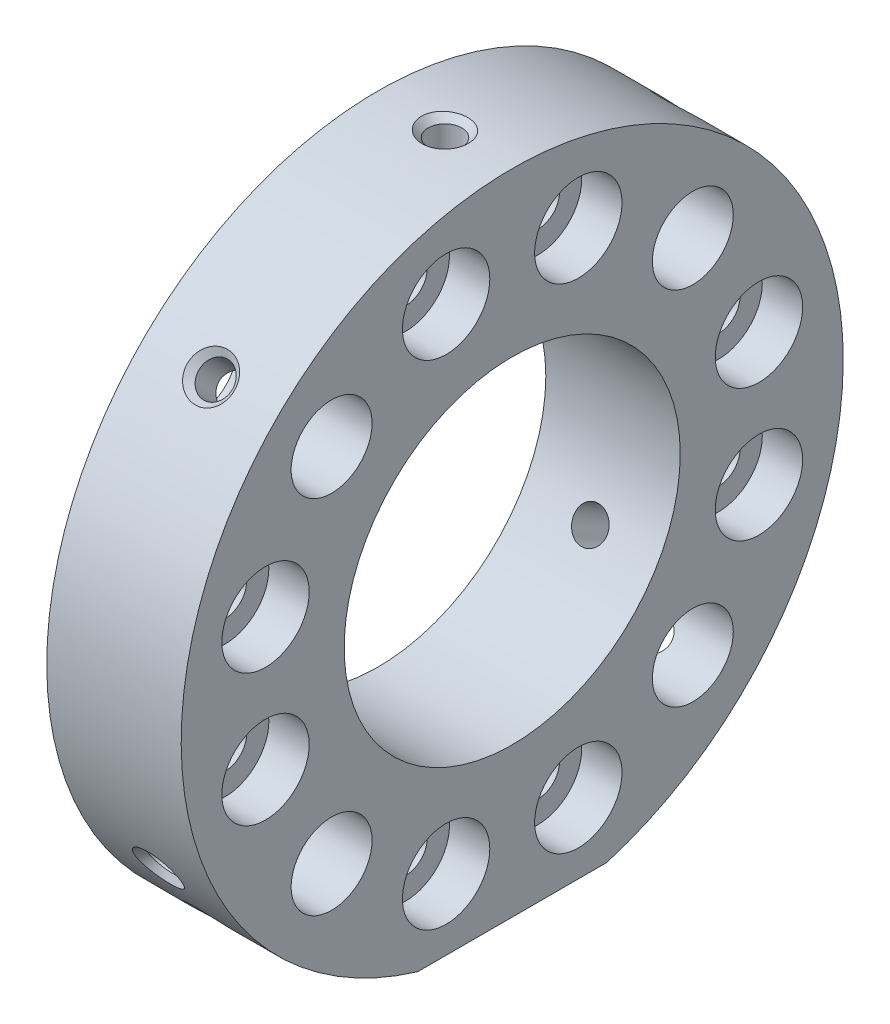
ISO-10303-21;
HEADER;
FILE_DESCRIPTION(('STEP AP214'),'2;1');
FILE_NAME('part.step','',(''),(''),'','','');
FILE_SCHEMA(('AUTOMOTIVE_DESIGN { 1 0 10303 214 1 1 1 1 }'));
ENDSEC;
DATA;
#1=APPLICATION_CONTEXT('core data for automotive mechanical design processes');
#2=APPLICATION_PROTOCOL_DEFINITION('international standard','automotive_design',2000,#1);
#3=PRODUCT_CONTEXT('',#1,'mechanical');
#4=PRODUCT('Part','Part','',(#3));
#5=PRODUCT_RELATED_PRODUCT_CATEGORY('part','',(#4));
#6=PRODUCT_DEFINITION_FORMATION('','',#4);
#7=PRODUCT_DEFINITION_CONTEXT('part definition',#1,'design');
#8=PRODUCT_DEFINITION('design','',#6,#7);
#9=PRODUCT_DEFINITION_SHAPE('','',#8);
#10=(LENGTH_UNIT() NAMED_UNIT(*) SI_UNIT(.MILLI.,.METRE.));
#11=(NAMED_UNIT(*) PLANE_ANGLE_UNIT() SI_UNIT($,.RADIAN.));
#12=(NAMED_UNIT(*) SI_UNIT($,.STERADIAN.) SOLID_ANGLE_UNIT());
#13=UNCERTAINTY_MEASURE_WITH_UNIT(LENGTH_MEASURE(1.E-05),#10,'distance_accuracy_value','');
#14=(GEOMETRIC_REPRESENTATION_CONTEXT(3) GLOBAL_UNCERTAINTY_ASSIGNED_CONTEXT((#13)) GLOBAL_UNIT_ASSIGNED_CONTEXT((#10,
#11,#12)) REPRESENTATION_CONTEXT('',''));
#15=CARTESIAN_POINT('',(0.,0.,0.));
#16=DIRECTION('',(0.,0.,1.));
#17=DIRECTION('',(1.,0.,0.));
#18=AXIS2_PLACEMENT_3D('',#15,#16,#17);
#19=CARTESIAN_POINT('',(5.,-23.6,0.));
#20=DIRECTION('',(0.,-1.,0.));
#21=DIRECTION('',(0.,0.,-1.));
#22=AXIS2_PLACEMENT_3D('',#19,#20,#21);
#23=CYLINDRICAL_SURFACE('',#22,2.5);
#24=CARTESIAN_POINT('',(5.,-23.6,0.));
#25=DIRECTION('',(0.,-1.,0.));
#26=DIRECTION('',(0.,0.,-1.));
#27=AXIS2_PLACEMENT_3D('',#24,#25,#26);
#28=CIRCLE('',#27,2.5);
#29=CARTESIAN_POINT('',(5.,-23.6,-2.5));
#30=VERTEX_POINT('',#29);
#31=EDGE_CURVE('E10',#30,#30,#28,.T.);
#32=ORIENTED_EDGE('',*,*,#31,.T.);
#33=EDGE_LOOP('',(#32));
#34=FACE_BOUND('',#33,.T.);
#35=CARTESIAN_POINT('',(5.,-16.6,0.));
#36=DIRECTION('',(0.,-1.,0.));
#37=DIRECTION('',(0.,0.,-1.));
#38=AXIS2_PLACEMENT_3D('',#35,#36,#37);
#39=CIRCLE('',#38,2.5);
#40=CARTESIAN_POINT('',(5.,-16.6,-2.5));
#41=VERTEX_POINT('',#40);
#42=EDGE_CURVE('E172',#41,#41,#39,.T.);
#43=ORIENTED_EDGE('',*,*,#42,.F.);
#44=EDGE_LOOP('',(#43));
#45=FACE_BOUND('',#44,.T.);
#46=ADVANCED_FACE('F15',(#34,#45),#23,.F.);
#47=CARTESIAN_POINT('',(5.,17.4125044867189,17.4125044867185));
#48=DIRECTION('',(0.,0.707106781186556,0.707106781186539));
#49=DIRECTION('',(0.,-0.707106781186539,0.707106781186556));
#50=AXIS2_PLACEMENT_3D('',#47,#48,#49);
#51=CYLINDRICAL_SURFACE('',#50,1.25);
#52=CARTESIAN_POINT('',(5.,17.0589510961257,17.0589510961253));
#53=DIRECTION('',(0.,0.707106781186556,0.707106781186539));
#54=DIRECTION('',(0.,-0.707106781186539,0.707106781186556));
#55=AXIS2_PLACEMENT_3D('',#52,#53,#54);
#56=CIRCLE('',#55,1.25);
#57=CARTESIAN_POINT('',(5.,16.1750676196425,17.9428345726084));
#58=VERTEX_POINT('',#57);
#59=EDGE_CURVE('E29',#58,#58,#56,.T.);
#60=ORIENTED_EDGE('',*,*,#59,.T.);
#61=EDGE_LOOP('',(#60));
#62=FACE_BOUND('',#61,.T.);
#63=CARTESIAN_POINT('',(5.,16.2550941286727,14.4873271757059));
#64=CARTESIAN_POINT('',(4.93323291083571,16.2550942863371,14.4873331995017));
#65=CARTESIAN_POINT('',(4.86640883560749,16.2530414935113,14.4928795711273));
#66=CARTESIAN_POINT('',(4.7347456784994,16.2447612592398,14.5146732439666));
#67=CARTESIAN_POINT('',(4.66990966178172,16.2385276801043,14.5309362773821));
#68=CARTESIAN_POINT('',(4.54427955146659,16.221725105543,14.5729787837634));
#69=CARTESIAN_POINT('',(4.48347186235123,16.2111716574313,14.5987240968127));
#70=CARTESIAN_POINT('',(4.36702175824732,16.1854520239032,14.6582705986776));
#71=CARTESIAN_POINT('',(4.31137975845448,16.1702854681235,14.6920724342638));
#72=CARTESIAN_POINT('',(4.20339946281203,16.1340142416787,14.7682397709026));
#73=CARTESIAN_POINT('',(4.15141983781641,16.1126249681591,14.8109784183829));
#74=CARTESIAN_POINT('',(4.05554116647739,16.0639438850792,14.9018489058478));
#75=CARTESIAN_POINT('',(4.01164462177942,16.0366502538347,14.949982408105));
#76=CARTESIAN_POINT('',(3.93134392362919,15.9746005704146,15.0519339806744));
#77=CARTESIAN_POINT('',(3.89534387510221,15.9395737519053,15.1059075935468));
#78=CARTESIAN_POINT('',(3.83459640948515,15.862905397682,15.2154713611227));
#79=CARTESIAN_POINT('',(3.80984417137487,15.821266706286,15.2710608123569));
#80=CARTESIAN_POINT('',(3.7735966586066,15.7343223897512,15.3787070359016));
#81=CARTESIAN_POINT('',(3.76148171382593,15.6893179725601,15.4307977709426));
#82=CARTESIAN_POINT('',(3.74885092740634,15.595049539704,15.5324577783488));
#83=CARTESIAN_POINT('',(3.74833042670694,15.5457872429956,15.5820280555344));
#84=CARTESIAN_POINT('',(3.75857740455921,15.4476714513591,15.674141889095));
#85=CARTESIAN_POINT('',(3.76866427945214,15.3989733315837,15.7169290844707));
#86=CARTESIAN_POINT('',(3.79867374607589,15.3007883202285,15.7978855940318));
#87=CARTESIAN_POINT('',(3.81859705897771,15.2513013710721,15.8360545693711));
#88=CARTESIAN_POINT('',(3.86795191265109,15.1524180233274,15.9077733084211));
#89=CARTESIAN_POINT('',(3.89752394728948,15.1030345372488,15.9412436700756));
#90=CARTESIAN_POINT('',(3.96519876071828,15.0067731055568,16.0027099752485));
#91=CARTESIAN_POINT('',(4.00330425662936,14.9598959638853,16.0307041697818));
#92=CARTESIAN_POINT('',(4.09006541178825,14.8670932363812,16.0831087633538));
#93=CARTESIAN_POINT('',(4.13927267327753,14.8214636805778,16.1071314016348));
#94=CARTESIAN_POINT('',(4.2453004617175,14.7367729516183,16.1493995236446));
#95=CARTESIAN_POINT('',(4.3021258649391,14.6977160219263,16.1676412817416));
#96=CARTESIAN_POINT('',(4.42412370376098,14.6269580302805,16.1992573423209));
#97=CARTESIAN_POINT('',(4.48951011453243,14.5955431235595,16.2124506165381));
#98=CARTESIAN_POINT('',(4.62528651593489,14.5438987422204,16.2334743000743));
#99=CARTESIAN_POINT('',(4.69566527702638,14.5236450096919,16.2413163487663));
#100=CARTESIAN_POINT('',(4.80563035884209,14.5023260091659,16.2494617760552));
#101=CARTESIAN_POINT('',(4.84425325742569,14.4967168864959,16.2515754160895));
#102=CARTESIAN_POINT('',(4.92191094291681,14.4892157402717,16.2543915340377));
#103=CARTESIAN_POINT('',(4.9609457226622,14.4873236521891,16.2550940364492));
#104=CARTESIAN_POINT('',(5.06676708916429,14.4873331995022,16.2550942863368));
#105=CARTESIAN_POINT('',(5.13359116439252,14.4928795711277,16.253041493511));
#106=CARTESIAN_POINT('',(5.2652543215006,14.514673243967,16.2447612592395));
#107=CARTESIAN_POINT('',(5.33009033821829,14.5309362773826,16.238527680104));
#108=CARTESIAN_POINT('',(5.45572044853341,14.5729787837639,16.2217251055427));
#109=CARTESIAN_POINT('',(5.51652813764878,14.5987240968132,16.2111716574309));
#110=CARTESIAN_POINT('',(5.63297824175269,14.658270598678,16.1854520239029));
#111=CARTESIAN_POINT('',(5.68862024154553,14.6920724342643,16.1702854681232));
#112=CARTESIAN_POINT('',(5.79660053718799,14.768239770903,16.1340142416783));
#113=CARTESIAN_POINT('',(5.84858016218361,14.8109784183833,16.1126249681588));
#114=CARTESIAN_POINT('',(5.94445883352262,14.9018489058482,16.0639438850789));
#115=CARTESIAN_POINT('',(5.98835537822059,14.9499824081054,16.0366502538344));
#116=CARTESIAN_POINT('',(6.06865607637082,15.0519339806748,15.9746005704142));
#117=CARTESIAN_POINT('',(6.1046561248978,15.1059075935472,15.939573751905));
#118=CARTESIAN_POINT('',(6.16540359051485,15.2154713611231,15.8629053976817));
#119=CARTESIAN_POINT('',(6.19015582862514,15.2710608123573,15.8212667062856));
#120=CARTESIAN_POINT('',(6.22640334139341,15.378707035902,15.7343223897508));
#121=CARTESIAN_POINT('',(6.23851828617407,15.430797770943,15.6893179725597));
#122=CARTESIAN_POINT('',(6.25114907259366,15.5324577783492,15.5950495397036));
#123=CARTESIAN_POINT('',(6.25166957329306,15.5820280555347,15.5457872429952));
#124=CARTESIAN_POINT('',(6.24142259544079,15.6741418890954,15.4476714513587));
#125=CARTESIAN_POINT('',(6.23133572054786,15.716929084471,15.3989733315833));
#126=CARTESIAN_POINT('',(6.20132625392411,15.7978855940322,15.3007883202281));
#127=CARTESIAN_POINT('',(6.18140294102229,15.8360545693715,15.2513013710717));
#128=CARTESIAN_POINT('',(6.13204808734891,15.9077733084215,15.152418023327));
#129=CARTESIAN_POINT('',(6.10247605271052,15.941243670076,15.1030345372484));
#130=CARTESIAN_POINT('',(6.03480123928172,16.0027099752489,15.0067731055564));
#131=CARTESIAN_POINT('',(5.99669574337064,16.0307041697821,14.9598959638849));
#132=CARTESIAN_POINT('',(5.90993458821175,16.0831087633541,14.8670932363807));
#133=CARTESIAN_POINT('',(5.86072732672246,16.1071314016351,14.8214636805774));
#134=CARTESIAN_POINT('',(5.7546995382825,16.1493995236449,14.7367729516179));
#135=CARTESIAN_POINT('',(5.69787413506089,16.167641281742,14.6977160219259));
#136=CARTESIAN_POINT('',(5.57587629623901,16.1992573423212,14.6269580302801));
#137=CARTESIAN_POINT('',(5.51048988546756,16.2124506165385,14.595543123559));
#138=CARTESIAN_POINT('',(5.3747134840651,16.2334743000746,14.54389874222));
#139=CARTESIAN_POINT('',(5.30433472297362,16.2413163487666,14.5236450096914));
#140=CARTESIAN_POINT('',(5.19436964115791,16.2494617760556,14.5023260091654));
#141=CARTESIAN_POINT('',(5.15574674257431,16.2515754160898,14.4967168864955));
#142=CARTESIAN_POINT('',(5.07808905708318,16.254391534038,14.4892157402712));
#143=CARTESIAN_POINT('',(5.0390542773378,16.2550940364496,14.4873236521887));
#144=CARTESIAN_POINT('',(5.,16.2550941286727,14.4873271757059));
#145=B_SPLINE_CURVE_WITH_KNOTS('',3,(#63,#64,#65,#66,#67,#68,#69,#70,#71,#72,#73,#74,#75,#76,
#77,#78,#79,#80,#81,#82,#83,#84,#85,#86,#87,#88,#89,#90,#91,#92,#93,#94,#95,#96,#97,#98,#99,
#100,#101,#102,#103,#104,#105,#106,#107,#108,#109,#110,#111,#112,#113,#114,#115,#116,#117,#118,
#119,#120,#121,#122,#123,#124,#125,#126,#127,#128,#129,#130,#131,#132,#133,#134,#135,#136,#137,
#138,#139,#140,#141,#142,#143,#144),.UNSPECIFIED.,.T.,.F.,(4,2,2,2,2,2,2,2,2,2,2,2,2,2,2,2,2,2,
2,2,2,2,2,2,2,2,2,2,2,2,2,2,2,2,2,2,2,2,2,2,4),(0.,0.20014684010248,0.40058815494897,
0.600314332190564,0.800056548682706,1.01096693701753,1.22194249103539,1.4420043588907,
1.66197181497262,1.87055779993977,2.07905996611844,2.27495543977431,2.47086527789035,
2.66976553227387,2.86872920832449,3.08161300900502,3.29463373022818,3.51470296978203,
3.7342920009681,3.85136653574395,3.96843903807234,4.16858587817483,4.36902719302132,
4.56875337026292,4.76849558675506,4.97940597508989,5.19038152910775,5.41044339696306,
5.63041085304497,5.83899683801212,6.04749900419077,6.24339447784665,6.43930431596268,
6.6382045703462,6.83716824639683,7.05005204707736,7.26307276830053,7.48314200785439,
7.70273103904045,7.81980557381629,7.93687807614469),.UNSPECIFIED.);
#146=CARTESIAN_POINT('',(5.,16.2550941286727,14.4873271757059));
#147=VERTEX_POINT('',#146);
#148=EDGE_CURVE('E19',#147,#147,#145,.T.);
#149=ORIENTED_EDGE('',*,*,#148,.F.);
#150=EDGE_LOOP('',(#149));
#151=FACE_BOUND('',#150,.T.);
#152=ADVANCED_FACE('F355',(#62,#151),#51,.F.);
#153=CARTESIAN_POINT('',(5.,17.4125044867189,17.4125044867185));
#154=DIRECTION('',(0.,0.707106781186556,0.707106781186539));
#155=DIRECTION('',(0.,-0.707106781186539,0.707106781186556));
#156=AXIS2_PLACEMENT_3D('',#153,#154,#155);
#157=CONICAL_SURFACE('',#156,1.75,0.785398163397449);
#158=CARTESIAN_POINT('',(5.,16.1750676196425,18.5676550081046));
#159=CARTESIAN_POINT('',(4.91642054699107,16.1750693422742,18.5676538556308));
#160=CARTESIAN_POINT('',(4.8327943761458,16.1794586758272,18.5638326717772));
#161=CARTESIAN_POINT('',(4.66707381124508,16.1969383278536,18.5485832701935));
#162=CARTESIAN_POINT('',(4.58498178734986,16.2100411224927,18.5371441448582));
#163=CARTESIAN_POINT('',(4.40715109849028,16.2483420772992,18.5035886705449));
#164=CARTESIAN_POINT('',(4.31214611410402,16.2754958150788,18.4797404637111));
#165=CARTESIAN_POINT('',(4.12966609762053,16.3413820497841,18.4215031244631));
#166=CARTESIAN_POINT('',(4.04219255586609,16.3801168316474,18.387111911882));
#167=CARTESIAN_POINT('',(3.87863896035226,16.4673669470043,18.309009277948));
#168=CARTESIAN_POINT('',(3.80241664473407,16.5157378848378,18.2654349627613));
#169=CARTESIAN_POINT('',(3.66239120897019,16.6210972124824,18.1696121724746));
#170=CARTESIAN_POINT('',(3.59858538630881,16.6780837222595,18.1173655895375));
#171=CARTESIAN_POINT('',(3.48724497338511,16.7970712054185,18.0070930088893));
#172=CARTESIAN_POINT('',(3.43928660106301,16.8588751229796,17.9492824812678));
#173=CARTESIAN_POINT('',(3.35880068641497,16.9869458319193,17.8281252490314));
#174=CARTESIAN_POINT('',(3.32626991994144,17.0532116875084,17.7647797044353));
#175=CARTESIAN_POINT('',(3.27863866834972,17.1858244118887,17.6365044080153));
#176=CARTESIAN_POINT('',(3.26299353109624,17.2520950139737,17.571697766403));
#177=CARTESIAN_POINT('',(3.24779277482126,17.3848104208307,17.4404041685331));
#178=CARTESIAN_POINT('',(3.24823491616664,17.4512552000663,17.3739174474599));
#179=CARTESIAN_POINT('',(3.26502275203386,17.5810822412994,17.2425213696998));
#180=CARTESIAN_POINT('',(3.28106092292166,17.64449887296,17.1776063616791));
#181=CARTESIAN_POINT('',(3.32803402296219,17.7678924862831,17.0499415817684));
#182=CARTESIAN_POINT('',(3.35896911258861,17.8278694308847,16.9871918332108));
#183=CARTESIAN_POINT('',(3.43493147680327,17.9432103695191,16.8653169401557));
#184=CARTESIAN_POINT('',(3.48003977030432,17.9985454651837,16.8062150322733));
#185=CARTESIAN_POINT('',(3.58285596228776,18.1029360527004,16.6937182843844));
#186=CARTESIAN_POINT('',(3.64056457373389,18.1519911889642,16.6403237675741));
#187=CARTESIAN_POINT('',(3.76855135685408,18.2440206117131,16.5393813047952));
#188=CARTESIAN_POINT('',(3.83912298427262,18.2867984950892,16.4920266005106));
#189=CARTESIAN_POINT('',(3.98970586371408,18.3638562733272,16.4061801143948));
#190=CARTESIAN_POINT('',(4.06972168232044,18.3981320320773,16.3676926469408));
#191=CARTESIAN_POINT('',(4.23977375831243,18.4585658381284,16.2995130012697));
#192=CARTESIAN_POINT('',(4.33005652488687,18.4844120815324,16.2701601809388));
#193=CARTESIAN_POINT('',(4.51571767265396,18.5258925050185,16.222913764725));
#194=CARTESIAN_POINT('',(4.61108899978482,18.5415404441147,16.2050047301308));
#195=CARTESIAN_POINT('',(4.75597930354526,18.5572012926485,16.1870613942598));
#196=CARTESIAN_POINT('',(4.80459352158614,18.5611197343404,16.1825669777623));
#197=CARTESIAN_POINT('',(4.90213322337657,18.5663465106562,16.1765700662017));
#198=CARTESIAN_POINT('',(4.95105860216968,18.5676556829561,16.1750666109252));
#199=CARTESIAN_POINT('',(5.08357945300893,18.5676538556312,16.1750693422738));
#200=CARTESIAN_POINT('',(5.1672056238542,18.5638326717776,16.1794586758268));
#201=CARTESIAN_POINT('',(5.33292618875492,18.5485832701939,16.1969383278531));
#202=CARTESIAN_POINT('',(5.41501821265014,18.5371441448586,16.2100411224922));
#203=CARTESIAN_POINT('',(5.59284890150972,18.5035886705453,16.2483420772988));
#204=CARTESIAN_POINT('',(5.68785388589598,18.4797404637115,16.2754958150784));
#205=CARTESIAN_POINT('',(5.87033390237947,18.4215031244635,16.3413820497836));
#206=CARTESIAN_POINT('',(5.95780744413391,18.3871119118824,16.380116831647));
#207=CARTESIAN_POINT('',(6.12136103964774,18.3090092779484,16.4673669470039));
#208=CARTESIAN_POINT('',(6.19758335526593,18.2654349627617,16.5157378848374));
#209=CARTESIAN_POINT('',(6.3376087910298,18.169612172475,16.621097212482));
#210=CARTESIAN_POINT('',(6.40141461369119,18.1173655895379,16.678083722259));
#211=CARTESIAN_POINT('',(6.51275502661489,18.0070930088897,16.797071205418));
#212=CARTESIAN_POINT('',(6.56071339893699,17.9492824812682,16.8588751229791));
#213=CARTESIAN_POINT('',(6.64119931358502,17.8281252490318,16.9869458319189));
#214=CARTESIAN_POINT('',(6.67373008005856,17.7647797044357,17.053211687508));
#215=CARTESIAN_POINT('',(6.72136133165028,17.6365044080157,17.1858244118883));
#216=CARTESIAN_POINT('',(6.73700646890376,17.5716977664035,17.2520950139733));
#217=CARTESIAN_POINT('',(6.75220722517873,17.4404041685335,17.3848104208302));
#218=CARTESIAN_POINT('',(6.75176508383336,17.3739174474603,17.4512552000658));
#219=CARTESIAN_POINT('',(6.73497724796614,17.2425213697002,17.581082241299));
#220=CARTESIAN_POINT('',(6.71893907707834,17.1776063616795,17.6444988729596));
#221=CARTESIAN_POINT('',(6.67196597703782,17.0499415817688,17.7678924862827));
#222=CARTESIAN_POINT('',(6.64103088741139,16.9871918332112,17.8278694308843));
#223=CARTESIAN_POINT('',(6.56506852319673,16.8653169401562,17.9432103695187));
#224=CARTESIAN_POINT('',(6.51996022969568,16.8062150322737,17.9985454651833));
#225=CARTESIAN_POINT('',(6.41714403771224,16.6937182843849,18.1029360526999));
#226=CARTESIAN_POINT('',(6.35943542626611,16.6403237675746,18.1519911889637));
#227=CARTESIAN_POINT('',(6.23144864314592,16.5393813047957,18.2440206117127));
#228=CARTESIAN_POINT('',(6.16087701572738,16.4920266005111,18.2867984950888));
#229=CARTESIAN_POINT('',(6.01029413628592,16.4061801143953,18.3638562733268));
#230=CARTESIAN_POINT('',(5.93027831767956,16.3676926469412,18.3981320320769));
#231=CARTESIAN_POINT('',(5.76022624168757,16.2995130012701,18.458565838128));
#232=CARTESIAN_POINT('',(5.66994347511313,16.2701601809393,18.484412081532));
#233=CARTESIAN_POINT('',(5.48428232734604,16.2229137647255,18.5258925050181));
#234=CARTESIAN_POINT('',(5.38891100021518,16.2050047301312,18.5415404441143));
#235=CARTESIAN_POINT('',(5.24402069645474,16.1870613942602,18.5572012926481));
#236=CARTESIAN_POINT('',(5.19540647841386,16.1825669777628,18.56111973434));
#237=CARTESIAN_POINT('',(5.09786677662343,16.1765700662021,18.5663465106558));
#238=CARTESIAN_POINT('',(5.04894139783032,16.1750666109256,18.5676556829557));
#239=CARTESIAN_POINT('',(5.,16.1750676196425,18.5676550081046));
#240=B_SPLINE_CURVE_WITH_KNOTS('',3,(#158,#159,#160,#161,#162,#163,#164,#165,#166,#167,#168,
#169,#170,#171,#172,#173,#174,#175,#176,#177,#178,#179,#180,#181,#182,#183,#184,#185,#186,#187,
#188,#189,#190,#191,#192,#193,#194,#195,#196,#197,#198,#199,#200,#201,#202,#203,#204,#205,#206,
#207,#208,#209,#210,#211,#212,#213,#214,#215,#216,#217,#218,#219,#220,#221,#222,#223,#224,#225,
#226,#227,#228,#229,#230,#231,#232,#233,#234,#235,#236,#237,#238,#239),.UNSPECIFIED.,.T.,.F.,(4,
2,2,2,2,2,2,2,2,2,2,2,2,2,2,2,2,2,2,2,2,2,2,2,2,2,2,2,2,2,2,2,2,2,2,2,2,2,2,2,4),(0.,
0.250612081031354,0.501583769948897,0.805008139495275,1.10849241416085,1.40773137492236,
1.70690513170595,1.99726981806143,2.28757379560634,2.56820500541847,2.84879714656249,
3.1239664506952,3.39913871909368,3.67591349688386,3.95270393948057,4.23685519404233,
4.5211444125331,4.81499537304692,5.10844906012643,5.25524644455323,5.40199669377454,
5.65260877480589,5.90358046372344,6.20700483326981,6.51048910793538,6.8097280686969,
7.10890182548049,7.39926651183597,7.68957048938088,7.97020169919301,8.25079384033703,
8.52596314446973,8.80113541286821,9.0779101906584,9.35470063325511,9.63885188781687,
9.92314110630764,10.2169920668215,10.510445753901,10.6572431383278,10.8039933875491),.UNSPECIFIED.);
#241=CARTESIAN_POINT('',(5.,16.1750676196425,18.5676550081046));
#242=VERTEX_POINT('',#241);
#243=EDGE_CURVE('E52',#242,#242,#240,.T.);
#244=ORIENTED_EDGE('',*,*,#243,.F.);
#245=EDGE_LOOP('',(#244));
#246=FACE_BOUND('',#245,.T.);
#247=ORIENTED_EDGE('',*,*,#59,.F.);
#248=EDGE_LOOP('',(#247));
#249=FACE_BOUND('',#248,.T.);
#250=ADVANCED_FACE('F98',(#246,#249),#157,.F.);
#251=CARTESIAN_POINT('',(5.,-17.4125044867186,17.4125044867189));
#252=DIRECTION('',(0.,-0.707106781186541,0.707106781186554));
#253=DIRECTION('',(0.,-0.707106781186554,-0.707106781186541));
#254=AXIS2_PLACEMENT_3D('',#251,#252,#253);
#255=CYLINDRICAL_SURFACE('',#254,1.25);
#256=CARTESIAN_POINT('',(5.,-17.0589510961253,17.0589510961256));
#257=DIRECTION('',(0.,-0.707106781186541,0.707106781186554));
#258=DIRECTION('',(0.,-0.707106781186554,-0.707106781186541));
#259=AXIS2_PLACEMENT_3D('',#256,#257,#258);
#260=CIRCLE('',#259,1.25);
#261=CARTESIAN_POINT('',(5.,-17.9428345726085,16.1750676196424));
#262=VERTEX_POINT('',#261);
#263=EDGE_CURVE('E182',#262,#262,#260,.T.);
#264=ORIENTED_EDGE('',*,*,#263,.T.);
#265=EDGE_LOOP('',(#264));
#266=FACE_BOUND('',#265,.T.);
#267=CARTESIAN_POINT('',(5.,-14.487327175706,16.2550941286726));
#268=CARTESIAN_POINT('',(4.93323291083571,-14.4873331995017,16.255094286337));
#269=CARTESIAN_POINT('',(4.86640883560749,-14.4928795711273,16.2530414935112));
#270=CARTESIAN_POINT('',(4.7347456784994,-14.5146732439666,16.2447612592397));
#271=CARTESIAN_POINT('',(4.66990966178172,-14.5309362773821,16.2385276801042));
#272=CARTESIAN_POINT('',(4.5442795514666,-14.5729787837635,16.2217251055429));
#273=CARTESIAN_POINT('',(4.48347186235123,-14.5987240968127,16.2111716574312));
#274=CARTESIAN_POINT('',(4.36702175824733,-14.6582705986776,16.1854520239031));
#275=CARTESIAN_POINT('',(4.31137975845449,-14.6920724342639,16.1702854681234));
#276=CARTESIAN_POINT('',(4.20339946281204,-14.7682397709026,16.1340142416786));
#277=CARTESIAN_POINT('',(4.15141983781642,-14.8109784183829,16.112624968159));
#278=CARTESIAN_POINT('',(4.0555411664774,-14.9018489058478,16.0639438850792));
#279=CARTESIAN_POINT('',(4.01164462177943,-14.949982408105,16.0366502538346));
#280=CARTESIAN_POINT('',(3.93134392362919,-15.0519339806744,15.9746005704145));
#281=CARTESIAN_POINT('',(3.89534387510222,-15.1059075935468,15.9395737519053));
#282=CARTESIAN_POINT('',(3.83459640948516,-15.2154713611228,15.862905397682));
#283=CARTESIAN_POINT('',(3.80984417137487,-15.2710608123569,15.8212667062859));
#284=CARTESIAN_POINT('',(3.7735966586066,-15.3787070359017,15.7343223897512));
#285=CARTESIAN_POINT('',(3.76148171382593,-15.4307977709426,15.68931797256));
#286=CARTESIAN_POINT('',(3.74885092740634,-15.5324577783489,15.595049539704));
#287=CARTESIAN_POINT('',(3.74833042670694,-15.5820280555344,15.5457872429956));
#288=CARTESIAN_POINT('',(3.75857740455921,-15.6741418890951,15.447671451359));
#289=CARTESIAN_POINT('',(3.76866427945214,-15.7169290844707,15.3989733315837));
#290=CARTESIAN_POINT('',(3.79867374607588,-15.7978855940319,15.3007883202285));
#291=CARTESIAN_POINT('',(3.81859705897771,-15.8360545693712,15.251301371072));
#292=CARTESIAN_POINT('',(3.86795191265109,-15.9077733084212,15.1524180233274));
#293=CARTESIAN_POINT('',(3.89752394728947,-15.9412436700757,15.1030345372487));
#294=CARTESIAN_POINT('',(3.96519876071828,-16.0027099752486,15.0067731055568));
#295=CARTESIAN_POINT('',(4.00330425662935,-16.0307041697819,14.9598959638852));
#296=CARTESIAN_POINT('',(4.09006541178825,-16.0831087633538,14.8670932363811));
#297=CARTESIAN_POINT('',(4.13927267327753,-16.1071314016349,14.8214636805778));
#298=CARTESIAN_POINT('',(4.24530046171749,-16.1493995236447,14.7367729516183));
#299=CARTESIAN_POINT('',(4.3021258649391,-16.1676412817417,14.6977160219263));
#300=CARTESIAN_POINT('',(4.42412370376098,-16.199257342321,14.6269580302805));
#301=CARTESIAN_POINT('',(4.48951011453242,-16.2124506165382,14.5955431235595));
#302=CARTESIAN_POINT('',(4.62528651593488,-16.2334743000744,14.5438987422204));
#303=CARTESIAN_POINT('',(4.69566527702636,-16.2413163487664,14.5236450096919));
#304=CARTESIAN_POINT('',(4.80563035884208,-16.2494617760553,14.5023260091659));
#305=CARTESIAN_POINT('',(4.84425325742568,-16.2515754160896,14.4967168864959));
#306=CARTESIAN_POINT('',(4.92191094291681,-16.2543915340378,14.4892157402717));
#307=CARTESIAN_POINT('',(4.9609457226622,-16.2550940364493,14.4873236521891));
#308=CARTESIAN_POINT('',(5.06676708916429,-16.2550942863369,14.4873331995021));
#309=CARTESIAN_POINT('',(5.13359116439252,-16.2530414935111,14.4928795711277));
#310=CARTESIAN_POINT('',(5.26525432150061,-16.2447612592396,14.514673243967));
#311=CARTESIAN_POINT('',(5.33009033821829,-16.2385276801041,14.5309362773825));
#312=CARTESIAN_POINT('',(5.45572044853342,-16.2217251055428,14.5729787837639));
#313=CARTESIAN_POINT('',(5.51652813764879,-16.211171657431,14.5987240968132));
#314=CARTESIAN_POINT('',(5.63297824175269,-16.1854520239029,14.658270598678));
#315=CARTESIAN_POINT('',(5.68862024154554,-16.1702854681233,14.6920724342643));
#316=CARTESIAN_POINT('',(5.796600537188,-16.1340142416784,14.768239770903));
#317=CARTESIAN_POINT('',(5.84858016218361,-16.1126249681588,14.8109784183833));
#318=CARTESIAN_POINT('',(5.94445883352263,-16.063943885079,14.9018489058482));
#319=CARTESIAN_POINT('',(5.9883553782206,-16.0366502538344,14.9499824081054));
#320=CARTESIAN_POINT('',(6.06865607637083,-15.9746005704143,15.0519339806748));
#321=CARTESIAN_POINT('',(6.10465612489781,-15.939573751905,15.1059075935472));
#322=CARTESIAN_POINT('',(6.16540359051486,-15.8629053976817,15.2154713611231));
#323=CARTESIAN_POINT('',(6.19015582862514,-15.8212667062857,15.2710608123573));
#324=CARTESIAN_POINT('',(6.22640334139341,-15.7343223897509,15.378707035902));
#325=CARTESIAN_POINT('',(6.23851828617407,-15.6893179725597,15.430797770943));
#326=CARTESIAN_POINT('',(6.25114907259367,-15.5950495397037,15.5324577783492));
#327=CARTESIAN_POINT('',(6.25166957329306,-15.5457872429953,15.5820280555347));
#328=CARTESIAN_POINT('',(6.24142259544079,-15.4476714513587,15.6741418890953));
#329=CARTESIAN_POINT('',(6.23133572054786,-15.3989733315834,15.716929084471));
#330=CARTESIAN_POINT('',(6.20132625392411,-15.3007883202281,15.7978855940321));
#331=CARTESIAN_POINT('',(6.18140294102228,-15.2513013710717,15.8360545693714));
#332=CARTESIAN_POINT('',(6.1320480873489,-15.1524180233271,15.9077733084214));
#333=CARTESIAN_POINT('',(6.10247605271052,-15.1030345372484,15.9412436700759));
#334=CARTESIAN_POINT('',(6.03480123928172,-15.0067731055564,16.0027099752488));
#335=CARTESIAN_POINT('',(5.99669574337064,-14.9598959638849,16.030704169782));
#336=CARTESIAN_POINT('',(5.90993458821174,-14.8670932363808,16.083108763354));
#337=CARTESIAN_POINT('',(5.86072732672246,-14.8214636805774,16.107131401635));
#338=CARTESIAN_POINT('',(5.75469953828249,-14.7367729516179,16.1493995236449));
#339=CARTESIAN_POINT('',(5.69787413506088,-14.6977160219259,16.1676412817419));
#340=CARTESIAN_POINT('',(5.575876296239,-14.6269580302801,16.1992573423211));
#341=CARTESIAN_POINT('',(5.51048988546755,-14.5955431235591,16.2124506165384));
#342=CARTESIAN_POINT('',(5.37471348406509,-14.54389874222,16.2334743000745));
#343=CARTESIAN_POINT('',(5.3043347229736,-14.5236450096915,16.2413163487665));
#344=CARTESIAN_POINT('',(5.1943696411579,-14.5023260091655,16.2494617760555));
#345=CARTESIAN_POINT('',(5.1557467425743,-14.4967168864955,16.2515754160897));
#346=CARTESIAN_POINT('',(5.07808905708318,-14.4892157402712,16.2543915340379));
#347=CARTESIAN_POINT('',(5.0390542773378,-14.4873236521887,16.2550940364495));
#348=CARTESIAN_POINT('',(5.,-14.487327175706,16.2550941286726));
#349=B_SPLINE_CURVE_WITH_KNOTS('',3,(#267,#268,#269,#270,#271,#272,#273,#274,#275,#276,#277,
#278,#279,#280,#281,#282,#283,#284,#285,#286,#287,#288,#289,#290,#291,#292,#293,#294,#295,#296,
#297,#298,#299,#300,#301,#302,#303,#304,#305,#306,#307,#308,#309,#310,#311,#312,#313,#314,#315,
#316,#317,#318,#319,#320,#321,#322,#323,#324,#325,#326,#327,#328,#329,#330,#331,#332,#333,#334,
#335,#336,#337,#338,#339,#340,#341,#342,#343,#344,#345,#346,#347,#348),.UNSPECIFIED.,.T.,.F.,(4,
2,2,2,2,2,2,2,2,2,2,2,2,2,2,2,2,2,2,2,2,2,2,2,2,2,2,2,2,2,2,2,2,2,2,2,2,2,2,2,4),(0.,
0.200146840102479,0.400588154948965,0.600314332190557,0.800056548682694,1.01096693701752,
1.22194249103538,1.44200435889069,1.66197181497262,1.87055779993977,2.07905996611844,
2.27495543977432,2.47086527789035,2.66976553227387,2.86872920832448,3.08161300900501,
3.29463373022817,3.51470296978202,3.73429200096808,3.85136653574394,3.96843903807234,
4.16858587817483,4.36902719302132,4.56875337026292,4.76849558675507,4.9794059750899,
5.19038152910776,5.41044339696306,5.63041085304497,5.83899683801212,6.04749900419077,
6.24339447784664,6.43930431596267,6.6382045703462,6.83716824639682,7.05005204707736,
7.26307276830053,7.48314200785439,7.70273103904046,7.8198055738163,7.93687807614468),.UNSPECIFIED.);
#350=CARTESIAN_POINT('',(5.,-14.487327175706,16.2550941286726));
#351=VERTEX_POINT('',#350);
#352=EDGE_CURVE('E75',#351,#351,#349,.T.);
#353=ORIENTED_EDGE('',*,*,#352,.F.);
#354=EDGE_LOOP('',(#353));
#355=FACE_BOUND('',#354,.T.);
#356=ADVANCED_FACE('F92',(#266,#355),#255,.F.);
#357=CARTESIAN_POINT('',(5.,-17.4125044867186,17.4125044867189));
#358=DIRECTION('',(0.,-0.707106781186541,0.707106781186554));
#359=DIRECTION('',(0.,-0.707106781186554,-0.707106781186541));
#360=AXIS2_PLACEMENT_3D('',#357,#358,#359);
#361=CONICAL_SURFACE('',#360,1.75,0.785398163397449);
#362=CARTESIAN_POINT('',(5.00000000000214,-18.5676550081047,16.1750676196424));
#363=CARTESIAN_POINT('',(4.91642054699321,-18.5676538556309,16.1750693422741));
#364=CARTESIAN_POINT('',(4.83279437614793,-18.5638326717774,16.179458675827));
#365=CARTESIAN_POINT('',(4.66707381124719,-18.5485832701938,16.1969383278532));
#366=CARTESIAN_POINT('',(4.58498178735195,-18.5371441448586,16.2100411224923));
#367=CARTESIAN_POINT('',(4.4071510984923,-18.5035886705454,16.2483420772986));
#368=CARTESIAN_POINT('',(4.312146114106,-18.4797404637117,16.2754958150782));
#369=CARTESIAN_POINT('',(4.1296660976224,-18.4215031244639,16.3413820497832));
#370=CARTESIAN_POINT('',(4.04219255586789,-18.3871119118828,16.3801168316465));
#371=CARTESIAN_POINT('',(3.87863896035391,-18.309009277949,16.4673669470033));
#372=CARTESIAN_POINT('',(3.80241664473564,-18.2654349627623,16.5157378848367));
#373=CARTESIAN_POINT('',(3.66239120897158,-18.1696121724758,16.6210972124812));
#374=CARTESIAN_POINT('',(3.59858538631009,-18.1173655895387,16.6780837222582));
#375=CARTESIAN_POINT('',(3.48724497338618,-18.0070930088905,16.7970712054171));
#376=CARTESIAN_POINT('',(3.43928660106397,-17.9492824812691,16.8588751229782));
#377=CARTESIAN_POINT('',(3.35880068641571,-17.8281252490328,16.9869458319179));
#378=CARTESIAN_POINT('',(3.32626991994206,-17.7647797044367,17.053211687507));
#379=CARTESIAN_POINT('',(3.27863866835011,-17.6365044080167,17.1858244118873));
#380=CARTESIAN_POINT('',(3.26299353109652,-17.5716977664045,17.2520950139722));
#381=CARTESIAN_POINT('',(3.24779277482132,-17.4404041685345,17.3848104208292));
#382=CARTESIAN_POINT('',(3.24823491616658,-17.3739174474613,17.4512552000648));
#383=CARTESIAN_POINT('',(3.26502275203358,-17.2425213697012,17.581082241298));
#384=CARTESIAN_POINT('',(3.28106092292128,-17.1776063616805,17.6444988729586));
#385=CARTESIAN_POINT('',(3.32803402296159,-17.0499415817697,17.7678924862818));
#386=CARTESIAN_POINT('',(3.35896911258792,-16.9871918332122,17.8278694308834));
#387=CARTESIAN_POINT('',(3.43493147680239,-16.8653169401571,17.9432103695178));
#388=CARTESIAN_POINT('',(3.48003977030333,-16.8062150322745,17.9985454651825));
#389=CARTESIAN_POINT('',(3.58285596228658,-16.6937182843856,18.1029360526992));
#390=CARTESIAN_POINT('',(3.64056457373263,-16.6403237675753,18.1519911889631));
#391=CARTESIAN_POINT('',(3.76855135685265,-16.5393813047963,18.2440206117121));
#392=CARTESIAN_POINT('',(3.83912298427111,-16.4920266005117,18.2867984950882));
#393=CARTESIAN_POINT('',(3.98970586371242,-16.4061801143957,18.3638562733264));
#394=CARTESIAN_POINT('',(4.06972168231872,-16.3676926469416,18.3981320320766));
#395=CARTESIAN_POINT('',(4.23977375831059,-16.2995130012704,18.4585658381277));
#396=CARTESIAN_POINT('',(4.33005652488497,-16.2701601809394,18.4844120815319));
#397=CARTESIAN_POINT('',(4.51571767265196,-16.2229137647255,18.525892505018));
#398=CARTESIAN_POINT('',(4.61108899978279,-16.2050047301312,18.5415404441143));
#399=CARTESIAN_POINT('',(4.75597930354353,-16.18706139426,18.5572012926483));
#400=CARTESIAN_POINT('',(4.80459352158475,-16.1825669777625,18.5611197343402));
#401=CARTESIAN_POINT('',(4.90213322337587,-16.1765700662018,18.5663465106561));
#402=CARTESIAN_POINT('',(4.95105860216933,-16.1750666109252,18.567655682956));
#403=CARTESIAN_POINT('',(5.08357945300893,-16.1750693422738,18.5676538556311));
#404=CARTESIAN_POINT('',(5.1672056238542,-16.1794586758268,18.5638326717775));
#405=CARTESIAN_POINT('',(5.33292618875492,-16.1969383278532,18.5485832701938));
#406=CARTESIAN_POINT('',(5.41501821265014,-16.2100411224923,18.5371441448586));
#407=CARTESIAN_POINT('',(5.59284890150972,-16.2483420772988,18.5035886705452));
#408=CARTESIAN_POINT('',(5.68785388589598,-16.2754958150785,18.4797404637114));
#409=CARTESIAN_POINT('',(5.87033390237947,-16.3413820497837,18.4215031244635));
#410=CARTESIAN_POINT('',(5.95780744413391,-16.3801168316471,18.3871119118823));
#411=CARTESIAN_POINT('',(6.12136103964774,-16.4673669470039,18.3090092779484));
#412=CARTESIAN_POINT('',(6.19758335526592,-16.5157378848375,18.2654349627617));
#413=CARTESIAN_POINT('',(6.3376087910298,-16.621097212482,18.169612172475));
#414=CARTESIAN_POINT('',(6.40141461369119,-16.6780837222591,18.1173655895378));
#415=CARTESIAN_POINT('',(6.51275502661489,-16.7970712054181,18.0070930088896));
#416=CARTESIAN_POINT('',(6.56071339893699,-16.8588751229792,17.9492824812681));
#417=CARTESIAN_POINT('',(6.64119931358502,-16.9869458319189,17.8281252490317));
#418=CARTESIAN_POINT('',(6.67373008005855,-17.053211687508,17.7647797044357));
#419=CARTESIAN_POINT('',(6.72136133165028,-17.1858244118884,17.6365044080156));
#420=CARTESIAN_POINT('',(6.73700646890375,-17.2520950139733,17.5716977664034));
#421=CARTESIAN_POINT('',(6.75220722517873,-17.3848104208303,17.4404041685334));
#422=CARTESIAN_POINT('',(6.75176508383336,-17.4512552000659,17.3739174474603));
#423=CARTESIAN_POINT('',(6.73497724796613,-17.581082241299,17.2425213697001));
#424=CARTESIAN_POINT('',(6.71893907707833,-17.6444988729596,17.1776063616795));
#425=CARTESIAN_POINT('',(6.67196597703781,-17.7678924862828,17.0499415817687));
#426=CARTESIAN_POINT('',(6.64103088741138,-17.8278694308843,16.9871918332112));
#427=CARTESIAN_POINT('',(6.56506852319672,-17.9432103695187,16.8653169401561));
#428=CARTESIAN_POINT('',(6.51996022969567,-17.9985454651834,16.8062150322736));
#429=CARTESIAN_POINT('',(6.41714403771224,-18.1029360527,16.6937182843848));
#430=CARTESIAN_POINT('',(6.35943542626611,-18.1519911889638,16.6403237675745));
#431=CARTESIAN_POINT('',(6.23144864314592,-18.2440206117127,16.5393813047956));
#432=CARTESIAN_POINT('',(6.16087701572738,-18.2867984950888,16.492026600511));
#433=CARTESIAN_POINT('',(6.01029413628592,-18.3638562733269,16.4061801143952));
#434=CARTESIAN_POINT('',(5.93027831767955,-18.398132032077,16.3676926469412));
#435=CARTESIAN_POINT('',(5.76022624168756,-18.458565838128,16.2995130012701));
#436=CARTESIAN_POINT('',(5.66994347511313,-18.4844120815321,16.2701601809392));
#437=CARTESIAN_POINT('',(5.48428232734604,-18.5258925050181,16.2229137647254));
#438=CARTESIAN_POINT('',(5.38891100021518,-18.5415404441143,16.2050047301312));
#439=CARTESIAN_POINT('',(5.24402069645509,-18.5572012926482,16.1870613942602));
#440=CARTESIAN_POINT('',(5.19540647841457,-18.56111973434,16.1825669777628));
#441=CARTESIAN_POINT('',(5.09786677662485,-18.5663465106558,16.1765700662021));
#442=CARTESIAN_POINT('',(5.0489413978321,-18.5676556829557,16.1750666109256));
#443=CARTESIAN_POINT('',(5.00000000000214,-18.5676550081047,16.1750676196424));
#444=B_SPLINE_CURVE_WITH_KNOTS('',3,(#362,#363,#364,#365,#366,#367,#368,#369,#370,#371,#372,
#373,#374,#375,#376,#377,#378,#379,#380,#381,#382,#383,#384,#385,#386,#387,#388,#389,#390,#391,
#392,#393,#394,#395,#396,#397,#398,#399,#400,#401,#402,#403,#404,#405,#406,#407,#408,#409,#410,
#411,#412,#413,#414,#415,#416,#417,#418,#419,#420,#421,#422,#423,#424,#425,#426,#427,#428,#429,
#430,#431,#432,#433,#434,#435,#436,#437,#438,#439,#440,#441,#442,#443),.UNSPECIFIED.,.T.,.F.,(4,
2,2,2,2,2,2,2,2,2,2,2,2,2,2,2,2,2,2,2,2,2,2,2,2,2,2,2,2,2,2,2,2,2,2,2,2,2,2,2,4),(0.,
0.250612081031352,0.501583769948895,0.80500813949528,1.10849241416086,1.40773137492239,
1.70690513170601,1.99726981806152,2.28757379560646,2.56820500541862,2.84879714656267,
3.12396645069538,3.39913871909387,3.67591349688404,3.95270393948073,4.23685519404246,
4.52114441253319,4.81499537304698,5.10844906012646,5.25524644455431,5.40199669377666,
5.65260877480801,5.90358046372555,6.20700483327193,6.5104891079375,6.80972806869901,
7.1089018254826,7.39926651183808,7.68957048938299,7.97020169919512,8.25079384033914,
8.52596314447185,8.80113541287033,9.07791019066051,9.35470063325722,9.63885188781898,
9.92314110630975,10.2169920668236,10.5104457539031,10.6572431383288,10.803993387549),.UNSPECIFIED.);
#445=CARTESIAN_POINT('',(5.00000000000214,-18.5676550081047,16.1750676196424));
#446=VERTEX_POINT('',#445);
#447=EDGE_CURVE('E108',#446,#446,#444,.T.);
#448=ORIENTED_EDGE('',*,*,#447,.F.);
#449=EDGE_LOOP('',(#448));
#450=FACE_BOUND('',#449,.T.);
#451=ORIENTED_EDGE('',*,*,#263,.F.);
#452=EDGE_LOOP('',(#451));
#453=FACE_BOUND('',#452,.T.);
#454=ADVANCED_FACE('F97',(#450,#453),#361,.F.);
#455=CARTESIAN_POINT('',(5.,-17.4125044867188,-17.4125044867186));
#456=DIRECTION('',(0.,-0.707106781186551,-0.707106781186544));
#457=DIRECTION('',(0.,0.707106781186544,-0.707106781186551));
#458=AXIS2_PLACEMENT_3D('',#455,#456,#457);
#459=CYLINDRICAL_SURFACE('',#458,1.25);
#460=CARTESIAN_POINT('',(5.,-17.0589510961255,-17.0589510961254));
#461=DIRECTION('',(0.,-0.707106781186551,-0.707106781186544));
#462=DIRECTION('',(0.,0.707106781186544,-0.707106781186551));
#463=AXIS2_PLACEMENT_3D('',#460,#461,#462);
#464=CIRCLE('',#463,1.25);
#465=CARTESIAN_POINT('',(5.,-16.1750676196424,-17.9428345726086));
#466=VERTEX_POINT('',#465);
#467=EDGE_CURVE('E185',#466,#466,#464,.T.);
#468=ORIENTED_EDGE('',*,*,#467,.T.);
#469=EDGE_LOOP('',(#468));
#470=FACE_BOUND('',#469,.T.);
#471=CARTESIAN_POINT('',(5.,-16.2550941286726,-14.4873271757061));
#472=CARTESIAN_POINT('',(4.93323291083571,-16.255094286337,-14.4873331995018));
#473=CARTESIAN_POINT('',(4.86640883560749,-16.2530414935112,-14.4928795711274));
#474=CARTESIAN_POINT('',(4.7347456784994,-16.2447612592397,-14.5146732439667));
#475=CARTESIAN_POINT('',(4.66990966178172,-16.2385276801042,-14.5309362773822));
#476=CARTESIAN_POINT('',(4.54427955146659,-16.2217251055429,-14.5729787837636));
#477=CARTESIAN_POINT('',(4.48347186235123,-16.2111716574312,-14.5987240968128));
#478=CARTESIAN_POINT('',(4.36702175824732,-16.1854520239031,-14.6582705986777));
#479=CARTESIAN_POINT('',(4.31137975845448,-16.1702854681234,-14.692072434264));
#480=CARTESIAN_POINT('',(4.20339946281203,-16.1340142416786,-14.7682397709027));
#481=CARTESIAN_POINT('',(4.15141983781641,-16.112624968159,-14.810978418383));
#482=CARTESIAN_POINT('',(4.05554116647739,-16.0639438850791,-14.9018489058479));
#483=CARTESIAN_POINT('',(4.01164462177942,-16.0366502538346,-14.9499824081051));
#484=CARTESIAN_POINT('',(3.93134392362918,-15.9746005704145,-15.0519339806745));
#485=CARTESIAN_POINT('',(3.89534387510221,-15.9395737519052,-15.1059075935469));
#486=CARTESIAN_POINT('',(3.83459640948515,-15.8629053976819,-15.2154713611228));
#487=CARTESIAN_POINT('',(3.80984417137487,-15.8212667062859,-15.271060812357));
#488=CARTESIAN_POINT('',(3.7735966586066,-15.7343223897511,-15.3787070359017));
#489=CARTESIAN_POINT('',(3.76148171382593,-15.6893179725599,-15.4307977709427));
#490=CARTESIAN_POINT('',(3.74885092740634,-15.5950495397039,-15.5324577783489));
#491=CARTESIAN_POINT('',(3.74833042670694,-15.5457872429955,-15.5820280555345));
#492=CARTESIAN_POINT('',(3.75857740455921,-15.4476714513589,-15.6741418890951));
#493=CARTESIAN_POINT('',(3.76866427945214,-15.3989733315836,-15.7169290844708));
#494=CARTESIAN_POINT('',(3.79867374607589,-15.3007883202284,-15.7978855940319));
#495=CARTESIAN_POINT('',(3.81859705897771,-15.2513013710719,-15.8360545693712));
#496=CARTESIAN_POINT('',(3.86795191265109,-15.1524180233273,-15.9077733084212));
#497=CARTESIAN_POINT('',(3.89752394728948,-15.1030345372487,-15.9412436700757));
#498=CARTESIAN_POINT('',(3.96519876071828,-15.0067731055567,-16.0027099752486));
#499=CARTESIAN_POINT('',(4.00330425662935,-14.9598959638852,-16.0307041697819));
#500=CARTESIAN_POINT('',(4.09006541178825,-14.867093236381,-16.0831087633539));
#501=CARTESIAN_POINT('',(4.13927267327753,-14.8214636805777,-16.1071314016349));
#502=CARTESIAN_POINT('',(4.2453004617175,-14.7367729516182,-16.1493995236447));
#503=CARTESIAN_POINT('',(4.3021258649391,-14.6977160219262,-16.1676412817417));
#504=CARTESIAN_POINT('',(4.42412370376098,-14.6269580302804,-16.199257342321));
#505=CARTESIAN_POINT('',(4.48951011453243,-14.5955431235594,-16.2124506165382));
#506=CARTESIAN_POINT('',(4.62528651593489,-14.5438987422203,-16.2334743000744));
#507=CARTESIAN_POINT('',(4.69566527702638,-14.5236450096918,-16.2413163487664));
#508=CARTESIAN_POINT('',(4.80563035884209,-14.5023260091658,-16.2494617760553));
#509=CARTESIAN_POINT('',(4.84425325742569,-14.4967168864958,-16.2515754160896));
#510=CARTESIAN_POINT('',(4.92191094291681,-14.4892157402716,-16.2543915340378));
#511=CARTESIAN_POINT('',(4.9609457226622,-14.487323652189,-16.2550940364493));
#512=CARTESIAN_POINT('',(5.06676708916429,-14.487333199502,-16.2550942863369));
#513=CARTESIAN_POINT('',(5.13359116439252,-14.4928795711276,-16.2530414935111));
#514=CARTESIAN_POINT('',(5.2652543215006,-14.5146732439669,-16.2447612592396));
#515=CARTESIAN_POINT('',(5.33009033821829,-14.5309362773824,-16.2385276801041));
#516=CARTESIAN_POINT('',(5.45572044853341,-14.5729787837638,-16.2217251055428));
#517=CARTESIAN_POINT('',(5.51652813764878,-14.5987240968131,-16.2111716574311));
#518=CARTESIAN_POINT('',(5.63297824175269,-14.6582705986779,-16.185452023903));
#519=CARTESIAN_POINT('',(5.68862024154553,-14.6920724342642,-16.1702854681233));
#520=CARTESIAN_POINT('',(5.79660053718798,-14.7682397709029,-16.1340142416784));
#521=CARTESIAN_POINT('',(5.8485801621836,-14.8109784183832,-16.1126249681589));
#522=CARTESIAN_POINT('',(5.94445883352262,-14.9018489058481,-16.063943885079));
#523=CARTESIAN_POINT('',(5.98835537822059,-14.9499824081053,-16.0366502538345));
#524=CARTESIAN_POINT('',(6.06865607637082,-15.0519339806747,-15.9746005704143));
#525=CARTESIAN_POINT('',(6.1046561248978,-15.1059075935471,-15.9395737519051));
#526=CARTESIAN_POINT('',(6.16540359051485,-15.215471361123,-15.8629053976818));
#527=CARTESIAN_POINT('',(6.19015582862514,-15.2710608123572,-15.8212667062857));
#528=CARTESIAN_POINT('',(6.22640334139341,-15.3787070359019,-15.734322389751));
#529=CARTESIAN_POINT('',(6.23851828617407,-15.4307977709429,-15.6893179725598));
#530=CARTESIAN_POINT('',(6.25114907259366,-15.5324577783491,-15.5950495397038));
#531=CARTESIAN_POINT('',(6.25166957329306,-15.5820280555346,-15.5457872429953));
#532=CARTESIAN_POINT('',(6.24142259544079,-15.6741418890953,-15.4476714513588));
#533=CARTESIAN_POINT('',(6.23133572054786,-15.7169290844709,-15.3989733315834));
#534=CARTESIAN_POINT('',(6.20132625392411,-15.7978855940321,-15.3007883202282));
#535=CARTESIAN_POINT('',(6.18140294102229,-15.8360545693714,-15.2513013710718));
#536=CARTESIAN_POINT('',(6.13204808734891,-15.9077733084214,-15.1524180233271));
#537=CARTESIAN_POINT('',(6.10247605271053,-15.9412436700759,-15.1030345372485));
#538=CARTESIAN_POINT('',(6.03480123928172,-16.0027099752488,-15.0067731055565));
#539=CARTESIAN_POINT('',(5.99669574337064,-16.030704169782,-14.959895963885));
#540=CARTESIAN_POINT('',(5.90993458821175,-16.083108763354,-14.8670932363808));
#541=CARTESIAN_POINT('',(5.86072732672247,-16.107131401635,-14.8214636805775));
#542=CARTESIAN_POINT('',(5.7546995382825,-16.1493995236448,-14.736772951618));
#543=CARTESIAN_POINT('',(5.69787413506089,-16.1676412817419,-14.697716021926));
#544=CARTESIAN_POINT('',(5.57587629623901,-16.1992573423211,-14.6269580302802));
#545=CARTESIAN_POINT('',(5.51048988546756,-16.2124506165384,-14.5955431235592));
#546=CARTESIAN_POINT('',(5.3747134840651,-16.2334743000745,-14.5438987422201));
#547=CARTESIAN_POINT('',(5.30433472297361,-16.2413163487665,-14.5236450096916));
#548=CARTESIAN_POINT('',(5.19436964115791,-16.2494617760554,-14.5023260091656));
#549=CARTESIAN_POINT('',(5.15574674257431,-16.2515754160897,-14.4967168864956));
#550=CARTESIAN_POINT('',(5.07808905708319,-16.2543915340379,-14.4892157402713));
#551=CARTESIAN_POINT('',(5.0390542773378,-16.2550940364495,-14.4873236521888));
#552=CARTESIAN_POINT('',(5.,-16.2550941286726,-14.4873271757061));
#553=B_SPLINE_CURVE_WITH_KNOTS('',3,(#471,#472,#473,#474,#475,#476,#477,#478,#479,#480,#481,
#482,#483,#484,#485,#486,#487,#488,#489,#490,#491,#492,#493,#494,#495,#496,#497,#498,#499,#500,
#501,#502,#503,#504,#505,#506,#507,#508,#509,#510,#511,#512,#513,#514,#515,#516,#517,#518,#519,
#520,#521,#522,#523,#524,#525,#526,#527,#528,#529,#530,#531,#532,#533,#534,#535,#536,#537,#538,
#539,#540,#541,#542,#543,#544,#545,#546,#547,#548,#549,#550,#551,#552),.UNSPECIFIED.,.T.,.F.,(4,
2,2,2,2,2,2,2,2,2,2,2,2,2,2,2,2,2,2,2,2,2,2,2,2,2,2,2,2,2,2,2,2,2,2,2,2,2,2,2,4),(0.,
0.20014684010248,0.40058815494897,0.600314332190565,0.800056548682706,1.01096693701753,
1.2219424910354,1.4420043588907,1.66197181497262,1.87055779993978,2.07905996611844,
2.27495543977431,2.47086527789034,2.66976553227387,2.86872920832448,3.08161300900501,
3.29463373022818,3.51470296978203,3.73429200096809,3.85136653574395,3.96843903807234,
4.16858587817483,4.36902719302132,4.56875337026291,4.76849558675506,4.97940597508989,
5.19038152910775,5.41044339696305,5.63041085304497,5.83899683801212,6.04749900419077,
6.24339447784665,6.43930431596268,6.6382045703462,6.83716824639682,7.05005204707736,
7.26307276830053,7.48314200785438,7.70273103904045,7.81980557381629,7.93687807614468),.UNSPECIFIED.);
#554=CARTESIAN_POINT('',(5.,-16.2550941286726,-14.4873271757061));
#555=VERTEX_POINT('',#554);
#556=EDGE_CURVE('E84',#555,#555,#553,.T.);
#557=ORIENTED_EDGE('',*,*,#556,.F.);
#558=EDGE_LOOP('',(#557));
#559=FACE_BOUND('',#558,.T.);
#560=ADVANCED_FACE('F103',(#470,#559),#459,.F.);
#561=CARTESIAN_POINT('',(5.,-17.4125044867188,-17.4125044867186));
#562=DIRECTION('',(0.,-0.707106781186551,-0.707106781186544));
#563=DIRECTION('',(0.,0.707106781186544,-0.707106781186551));
#564=AXIS2_PLACEMENT_3D('',#561,#562,#563);
#565=CONICAL_SURFACE('',#564,1.75,0.785398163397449);
#566=CARTESIAN_POINT('',(5.,-16.1750676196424,-18.5676550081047));
#567=CARTESIAN_POINT('',(4.91642054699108,-16.1750693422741,-18.5676538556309));
#568=CARTESIAN_POINT('',(4.8327943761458,-16.1794586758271,-18.5638326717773));
#569=CARTESIAN_POINT('',(4.66707381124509,-16.1969383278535,-18.5485832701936));
#570=CARTESIAN_POINT('',(4.58498178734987,-16.2100411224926,-18.5371441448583));
#571=CARTESIAN_POINT('',(4.40715109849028,-16.2483420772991,-18.503588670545));
#572=CARTESIAN_POINT('',(4.31214611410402,-16.2754958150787,-18.4797404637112));
#573=CARTESIAN_POINT('',(4.12966609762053,-16.3413820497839,-18.4215031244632));
#574=CARTESIAN_POINT('',(4.04219255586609,-16.3801168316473,-18.3871119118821));
#575=CARTESIAN_POINT('',(3.87863896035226,-16.4673669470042,-18.3090092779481));
#576=CARTESIAN_POINT('',(3.80241664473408,-16.5157378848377,-18.2654349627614));
#577=CARTESIAN_POINT('',(3.6623912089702,-16.6210972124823,-18.1696121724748));
#578=CARTESIAN_POINT('',(3.59858538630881,-16.6780837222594,-18.1173655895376));
#579=CARTESIAN_POINT('',(3.48724497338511,-16.7970712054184,-18.0070930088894));
#580=CARTESIAN_POINT('',(3.43928660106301,-16.8588751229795,-17.9492824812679));
#581=CARTESIAN_POINT('',(3.35880068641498,-16.9869458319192,-17.8281252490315));
#582=CARTESIAN_POINT('',(3.32626991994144,-17.0532116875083,-17.7647797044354));
#583=CARTESIAN_POINT('',(3.27863866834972,-17.1858244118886,-17.6365044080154));
#584=CARTESIAN_POINT('',(3.26299353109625,-17.2520950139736,-17.5716977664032));
#585=CARTESIAN_POINT('',(3.24779277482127,-17.3848104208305,-17.4404041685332));
#586=CARTESIAN_POINT('',(3.24823491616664,-17.4512552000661,-17.37391744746));
#587=CARTESIAN_POINT('',(3.26502275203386,-17.5810822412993,-17.2425213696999));
#588=CARTESIAN_POINT('',(3.28106092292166,-17.6444988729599,-17.1776063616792));
#589=CARTESIAN_POINT('',(3.32803402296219,-17.767892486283,-17.0499415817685));
#590=CARTESIAN_POINT('',(3.35896911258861,-17.8278694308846,-16.9871918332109));
#591=CARTESIAN_POINT('',(3.43493147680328,-17.9432103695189,-16.8653169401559));
#592=CARTESIAN_POINT('',(3.48003977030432,-17.9985454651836,-16.8062150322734));
#593=CARTESIAN_POINT('',(3.58285596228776,-18.1029360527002,-16.6937182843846));
#594=CARTESIAN_POINT('',(3.64056457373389,-18.151991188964,-16.6403237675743));
#595=CARTESIAN_POINT('',(3.76855135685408,-18.244020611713,-16.5393813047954));
#596=CARTESIAN_POINT('',(3.83912298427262,-18.2867984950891,-16.4920266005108));
#597=CARTESIAN_POINT('',(3.98970586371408,-18.3638562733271,-16.406180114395));
#598=CARTESIAN_POINT('',(4.06972168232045,-18.3981320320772,-16.3676926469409));
#599=CARTESIAN_POINT('',(4.23977375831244,-18.4585658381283,-16.2995130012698));
#600=CARTESIAN_POINT('',(4.33005652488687,-18.4844120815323,-16.2701601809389));
#601=CARTESIAN_POINT('',(4.51571767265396,-18.5258925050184,-16.2229137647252));
#602=CARTESIAN_POINT('',(4.61108899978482,-18.5415404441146,-16.2050047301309));
#603=CARTESIAN_POINT('',(4.75597930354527,-18.5572012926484,-16.1870613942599));
#604=CARTESIAN_POINT('',(4.80459352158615,-18.5611197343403,-16.1825669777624));
#605=CARTESIAN_POINT('',(4.90213322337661,-18.5663465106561,-16.1765700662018));
#606=CARTESIAN_POINT('',(4.95105860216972,-18.5676556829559,-16.1750666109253));
#607=CARTESIAN_POINT('',(5.08357945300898,-18.5676538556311,-16.1750693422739));
#608=CARTESIAN_POINT('',(5.16720562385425,-18.5638326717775,-16.1794586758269));
#609=CARTESIAN_POINT('',(5.33292618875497,-18.5485832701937,-16.1969383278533));
#610=CARTESIAN_POINT('',(5.41501821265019,-18.5371441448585,-16.2100411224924));
#611=CARTESIAN_POINT('',(5.59284890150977,-18.5035886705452,-16.2483420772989));
#612=CARTESIAN_POINT('',(5.68785388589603,-18.4797404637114,-16.2754958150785));
#613=CARTESIAN_POINT('',(5.87033390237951,-18.4215031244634,-16.3413820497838));
#614=CARTESIAN_POINT('',(5.95780744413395,-18.3871119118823,-16.3801168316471));
#615=CARTESIAN_POINT('',(6.12136103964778,-18.3090092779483,-16.467366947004));
#616=CARTESIAN_POINT('',(6.19758335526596,-18.2654349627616,-16.5157378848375));
#617=CARTESIAN_POINT('',(6.33760879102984,-18.1696121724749,-16.6210972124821));
#618=CARTESIAN_POINT('',(6.40141461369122,-18.1173655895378,-16.6780837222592));
#619=CARTESIAN_POINT('',(6.51275502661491,-18.0070930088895,-16.7970712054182));
#620=CARTESIAN_POINT('',(6.56071339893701,-17.949282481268,-16.8588751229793));
#621=CARTESIAN_POINT('',(6.64119931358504,-17.8281252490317,-16.986945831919));
#622=CARTESIAN_POINT('',(6.67373008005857,-17.7647797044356,-17.0532116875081));
#623=CARTESIAN_POINT('',(6.72136133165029,-17.6365044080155,-17.1858244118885));
#624=CARTESIAN_POINT('',(6.73700646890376,-17.5716977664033,-17.2520950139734));
#625=CARTESIAN_POINT('',(6.75220722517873,-17.4404041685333,-17.3848104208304));
#626=CARTESIAN_POINT('',(6.75176508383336,-17.3739174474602,-17.451255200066));
#627=CARTESIAN_POINT('',(6.73497724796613,-17.2425213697,-17.5810822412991));
#628=CARTESIAN_POINT('',(6.71893907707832,-17.1776063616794,-17.6444988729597));
#629=CARTESIAN_POINT('',(6.6719659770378,-17.0499415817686,-17.7678924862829));
#630=CARTESIAN_POINT('',(6.64103088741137,-16.9871918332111,-17.8278694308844));
#631=CARTESIAN_POINT('',(6.5650685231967,-16.865316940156,-17.9432103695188));
#632=CARTESIAN_POINT('',(6.51996022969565,-16.8062150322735,-17.9985454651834));
#633=CARTESIAN_POINT('',(6.41714403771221,-16.6937182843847,-18.1029360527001));
#634=CARTESIAN_POINT('',(6.35943542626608,-16.6403237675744,-18.1519911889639));
#635=CARTESIAN_POINT('',(6.23144864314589,-16.5393813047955,-18.2440206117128));
#636=CARTESIAN_POINT('',(6.16087701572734,-16.4920266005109,-18.2867984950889));
#637=CARTESIAN_POINT('',(6.01029413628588,-16.4061801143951,-18.363856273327));
#638=CARTESIAN_POINT('',(5.93027831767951,-16.3676926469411,-18.3981320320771));
#639=CARTESIAN_POINT('',(5.76022624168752,-16.29951300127,-18.4585658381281));
#640=CARTESIAN_POINT('',(5.66994347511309,-16.2701601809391,-18.4844120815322));
#641=CARTESIAN_POINT('',(5.48428232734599,-16.2229137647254,-18.5258925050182));
#642=CARTESIAN_POINT('',(5.38891100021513,-16.2050047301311,-18.5415404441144));
#643=CARTESIAN_POINT('',(5.2440206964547,-16.1870613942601,-18.5572012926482));
#644=CARTESIAN_POINT('',(5.19540647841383,-16.1825669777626,-18.5611197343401));
#645=CARTESIAN_POINT('',(5.09786677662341,-16.176570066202,-18.5663465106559));
#646=CARTESIAN_POINT('',(5.04894139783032,-16.1750666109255,-18.5676556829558));
#647=CARTESIAN_POINT('',(5.,-16.1750676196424,-18.5676550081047));
#648=B_SPLINE_CURVE_WITH_KNOTS('',3,(#566,#567,#568,#569,#570,#571,#572,#573,#574,#575,#576,
#577,#578,#579,#580,#581,#582,#583,#584,#585,#586,#587,#588,#589,#590,#591,#592,#593,#594,#595,
#596,#597,#598,#599,#600,#601,#602,#603,#604,#605,#606,#607,#608,#609,#610,#611,#612,#613,#614,
#615,#616,#617,#618,#619,#620,#621,#622,#623,#624,#625,#626,#627,#628,#629,#630,#631,#632,#633,
#634,#635,#636,#637,#638,#639,#640,#641,#642,#643,#644,#645,#646,#647),.UNSPECIFIED.,.T.,.F.,(4,
2,2,2,2,2,2,2,2,2,2,2,2,2,2,2,2,2,2,2,2,2,2,2,2,2,2,2,2,2,2,2,2,2,2,2,2,2,2,2,4),(0.,
0.250612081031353,0.501583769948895,0.805008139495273,1.10849241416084,1.40773137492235,
1.70690513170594,1.99726981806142,2.28757379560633,2.56820500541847,2.84879714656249,
3.12396645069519,3.39913871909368,3.67591349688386,3.95270393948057,4.23685519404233,
4.52114441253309,4.81499537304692,5.10844906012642,5.25524644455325,5.40199669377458,
5.65260877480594,5.90358046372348,6.20700483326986,6.51048910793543,6.80972806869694,
7.10890182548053,7.399266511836,7.68957048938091,7.97020169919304,8.25079384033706,
8.52596314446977,8.80113541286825,9.07791019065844,9.35470063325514,9.6388518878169,
9.92314110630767,10.2169920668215,10.510445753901,10.6572431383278,10.8039933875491),.UNSPECIFIED.);
#649=CARTESIAN_POINT('',(5.,-16.1750676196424,-18.5676550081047));
#650=VERTEX_POINT('',#649);
#651=EDGE_CURVE('E66',#650,#650,#648,.T.);
#652=ORIENTED_EDGE('',*,*,#651,.F.);
#653=EDGE_LOOP('',(#652));
#654=FACE_BOUND('',#653,.T.);
#655=ORIENTED_EDGE('',*,*,#467,.F.);
#656=EDGE_LOOP('',(#655));
#657=FACE_BOUND('',#656,.T.);
#658=ADVANCED_FACE('F337',(#654,#657),#565,.F.);
#659=CARTESIAN_POINT('',(5.,17.4125044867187,-17.4125044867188));
#660=DIRECTION('',(0.,0.707106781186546,-0.707106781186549));
#661=DIRECTION('',(0.,0.707106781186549,0.707106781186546));
#662=AXIS2_PLACEMENT_3D('',#659,#660,#661);
#663=CYLINDRICAL_SURFACE('',#662,1.25);
#664=CARTESIAN_POINT('',(5.,17.0589510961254,-17.0589510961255));
#665=DIRECTION('',(0.,0.707106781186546,-0.707106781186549));
#666=DIRECTION('',(0.,0.707106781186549,0.707106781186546));
#667=AXIS2_PLACEMENT_3D('',#664,#665,#666);
#668=CIRCLE('',#667,1.25);
#669=CARTESIAN_POINT('',(5.,17.9428345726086,-16.1750676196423));
#670=VERTEX_POINT('',#669);
#671=EDGE_CURVE('E188',#670,#670,#668,.T.);
#672=ORIENTED_EDGE('',*,*,#671,.T.);
#673=EDGE_LOOP('',(#672));
#674=FACE_BOUND('',#673,.T.);
#675=CARTESIAN_POINT('',(5.,14.4873271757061,-16.2550941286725));
#676=CARTESIAN_POINT('',(4.93323291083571,14.4873331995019,-16.2550942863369));
#677=CARTESIAN_POINT('',(4.86640883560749,14.4928795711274,-16.2530414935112));
#678=CARTESIAN_POINT('',(4.7347456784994,14.5146732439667,-16.2447612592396));
#679=CARTESIAN_POINT('',(4.66990966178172,14.5309362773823,-16.2385276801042));
#680=CARTESIAN_POINT('',(4.54427955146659,14.5729787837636,-16.2217251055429));
#681=CARTESIAN_POINT('',(4.48347186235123,14.5987240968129,-16.2111716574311));
#682=CARTESIAN_POINT('',(4.36702175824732,14.6582705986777,-16.185452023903));
#683=CARTESIAN_POINT('',(4.31137975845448,14.692072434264,-16.1702854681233));
#684=CARTESIAN_POINT('',(4.20339946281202,14.7682397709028,-16.1340142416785));
#685=CARTESIAN_POINT('',(4.15141983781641,14.8109784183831,-16.1126249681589));
#686=CARTESIAN_POINT('',(4.05554116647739,14.901848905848,-16.0639438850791));
#687=CARTESIAN_POINT('',(4.01164462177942,14.9499824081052,-16.0366502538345));
#688=CARTESIAN_POINT('',(3.93134392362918,15.0519339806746,-15.9746005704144));
#689=CARTESIAN_POINT('',(3.89534387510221,15.105907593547,-15.9395737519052));
#690=CARTESIAN_POINT('',(3.83459640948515,15.2154713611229,-15.8629053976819));
#691=CARTESIAN_POINT('',(3.80984417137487,15.2710608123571,-15.8212667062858));
#692=CARTESIAN_POINT('',(3.77359665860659,15.3787070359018,-15.7343223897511));
#693=CARTESIAN_POINT('',(3.76148171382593,15.4307977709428,-15.6893179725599));
#694=CARTESIAN_POINT('',(3.74885092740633,15.532457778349,-15.5950495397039));
#695=CARTESIAN_POINT('',(3.74833042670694,15.5820280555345,-15.5457872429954));
#696=CARTESIAN_POINT('',(3.75857740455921,15.6741418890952,-15.4476714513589));
#697=CARTESIAN_POINT('',(3.76866427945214,15.7169290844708,-15.3989733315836));
#698=CARTESIAN_POINT('',(3.79867374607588,15.797885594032,-15.3007883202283));
#699=CARTESIAN_POINT('',(3.81859705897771,15.8360545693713,-15.2513013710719));
#700=CARTESIAN_POINT('',(3.86795191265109,15.9077733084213,-15.1524180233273));
#701=CARTESIAN_POINT('',(3.89752394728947,15.9412436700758,-15.1030345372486));
#702=CARTESIAN_POINT('',(3.96519876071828,16.0027099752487,-15.0067731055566));
#703=CARTESIAN_POINT('',(4.00330425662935,16.0307041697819,-14.9598959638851));
#704=CARTESIAN_POINT('',(4.09006541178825,16.0831087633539,-14.867093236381));
#705=CARTESIAN_POINT('',(4.13927267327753,16.1071314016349,-14.8214636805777));
#706=CARTESIAN_POINT('',(4.2453004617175,16.1493995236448,-14.7367729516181));
#707=CARTESIAN_POINT('',(4.3021258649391,16.1676412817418,-14.6977160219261));
#708=CARTESIAN_POINT('',(4.42412370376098,16.199257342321,-14.6269580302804));
#709=CARTESIAN_POINT('',(4.48951011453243,16.2124506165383,-14.5955431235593));
#710=CARTESIAN_POINT('',(4.62528651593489,16.2334743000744,-14.5438987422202));
#711=CARTESIAN_POINT('',(4.69566527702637,16.2413163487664,-14.5236450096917));
#712=CARTESIAN_POINT('',(4.80563035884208,16.2494617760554,-14.5023260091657));
#713=CARTESIAN_POINT('',(4.84425325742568,16.2515754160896,-14.4967168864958));
#714=CARTESIAN_POINT('',(4.92191094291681,16.2543915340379,-14.4892157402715));
#715=CARTESIAN_POINT('',(4.9609457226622,16.2550940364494,-14.487323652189));
#716=CARTESIAN_POINT('',(5.06676708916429,16.2550942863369,-14.487333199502));
#717=CARTESIAN_POINT('',(5.13359116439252,16.2530414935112,-14.4928795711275));
#718=CARTESIAN_POINT('',(5.26525432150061,16.2447612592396,-14.5146732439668));
#719=CARTESIAN_POINT('',(5.33009033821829,16.2385276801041,-14.5309362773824));
#720=CARTESIAN_POINT('',(5.45572044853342,16.2217251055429,-14.5729787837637));
#721=CARTESIAN_POINT('',(5.51652813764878,16.2111716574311,-14.598724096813));
#722=CARTESIAN_POINT('',(5.63297824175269,16.185452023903,-14.6582705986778));
#723=CARTESIAN_POINT('',(5.68862024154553,16.1702854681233,-14.6920724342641));
#724=CARTESIAN_POINT('',(5.79660053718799,16.1340142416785,-14.7682397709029));
#725=CARTESIAN_POINT('',(5.84858016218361,16.1126249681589,-14.8109784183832));
#726=CARTESIAN_POINT('',(5.94445883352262,16.063943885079,-14.9018489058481));
#727=CARTESIAN_POINT('',(5.98835537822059,16.0366502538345,-14.9499824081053));
#728=CARTESIAN_POINT('',(6.06865607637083,15.9746005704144,-15.0519339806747));
#729=CARTESIAN_POINT('',(6.1046561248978,15.9395737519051,-15.1059075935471));
#730=CARTESIAN_POINT('',(6.16540359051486,15.8629053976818,-15.215471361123));
#731=CARTESIAN_POINT('',(6.19015582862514,15.8212667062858,-15.2710608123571));
#732=CARTESIAN_POINT('',(6.22640334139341,15.734322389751,-15.3787070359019));
#733=CARTESIAN_POINT('',(6.23851828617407,15.6893179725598,-15.4307977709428));
#734=CARTESIAN_POINT('',(6.25114907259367,15.5950495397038,-15.5324577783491));
#735=CARTESIAN_POINT('',(6.25166957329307,15.5457872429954,-15.5820280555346));
#736=CARTESIAN_POINT('',(6.24142259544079,15.4476714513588,-15.6741418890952));
#737=CARTESIAN_POINT('',(6.23133572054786,15.3989733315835,-15.7169290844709));
#738=CARTESIAN_POINT('',(6.20132625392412,15.3007883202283,-15.797885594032));
#739=CARTESIAN_POINT('',(6.18140294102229,15.2513013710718,-15.8360545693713));
#740=CARTESIAN_POINT('',(6.13204808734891,15.1524180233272,-15.9077733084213));
#741=CARTESIAN_POINT('',(6.10247605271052,15.1030345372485,-15.9412436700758));
#742=CARTESIAN_POINT('',(6.03480123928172,15.0067731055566,-16.0027099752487));
#743=CARTESIAN_POINT('',(5.99669574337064,14.959895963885,-16.030704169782));
#744=CARTESIAN_POINT('',(5.90993458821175,14.8670932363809,-16.0831087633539));
#745=CARTESIAN_POINT('',(5.86072732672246,14.8214636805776,-16.107131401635));
#746=CARTESIAN_POINT('',(5.7546995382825,14.736772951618,-16.1493995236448));
#747=CARTESIAN_POINT('',(5.69787413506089,14.697716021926,-16.1676412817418));
#748=CARTESIAN_POINT('',(5.57587629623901,14.6269580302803,-16.1992573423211));
#749=CARTESIAN_POINT('',(5.51048988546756,14.5955431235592,-16.2124506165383));
#750=CARTESIAN_POINT('',(5.3747134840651,14.5438987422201,-16.2334743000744));
#751=CARTESIAN_POINT('',(5.30433472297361,14.5236450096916,-16.2413163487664));
#752=CARTESIAN_POINT('',(5.1943696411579,14.5023260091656,-16.2494617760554));
#753=CARTESIAN_POINT('',(5.15574674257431,14.4967168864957,-16.2515754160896));
#754=CARTESIAN_POINT('',(5.07808905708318,14.4892157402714,-16.2543915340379));
#755=CARTESIAN_POINT('',(5.0390542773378,14.4873236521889,-16.2550940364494));
#756=CARTESIAN_POINT('',(5.,14.4873271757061,-16.2550941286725));
#757=B_SPLINE_CURVE_WITH_KNOTS('',3,(#675,#676,#677,#678,#679,#680,#681,#682,#683,#684,#685,
#686,#687,#688,#689,#690,#691,#692,#693,#694,#695,#696,#697,#698,#699,#700,#701,#702,#703,#704,
#705,#706,#707,#708,#709,#710,#711,#712,#713,#714,#715,#716,#717,#718,#719,#720,#721,#722,#723,
#724,#725,#726,#727,#728,#729,#730,#731,#732,#733,#734,#735,#736,#737,#738,#739,#740,#741,#742,
#743,#744,#745,#746,#747,#748,#749,#750,#751,#752,#753,#754,#755,#756),.UNSPECIFIED.,.T.,.F.,(4,
2,2,2,2,2,2,2,2,2,2,2,2,2,2,2,2,2,2,2,2,2,2,2,2,2,2,2,2,2,2,2,2,2,2,2,2,2,2,2,4),(0.,
0.20014684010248,0.400588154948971,0.600314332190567,0.800056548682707,1.01096693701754,
1.2219424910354,1.44200435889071,1.66197181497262,1.87055779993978,2.07905996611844,
2.27495543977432,2.47086527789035,2.66976553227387,2.86872920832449,3.08161300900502,
3.29463373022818,3.51470296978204,3.7342920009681,3.85136653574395,3.96843903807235,
4.16858587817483,4.36902719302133,4.56875337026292,4.76849558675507,4.9794059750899,
5.19038152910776,5.41044339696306,5.63041085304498,5.83899683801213,6.04749900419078,
6.24339447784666,6.4393043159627,6.63820457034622,6.83716824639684,7.05005204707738,
7.26307276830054,7.4831420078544,7.70273103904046,7.81980557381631,7.9368780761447),.UNSPECIFIED.);
#758=CARTESIAN_POINT('',(5.,14.4873271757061,-16.2550941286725));
#759=VERTEX_POINT('',#758);
#760=EDGE_CURVE('E306',#759,#759,#757,.T.);
#761=ORIENTED_EDGE('',*,*,#760,.F.);
#762=EDGE_LOOP('',(#761));
#763=FACE_BOUND('',#762,.T.);
#764=ADVANCED_FACE('F333',(#674,#763),#663,.F.);
#765=CARTESIAN_POINT('',(5.,17.4125044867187,-17.4125044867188));
#766=DIRECTION('',(0.,0.707106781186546,-0.707106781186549));
#767=DIRECTION('',(0.,0.707106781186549,0.707106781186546));
#768=AXIS2_PLACEMENT_3D('',#765,#766,#767);
#769=CONICAL_SURFACE('',#768,1.75,0.785398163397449);
#770=CARTESIAN_POINT('',(5.00000000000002,18.5676550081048,-16.1750676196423));
#771=CARTESIAN_POINT('',(4.91642054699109,18.567653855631,-16.175069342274));
#772=CARTESIAN_POINT('',(4.83279437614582,18.5638326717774,-16.179458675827));
#773=CARTESIAN_POINT('',(4.6670738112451,18.5485832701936,-16.1969383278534));
#774=CARTESIAN_POINT('',(4.58498178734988,18.5371441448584,-16.2100411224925));
#775=CARTESIAN_POINT('',(4.4071510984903,18.5035886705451,-16.248342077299));
#776=CARTESIAN_POINT('',(4.31214611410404,18.4797404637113,-16.2754958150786));
#777=CARTESIAN_POINT('',(4.12966609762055,18.4215031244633,-16.3413820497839));
#778=CARTESIAN_POINT('',(4.0421925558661,18.3871119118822,-16.3801168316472));
#779=CARTESIAN_POINT('',(3.87863896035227,18.3090092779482,-16.4673669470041));
#780=CARTESIAN_POINT('',(3.80241664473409,18.2654349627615,-16.5157378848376));
#781=CARTESIAN_POINT('',(3.66239120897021,18.1696121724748,-16.6210972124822));
#782=CARTESIAN_POINT('',(3.59858538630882,18.1173655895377,-16.6780837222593));
#783=CARTESIAN_POINT('',(3.48724497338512,18.0070930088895,-16.7970712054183));
#784=CARTESIAN_POINT('',(3.43928660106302,17.949282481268,-16.8588751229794));
#785=CARTESIAN_POINT('',(3.35880068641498,17.8281252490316,-16.9869458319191));
#786=CARTESIAN_POINT('',(3.32626991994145,17.7647797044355,-17.0532116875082));
#787=CARTESIAN_POINT('',(3.27863866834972,17.6365044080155,-17.1858244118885));
#788=CARTESIAN_POINT('',(3.26299353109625,17.5716977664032,-17.2520950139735));
#789=CARTESIAN_POINT('',(3.24779277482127,17.4404041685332,-17.3848104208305));
#790=CARTESIAN_POINT('',(3.24823491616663,17.3739174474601,-17.4512552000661));
#791=CARTESIAN_POINT('',(3.26502275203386,17.2425213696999,-17.5810822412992));
#792=CARTESIAN_POINT('',(3.28106092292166,17.1776063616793,-17.6444988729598));
#793=CARTESIAN_POINT('',(3.32803402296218,17.0499415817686,-17.7678924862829));
#794=CARTESIAN_POINT('',(3.3589691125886,16.987191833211,-17.8278694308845));
#795=CARTESIAN_POINT('',(3.43493147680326,16.8653169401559,-17.9432103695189));
#796=CARTESIAN_POINT('',(3.48003977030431,16.8062150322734,-17.9985454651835));
#797=CARTESIAN_POINT('',(3.58285596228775,16.6937182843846,-18.1029360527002));
#798=CARTESIAN_POINT('',(3.64056457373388,16.6403237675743,-18.151991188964));
#799=CARTESIAN_POINT('',(3.76855135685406,16.5393813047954,-18.2440206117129));
#800=CARTESIAN_POINT('',(3.8391229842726,16.4920266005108,-18.286798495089));
#801=CARTESIAN_POINT('',(3.98970586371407,16.406180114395,-18.3638562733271));
#802=CARTESIAN_POINT('',(4.06972168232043,16.367692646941,-18.3981320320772));
#803=CARTESIAN_POINT('',(4.23977375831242,16.2995130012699,-18.4585658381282));
#804=CARTESIAN_POINT('',(4.33005652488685,16.270160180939,-18.4844120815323));
#805=CARTESIAN_POINT('',(4.51571767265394,16.2229137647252,-18.5258925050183));
#806=CARTESIAN_POINT('',(4.6110889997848,16.205004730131,-18.5415404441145));
#807=CARTESIAN_POINT('',(4.75597930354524,16.18706139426,-18.5572012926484));
#808=CARTESIAN_POINT('',(4.80459352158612,16.1825669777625,-18.5611197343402));
#809=CARTESIAN_POINT('',(4.90213322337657,16.1765700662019,-18.5663465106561));
#810=CARTESIAN_POINT('',(4.95105860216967,16.1750666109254,-18.5676556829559));
#811=CARTESIAN_POINT('',(5.08357945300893,16.175069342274,-18.567653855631));
#812=CARTESIAN_POINT('',(5.1672056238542,16.179458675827,-18.5638326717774));
#813=CARTESIAN_POINT('',(5.33292618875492,16.1969383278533,-18.5485832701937));
#814=CARTESIAN_POINT('',(5.41501821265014,16.2100411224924,-18.5371441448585));
#815=CARTESIAN_POINT('',(5.59284890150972,16.248342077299,-18.5035886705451));
#816=CARTESIAN_POINT('',(5.68785388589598,16.2754958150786,-18.4797404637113));
#817=CARTESIAN_POINT('',(5.87033390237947,16.3413820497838,-18.4215031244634));
#818=CARTESIAN_POINT('',(5.95780744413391,16.3801168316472,-18.3871119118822));
#819=CARTESIAN_POINT('',(6.12136103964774,16.4673669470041,-18.3090092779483));
#820=CARTESIAN_POINT('',(6.19758335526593,16.5157378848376,-18.2654349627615));
#821=CARTESIAN_POINT('',(6.33760879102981,16.6210972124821,-18.1696121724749));
#822=CARTESIAN_POINT('',(6.40141461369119,16.6780837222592,-18.1173655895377));
#823=CARTESIAN_POINT('',(6.51275502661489,16.7970712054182,-18.0070930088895));
#824=CARTESIAN_POINT('',(6.56071339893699,16.8588751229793,-17.949282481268));
#825=CARTESIAN_POINT('',(6.64119931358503,16.9869458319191,-17.8281252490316));
#826=CARTESIAN_POINT('',(6.67373008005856,17.0532116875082,-17.7647797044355));
#827=CARTESIAN_POINT('',(6.72136133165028,17.1858244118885,-17.6365044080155));
#828=CARTESIAN_POINT('',(6.73700646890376,17.2520950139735,-17.5716977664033));
#829=CARTESIAN_POINT('',(6.75220722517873,17.3848104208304,-17.4404041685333));
#830=CARTESIAN_POINT('',(6.75176508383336,17.451255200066,-17.3739174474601));
#831=CARTESIAN_POINT('',(6.73497724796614,17.5810822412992,-17.2425213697));
#832=CARTESIAN_POINT('',(6.71893907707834,17.6444988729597,-17.1776063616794));
#833=CARTESIAN_POINT('',(6.67196597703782,17.7678924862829,-17.0499415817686));
#834=CARTESIAN_POINT('',(6.64103088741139,17.8278694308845,-16.987191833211));
#835=CARTESIAN_POINT('',(6.56506852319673,17.9432103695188,-16.865316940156));
#836=CARTESIAN_POINT('',(6.51996022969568,17.9985454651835,-16.8062150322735));
#837=CARTESIAN_POINT('',(6.41714403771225,18.1029360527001,-16.6937182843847));
#838=CARTESIAN_POINT('',(6.35943542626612,18.1519911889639,-16.6403237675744));
#839=CARTESIAN_POINT('',(6.23144864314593,18.2440206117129,-16.5393813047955));
#840=CARTESIAN_POINT('',(6.16087701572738,18.2867984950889,-16.4920266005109));
#841=CARTESIAN_POINT('',(6.01029413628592,18.363856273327,-16.4061801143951));
#842=CARTESIAN_POINT('',(5.93027831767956,18.3981320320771,-16.367692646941));
#843=CARTESIAN_POINT('',(5.76022624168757,18.4585658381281,-16.2995130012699));
#844=CARTESIAN_POINT('',(5.66994347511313,18.4844120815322,-16.2701601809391));
#845=CARTESIAN_POINT('',(5.48428232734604,18.5258925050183,-16.2229137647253));
#846=CARTESIAN_POINT('',(5.38891100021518,18.5415404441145,-16.205004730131));
#847=CARTESIAN_POINT('',(5.24402069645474,18.5572012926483,-16.1870613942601));
#848=CARTESIAN_POINT('',(5.19540647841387,18.5611197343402,-16.1825669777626));
#849=CARTESIAN_POINT('',(5.09786677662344,18.566346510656,-16.176570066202));
#850=CARTESIAN_POINT('',(5.04894139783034,18.5676556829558,-16.1750666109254));
#851=CARTESIAN_POINT('',(5.00000000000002,18.5676550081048,-16.1750676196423));
#852=B_SPLINE_CURVE_WITH_KNOTS('',3,(#770,#771,#772,#773,#774,#775,#776,#777,#778,#779,#780,
#781,#782,#783,#784,#785,#786,#787,#788,#789,#790,#791,#792,#793,#794,#795,#796,#797,#798,#799,
#800,#801,#802,#803,#804,#805,#806,#807,#808,#809,#810,#811,#812,#813,#814,#815,#816,#817,#818,
#819,#820,#821,#822,#823,#824,#825,#826,#827,#828,#829,#830,#831,#832,#833,#834,#835,#836,#837,
#838,#839,#840,#841,#842,#843,#844,#845,#846,#847,#848,#849,#850,#851),.UNSPECIFIED.,.T.,.F.,(4,
2,2,2,2,2,2,2,2,2,2,2,2,2,2,2,2,2,2,2,2,2,2,2,2,2,2,2,2,2,2,2,2,2,2,2,2,2,2,2,4),(0.,
0.250612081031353,0.501583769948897,0.805008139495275,1.10849241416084,1.40773137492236,
1.70690513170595,1.99726981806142,2.28757379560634,2.56820500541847,2.84879714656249,
3.1239664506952,3.39913871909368,3.67591349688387,3.95270393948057,4.23685519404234,
4.5211444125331,4.81499537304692,5.10844906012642,5.25524644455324,5.40199669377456,
5.65260877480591,5.90358046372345,6.20700483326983,6.5104891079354,6.80972806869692,
7.10890182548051,7.39926651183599,7.6895704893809,7.97020169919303,8.25079384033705,
8.52596314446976,8.80113541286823,9.07791019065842,9.35470063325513,9.63885188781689,
9.92314110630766,10.2169920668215,10.510445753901,10.6572431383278,10.8039933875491),.UNSPECIFIED.);
#853=CARTESIAN_POINT('',(5.00000000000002,18.5676550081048,-16.1750676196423));
#854=VERTEX_POINT('',#853);
#855=EDGE_CURVE('E143',#854,#854,#852,.T.);
#856=ORIENTED_EDGE('',*,*,#855,.F.);
#857=EDGE_LOOP('',(#856));
#858=FACE_BOUND('',#857,.T.);
#859=ORIENTED_EDGE('',*,*,#671,.F.);
#860=EDGE_LOOP('',(#859));
#861=FACE_BOUND('',#860,.T.);
#862=ADVANCED_FACE('F336',(#858,#861),#769,.F.);
#863=CARTESIAN_POINT('',(10.,13.4350288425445,13.4350288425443));
#864=DIRECTION('',(1.,0.,0.));
#865=DIRECTION('',(0.,0.,-1.));
#866=AXIS2_PLACEMENT_3D('',#863,#864,#865);
#867=CYLINDRICAL_SURFACE('',#866,3.00999999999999);
#868=CARTESIAN_POINT('',(10.,13.4350288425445,13.4350288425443));
#869=DIRECTION('',(1.,0.,0.));
#870=DIRECTION('',(0.,0.,-1.));
#871=AXIS2_PLACEMENT_3D('',#868,#869,#870);
#872=CIRCLE('',#871,3.00999999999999);
#873=CARTESIAN_POINT('',(10.,13.4350288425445,10.4250288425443));
#874=VERTEX_POINT('',#873);
#875=EDGE_CURVE('E82',#874,#874,#872,.T.);
#876=ORIENTED_EDGE('',*,*,#875,.T.);
#877=EDGE_LOOP('',(#876));
#878=FACE_BOUND('',#877,.T.);
#879=CARTESIAN_POINT('',(0.,13.4350288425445,13.4350288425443));
#880=DIRECTION('',(1.,0.,0.));
#881=DIRECTION('',(0.,0.,-1.));
#882=AXIS2_PLACEMENT_3D('',#879,#880,#881);
#883=CIRCLE('',#882,3.01);
#884=CARTESIAN_POINT('',(0.,13.4350288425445,10.4250288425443));
#885=VERTEX_POINT('',#884);
#886=EDGE_CURVE('E169',#885,#885,#883,.T.);
#887=ORIENTED_EDGE('',*,*,#886,.F.);
#888=EDGE_LOOP('',(#887));
#889=FACE_BOUND('',#888,.T.);
#890=ORIENTED_EDGE('',*,*,#148,.T.);
#891=EDGE_LOOP('',(#890));
#892=FACE_BOUND('',#891,.T.);
#893=ADVANCED_FACE('F342',(#878,#889,#892),#867,.F.);
#894=CARTESIAN_POINT('',(10.,-13.4350288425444,13.4350288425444));
#895=DIRECTION('',(1.,0.,0.));
#896=DIRECTION('',(0.,0.,-1.));
#897=AXIS2_PLACEMENT_3D('',#894,#895,#896);
#898=CYLINDRICAL_SURFACE('',#897,3.00999999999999);
#899=CARTESIAN_POINT('',(10.,-13.4350288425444,13.4350288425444));
#900=DIRECTION('',(1.,0.,0.));
#901=DIRECTION('',(0.,0.,-1.));
#902=AXIS2_PLACEMENT_3D('',#899,#900,#901);
#903=CIRCLE('',#902,3.00999999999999);
#904=CARTESIAN_POINT('',(10.,-13.4350288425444,10.4250288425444));
#905=VERTEX_POINT('',#904);
#906=EDGE_CURVE('E83',#905,#905,#903,.T.);
#907=ORIENTED_EDGE('',*,*,#906,.T.);
#908=EDGE_LOOP('',(#907));
#909=FACE_BOUND('',#908,.T.);
#910=ORIENTED_EDGE('',*,*,#352,.T.);
#911=EDGE_LOOP('',(#910));
#912=FACE_BOUND('',#911,.T.);
#913=CARTESIAN_POINT('',(0.,-13.4350288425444,13.4350288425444));
#914=DIRECTION('',(1.,0.,0.));
#915=DIRECTION('',(0.,0.,-1.));
#916=AXIS2_PLACEMENT_3D('',#913,#914,#915);
#917=CIRCLE('',#916,3.01);
#918=CARTESIAN_POINT('',(0.,-13.4350288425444,10.4250288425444));
#919=VERTEX_POINT('',#918);
#920=EDGE_CURVE('E193',#919,#919,#917,.T.);
#921=ORIENTED_EDGE('',*,*,#920,.F.);
#922=EDGE_LOOP('',(#921));
#923=FACE_BOUND('',#922,.T.);
#924=ADVANCED_FACE('F90',(#909,#912,#923),#898,.F.);
#925=CARTESIAN_POINT('',(10.,-13.4350288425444,-13.4350288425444));
#926=DIRECTION('',(1.,0.,0.));
#927=DIRECTION('',(0.,0.,-1.));
#928=AXIS2_PLACEMENT_3D('',#925,#926,#927);
#929=CYLINDRICAL_SURFACE('',#928,3.00999999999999);
#930=CARTESIAN_POINT('',(10.,-13.4350288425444,-13.4350288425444));
#931=DIRECTION('',(1.,0.,0.));
#932=DIRECTION('',(0.,0.,-1.));
#933=AXIS2_PLACEMENT_3D('',#930,#931,#932);
#934=CIRCLE('',#933,3.00999999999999);
#935=CARTESIAN_POINT('',(10.,-13.4350288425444,-16.4450288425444));
#936=VERTEX_POINT('',#935);
#937=EDGE_CURVE('E204',#936,#936,#934,.T.);
#938=ORIENTED_EDGE('',*,*,#937,.T.);
#939=EDGE_LOOP('',(#938));
#940=FACE_BOUND('',#939,.T.);
#941=ORIENTED_EDGE('',*,*,#556,.T.);
#942=EDGE_LOOP('',(#941));
#943=FACE_BOUND('',#942,.T.);
#944=CARTESIAN_POINT('',(0.,-13.4350288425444,-13.4350288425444));
#945=DIRECTION('',(1.,0.,0.));
#946=DIRECTION('',(0.,0.,-1.));
#947=AXIS2_PLACEMENT_3D('',#944,#945,#946);
#948=CIRCLE('',#947,3.01);
#949=CARTESIAN_POINT('',(0.,-13.4350288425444,-16.4450288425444));
#950=VERTEX_POINT('',#949);
#951=EDGE_CURVE('E198',#950,#950,#948,.T.);
#952=ORIENTED_EDGE('',*,*,#951,.F.);
#953=EDGE_LOOP('',(#952));
#954=FACE_BOUND('',#953,.T.);
#955=ADVANCED_FACE('F351',(#940,#943,#954),#929,.F.);
#956=CARTESIAN_POINT('',(5.,-12.3124999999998,21.3258755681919));
#957=DIRECTION('',(0.,-0.499999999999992,0.866025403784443));
#958=DIRECTION('',(0.,-0.866025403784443,-0.499999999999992));
#959=AXIS2_PLACEMENT_3D('',#956,#957,#958);
#960=CYLINDRICAL_SURFACE('',#959,1.24999999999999);
#961=CARTESIAN_POINT('',(5.,-12.0624999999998,20.8928628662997));
#962=DIRECTION('',(0.,-0.499999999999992,0.866025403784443));
#963=DIRECTION('',(0.,-0.866025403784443,-0.499999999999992));
#964=AXIS2_PLACEMENT_3D('',#961,#962,#963);
#965=CIRCLE('',#964,1.25);
#966=CARTESIAN_POINT('',(5.,-13.1450317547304,20.2678628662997));
#967=VERTEX_POINT('',#966);
#968=EDGE_CURVE('E208',#967,#967,#965,.T.);
#969=ORIENTED_EDGE('',*,*,#968,.T.);
#970=EDGE_LOOP('',(#969));
#971=FACE_BOUND('',#970,.T.);
#972=CARTESIAN_POINT('',(5.,-7.30120323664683,10.1460549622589));
#973=CARTESIAN_POINT('',(4.93003752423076,-7.3012010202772,10.1460571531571));
#974=CARTESIAN_POINT('',(4.85998230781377,-7.29639401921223,10.1495210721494));
#975=CARTESIAN_POINT('',(4.72176710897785,-7.2772560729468,10.1632513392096));
#976=CARTESIAN_POINT('',(4.65361142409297,-7.26290511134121,10.1735319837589));
#977=CARTESIAN_POINT('',(4.52128674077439,-7.22502603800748,10.2004674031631));
#978=CARTESIAN_POINT('',(4.4571138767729,-7.2015069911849,10.2171158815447));
#979=CARTESIAN_POINT('',(4.334525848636,-7.1458647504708,10.2561086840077));
#980=CARTESIAN_POINT('',(4.27610818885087,-7.11374530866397,10.2784505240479));
#981=CARTESIAN_POINT('',(4.16643741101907,-7.04154406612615,10.3280480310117));
#982=CARTESIAN_POINT('',(4.11520878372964,-7.00143612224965,10.3553198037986));
#983=CARTESIAN_POINT('',(4.02158002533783,-6.91429725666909,10.4137043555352));
#984=CARTESIAN_POINT('',(3.97918072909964,-6.86726568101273,10.444817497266));
#985=CARTESIAN_POINT('',(3.90433577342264,-6.76735060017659,10.5098296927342));
#986=CARTESIAN_POINT('',(3.87191097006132,-6.71445514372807,10.5437343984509));
#987=CARTESIAN_POINT('',(3.81806926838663,-6.60426605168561,10.6131005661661));
#988=CARTESIAN_POINT('',(3.79665200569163,-6.54697256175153,10.6485619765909));
#989=CARTESIAN_POINT('',(3.76550262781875,-6.42973136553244,10.7197593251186));
#990=CARTESIAN_POINT('',(3.75573147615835,-6.36979322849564,10.7554939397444));
#991=CARTESIAN_POINT('',(3.74803091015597,-6.24875518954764,10.8262630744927));
#992=CARTESIAN_POINT('',(3.75010120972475,-6.18765531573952,10.8612976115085));
#993=CARTESIAN_POINT('',(3.76599305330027,-6.06626868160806,10.929557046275));
#994=CARTESIAN_POINT('',(3.77977251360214,-6.00597979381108,10.9627879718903));
#995=CARTESIAN_POINT('',(3.81862618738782,-5.88775339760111,11.0267347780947));
#996=CARTESIAN_POINT('',(3.84370065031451,-5.82981594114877,11.0574506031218));
#997=CARTESIAN_POINT('',(3.90447969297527,-5.71791680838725,11.1157284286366));
#998=CARTESIAN_POINT('',(3.94020325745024,-5.66396244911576,11.1432846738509));
#999=CARTESIAN_POINT('',(4.02124948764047,-5.56178353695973,11.1946343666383));
#1000=CARTESIAN_POINT('',(4.06657164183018,-5.5135586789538,11.2184280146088));
#1001=CARTESIAN_POINT('',(4.16575602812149,-5.42413575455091,11.261937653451));
#1002=CARTESIAN_POINT('',(4.21965321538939,-5.38296794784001,11.2816361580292));
#1003=CARTESIAN_POINT('',(4.33436896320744,-5.30919983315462,11.3165396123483));
#1004=CARTESIAN_POINT('',(4.39519071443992,-5.27660349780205,11.3317424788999));
#1005=CARTESIAN_POINT('',(4.52207173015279,-5.22103990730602,11.3574506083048));
#1006=CARTESIAN_POINT('',(4.58813633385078,-5.19808262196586,11.3679510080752));
#1007=CARTESIAN_POINT('',(4.72348656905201,-5.16265152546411,11.3840859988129));
#1008=CARTESIAN_POINT('',(4.79276503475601,-5.15015547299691,11.3897309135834));
#1009=CARTESIAN_POINT('',(4.88542119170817,-5.14076631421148,11.3939687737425));
#1010=CARTESIAN_POINT('',(4.90829287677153,-5.1390327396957,11.3947507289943));
#1011=CARTESIAN_POINT('',(4.95410638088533,-5.13671895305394,11.3957939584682));
#1012=CARTESIAN_POINT('',(4.97704819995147,-5.13613874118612,11.3960552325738));
#1013=CARTESIAN_POINT('',(5.06996247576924,-5.13614273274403,11.3960541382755));
#1014=CARTESIAN_POINT('',(5.14001769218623,-5.1415460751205,11.3936231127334));
#1015=CARTESIAN_POINT('',(5.27823289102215,-5.16300580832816,11.3839142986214));
#1016=CARTESIAN_POINT('',(5.34638857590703,-5.17908458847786,11.3766263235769));
#1017=CARTESIAN_POINT('',(5.47871325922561,-5.22135088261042,11.3572897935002));
#1018=CARTESIAN_POINT('',(5.5428861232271,-5.24752841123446,11.3452459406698));
#1019=CARTESIAN_POINT('',(5.665474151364,-5.30911828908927,11.3165547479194));
#1020=CARTESIAN_POINT('',(5.72389181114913,-5.3445266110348,11.2999094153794));
#1021=CARTESIAN_POINT('',(5.83356258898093,-5.42357993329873,11.2621800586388));
#1022=CARTESIAN_POINT('',(5.88479121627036,-5.4672519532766,11.2410814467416));
#1023=CARTESIAN_POINT('',(5.97841997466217,-5.56138389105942,11.1948092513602));
#1024=CARTESIAN_POINT('',(6.02081927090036,-5.61184445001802,11.1696352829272));
#1025=CARTESIAN_POINT('',(6.09566422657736,-5.71810420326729,11.115612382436));
#1026=CARTESIAN_POINT('',(6.12808902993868,-5.77391426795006,11.0867559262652));
#1027=CARTESIAN_POINT('',(6.18193073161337,-5.88908167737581,11.026012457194));
#1028=CARTESIAN_POINT('',(6.20334799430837,-5.94843890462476,10.9941255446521));
#1029=CARTESIAN_POINT('',(6.23449737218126,-6.06871821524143,10.9281903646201));
#1030=CARTESIAN_POINT('',(6.24426852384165,-6.12963436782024,10.8941497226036));
#1031=CARTESIAN_POINT('',(6.25196908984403,-6.25144125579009,10.8247122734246));
#1032=CARTESIAN_POINT('',(6.24989879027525,-6.31233199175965,10.7893154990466));
#1033=CARTESIAN_POINT('',(6.23400694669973,-6.43213971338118,10.7183213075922));
#1034=CARTESIAN_POINT('',(6.22022748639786,-6.49106298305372,10.6827250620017));
#1035=CARTESIAN_POINT('',(6.18137381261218,-6.6055557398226,10.6123114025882));
#1036=CARTESIAN_POINT('',(6.15629934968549,-6.66112515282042,10.5774940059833));
#1037=CARTESIAN_POINT('',(6.09552030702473,-6.76754479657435,10.5097254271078));
#1038=CARTESIAN_POINT('',(6.05979674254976,-6.81838638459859,10.4767777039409));
#1039=CARTESIAN_POINT('',(5.97875051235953,-6.91394597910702,10.4139630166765));
#1040=CARTESIAN_POINT('',(5.93342835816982,-6.95866431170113,10.3840958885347));
#1041=CARTESIAN_POINT('',(5.83424397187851,-7.04105622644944,10.3284081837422));
#1042=CARTESIAN_POINT('',(5.78034678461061,-7.07869953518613,10.3026050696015));
#1043=CARTESIAN_POINT('',(5.66563103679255,-7.14581087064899,10.2561717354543));
#1044=CARTESIAN_POINT('',(5.60480928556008,-7.17527510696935,10.2355439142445));
#1045=CARTESIAN_POINT('',(5.47792826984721,-7.2253207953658,10.2002784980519));
#1046=CARTESIAN_POINT('',(5.41186366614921,-7.24589305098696,10.1856471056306));
#1047=CARTESIAN_POINT('',(5.27651343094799,-7.27758191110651,10.163030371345));
#1048=CARTESIAN_POINT('',(5.20723496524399,-7.28871857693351,10.1550309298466));
#1049=CARTESIAN_POINT('',(5.11457880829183,-7.29708325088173,10.1490186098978));
#1050=CARTESIAN_POINT('',(5.09170712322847,-7.29862723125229,10.1479082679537));
#1051=CARTESIAN_POINT('',(5.04589361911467,-7.30068758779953,10.14642608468));
#1052=CARTESIAN_POINT('',(5.02295180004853,-7.3012039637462,10.1460542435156));
#1053=CARTESIAN_POINT('',(5.,-7.30120323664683,10.1460549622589));
#1054=B_SPLINE_CURVE_WITH_KNOTS('',3,(#972,#973,#974,#975,#976,#977,#978,#979,#980,#981,#982,
#983,#984,#985,#986,#987,#988,#989,#990,#991,#992,#993,#994,#995,#996,#997,#998,#999,#1000,
#1001,#1002,#1003,#1004,#1005,#1006,#1007,#1008,#1009,#1010,#1011,#1012,#1013,#1014,#1015,#1016,
#1017,#1018,#1019,#1020,#1021,#1022,#1023,#1024,#1025,#1026,#1027,#1028,#1029,#1030,#1031,#1032,
#1033,#1034,#1035,#1036,#1037,#1038,#1039,#1040,#1041,#1042,#1043,#1044,#1045,#1046,#1047,#1048,
#1049,#1050,#1051,#1052,#1053),.UNSPECIFIED.,.T.,.F.,(4,2,2,2,2,2,2,2,2,2,2,2,2,2,2,2,2,2,2,2,2,
2,2,2,2,2,2,2,2,2,2,2,2,2,2,2,2,2,2,2,4),(0.,0.209800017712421,0.420041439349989,
0.630075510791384,0.840018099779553,1.05065938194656,1.26132057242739,1.4724192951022,
1.68351102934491,1.89389319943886,2.10427028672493,2.31389444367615,2.5235232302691,
2.73352799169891,2.94352156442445,3.15439418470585,3.365364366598,3.57655222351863,
3.78728993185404,3.85611664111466,3.92494336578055,4.13474338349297,4.34498480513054,
4.55501887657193,4.7649614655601,4.97560274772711,5.18626393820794,5.39736266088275,
5.60845439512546,5.81883656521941,6.02921365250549,6.2388378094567,6.44846659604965,
6.65847135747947,6.868464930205,7.0793375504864,7.29030773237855,7.50149558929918,
7.71223329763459,7.78106000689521,7.8498867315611),.UNSPECIFIED.);
#1055=CARTESIAN_POINT('',(5.,-7.30120323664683,10.1460549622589));
#1056=VERTEX_POINT('',#1055);
#1057=EDGE_CURVE('E207',#1056,#1056,#1054,.T.);
#1058=ORIENTED_EDGE('',*,*,#1057,.T.);
#1059=EDGE_LOOP('',(#1058));
#1060=FACE_BOUND('',#1059,.T.);
#1061=ADVANCED_FACE('F523',(#971,#1060),#960,.F.);
#1062=CARTESIAN_POINT('',(5.,-12.3124999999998,21.3258755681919));
#1063=DIRECTION('',(0.,-0.499999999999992,0.866025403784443));
#1064=DIRECTION('',(0.,-0.866025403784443,-0.499999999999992));
#1065=AXIS2_PLACEMENT_3D('',#1062,#1063,#1064);
#1066=CONICAL_SURFACE('',#1065,1.75,0.785398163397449);
#1067=CARTESIAN_POINT('',(5.,-13.7485619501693,20.4295782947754));
#1068=CARTESIAN_POINT('',(4.91642054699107,-13.7485603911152,20.4295796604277));
#1069=CARTESIAN_POINT('',(4.8327943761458,-13.7437333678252,20.4328304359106));
#1070=CARTESIAN_POINT('',(4.66707381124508,-13.7244795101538,20.4457676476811));
#1071=CARTESIAN_POINT('',(4.58498178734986,-13.7100389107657,20.4554633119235));
#1072=CARTESIAN_POINT('',(4.40715109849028,-13.6677137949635,20.4837743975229));
#1073=CARTESIAN_POINT('',(4.31214611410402,-13.6376502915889,20.5038305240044));
#1074=CARTESIAN_POINT('',(4.12966609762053,-13.5643447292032,20.5523988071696));
#1075=CARTESIAN_POINT('',(4.04219255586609,-13.5211000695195,20.580912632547));
#1076=CARTESIAN_POINT('',(3.87863896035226,-13.4230767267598,20.6449753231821));
#1077=CARTESIAN_POINT('',(3.80241664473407,-13.3684678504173,20.6804201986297));
#1078=CARTESIAN_POINT('',(3.6623912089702,-13.2486411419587,20.757388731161));
#1079=CARTESIAN_POINT('',(3.59858538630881,-13.1834256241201,20.7989110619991));
#1080=CARTESIAN_POINT('',(3.48724497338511,-13.0461142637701,20.8853035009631));
#1081=CARTESIAN_POINT('',(3.43928660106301,-12.9742775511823,20.9300390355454));
#1082=CARTESIAN_POINT('',(3.35880068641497,-12.8241015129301,21.0223880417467));
#1083=CARTESIAN_POINT('',(3.32626991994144,-12.7457635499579,21.0700009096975));
#1084=CARTESIAN_POINT('',(3.27863866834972,-12.5875364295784,21.1648948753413));
#1085=CARTESIAN_POINT('',(3.26299353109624,-12.5077859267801,21.2121341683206));
#1086=CARTESIAN_POINT('',(3.24779277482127,-12.3466167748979,21.3063461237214));
#1087=CARTESIAN_POINT('',(3.24823491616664,-12.2651983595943,21.353318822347));
#1088=CARTESIAN_POINT('',(3.26502275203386,-12.1046777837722,21.4447143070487));
#1089=CARTESIAN_POINT('',(3.28106092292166,-12.0255612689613,21.4891688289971));
#1090=CARTESIAN_POINT('',(3.32803402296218,-11.8703099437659,21.5753158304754));
#1091=CARTESIAN_POINT('',(3.35896911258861,-11.7941751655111,21.6170082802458));
#1092=CARTESIAN_POINT('',(3.43493147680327,-11.6466006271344,21.6968755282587));
#1093=CARTESIAN_POINT('',(3.48003977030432,-11.5751907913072,21.7350284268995));
#1094=CARTESIAN_POINT('',(3.58285596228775,-11.4395090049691,21.8067456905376));
#1095=CARTESIAN_POINT('',(3.64056457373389,-11.3752374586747,21.8403097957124));
#1096=CARTESIAN_POINT('',(3.76855135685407,-11.2539155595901,21.9030775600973));
#1097=CARTESIAN_POINT('',(3.83912298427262,-11.1971026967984,21.9321415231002));
#1098=CARTESIAN_POINT('',(3.98970586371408,-11.0942373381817,21.9843549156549));
#1099=CARTESIAN_POINT('',(4.06972168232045,-11.0481900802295,22.0075014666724));
#1100=CARTESIAN_POINT('',(4.23977375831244,-10.9666921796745,22.04822984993));
#1101=CARTESIAN_POINT('',(4.33005652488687,-10.9316500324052,22.0655983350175));
#1102=CARTESIAN_POINT('',(4.51571767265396,-10.8752775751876,22.0934370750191));
#1103=CARTESIAN_POINT('',(4.61108899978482,-10.8539287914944,22.1039166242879));
#1104=CARTESIAN_POINT('',(4.75597930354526,-10.8325435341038,22.1143997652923));
#1105=CARTESIAN_POINT('',(4.80459352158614,-10.8271880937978,22.1170214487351));
#1106=CARTESIAN_POINT('',(4.90213322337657,-10.8200427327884,22.1205180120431));
#1107=CARTESIAN_POINT('',(4.95105860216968,-10.8182516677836,22.1213934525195));
#1108=CARTESIAN_POINT('',(5.08357945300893,-10.8182547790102,22.1213923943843));
#1109=CARTESIAN_POINT('',(5.1672056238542,-10.8234835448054,22.1188374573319));
#1110=CARTESIAN_POINT('',(5.33292618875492,-10.8443144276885,22.1086317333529));
#1111=CARTESIAN_POINT('',(5.41501821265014,-10.8599314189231,22.1009736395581));
#1112=CARTESIAN_POINT('',(5.59284890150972,-10.905612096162,22.078474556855));
#1113=CARTESIAN_POINT('',(5.68785388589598,-10.9380129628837,22.0624668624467));
#1114=CARTESIAN_POINT('',(5.87033390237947,-11.0167271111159,22.0232665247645));
#1115=CARTESIAN_POINT('',(5.95780744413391,-11.0630431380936,22.0000724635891));
#1116=CARTESIAN_POINT('',(6.12136103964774,-11.1675347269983,21.9472131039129));
#1117=CARTESIAN_POINT('',(6.19758335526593,-11.2255353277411,21.917642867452));
#1118=CARTESIAN_POINT('',(6.3376087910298,-11.3521053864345,21.8523541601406));
#1119=CARTESIAN_POINT('',(6.40141461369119,-11.4206725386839,21.8166370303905));
#1120=CARTESIAN_POINT('',(6.51275502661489,-11.5641462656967,21.7409181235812));
#1121=CARTESIAN_POINT('',(6.56071339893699,-11.6388067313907,21.701073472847));
#1122=CARTESIAN_POINT('',(6.64119931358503,-11.7938713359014,21.6171917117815));
#1123=CARTESIAN_POINT('',(6.67373008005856,-11.8742742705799,21.5731554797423));
#1124=CARTESIAN_POINT('',(6.72136133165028,-12.0355684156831,21.4835737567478));
#1125=CARTESIAN_POINT('',(6.73700646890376,-12.1163540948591,21.4381274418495));
#1126=CARTESIAN_POINT('',(6.75220722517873,-12.2785286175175,21.3456568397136));
#1127=CARTESIAN_POINT('',(6.75176508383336,-12.3599173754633,21.2986327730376));
#1128=CARTESIAN_POINT('',(6.73497724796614,-12.5193284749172,21.2053156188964));
#1129=CARTESIAN_POINT('',(6.71893907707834,-12.5973854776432,21.1590259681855));
#1130=CARTESIAN_POINT('',(6.67196597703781,-12.7496166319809,21.0676478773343));
#1131=CARTESIAN_POINT('',(6.64103088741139,-12.8237907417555,21.0225594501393));
#1132=CARTESIAN_POINT('',(6.56506852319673,-12.9667450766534,20.9346897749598));
#1133=CARTESIAN_POINT('',(6.51996022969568,-13.0354913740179,20.8919234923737));
#1134=CARTESIAN_POINT('',(6.41714403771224,-13.1654412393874,20.8102782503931));
#1135=CARTESIAN_POINT('',(6.35943542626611,-13.2266443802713,20.771399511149));
#1136=CARTESIAN_POINT('',(6.23144864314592,-13.3416638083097,20.6977155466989));
#1137=CARTESIAN_POINT('',(6.16087701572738,-13.3952403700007,20.663046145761));
#1138=CARTESIAN_POINT('',(6.01029413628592,-13.4918911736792,20.6000688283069));
#1139=CARTESIAN_POINT('',(5.93027831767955,-13.5349603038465,20.5717640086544));
#1140=CARTESIAN_POINT('',(5.76022624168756,-13.6109810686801,20.5215489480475));
#1141=CARTESIAN_POINT('',(5.66994347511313,-13.6435436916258,20.4998858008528));
#1142=CARTESIAN_POINT('',(5.48428232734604,-13.6958389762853,20.4649851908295));
#1143=CARTESIAN_POINT('',(5.38891100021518,-13.7155889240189,20.4517363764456));
#1144=CARTESIAN_POINT('',(5.24402069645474,-13.7353602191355,20.4384577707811));
#1145=CARTESIAN_POINT('',(5.19540647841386,-13.7403083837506,20.4351306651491));
#1146=CARTESIAN_POINT('',(5.09786677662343,-13.746909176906,20.4306908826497));
#1147=CARTESIAN_POINT('',(5.04894139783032,-13.7485628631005,20.429577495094));
#1148=CARTESIAN_POINT('',(5.,-13.7485619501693,20.4295782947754));
#1149=B_SPLINE_CURVE_WITH_KNOTS('',3,(#1067,#1068,#1069,#1070,#1071,#1072,#1073,#1074,#1075,
#1076,#1077,#1078,#1079,#1080,#1081,#1082,#1083,#1084,#1085,#1086,#1087,#1088,#1089,#1090,#1091,
#1092,#1093,#1094,#1095,#1096,#1097,#1098,#1099,#1100,#1101,#1102,#1103,#1104,#1105,#1106,#1107,
#1108,#1109,#1110,#1111,#1112,#1113,#1114,#1115,#1116,#1117,#1118,#1119,#1120,#1121,#1122,#1123,
#1124,#1125,#1126,#1127,#1128,#1129,#1130,#1131,#1132,#1133,#1134,#1135,#1136,#1137,#1138,#1139,
#1140,#1141,#1142,#1143,#1144,#1145,#1146,#1147,#1148),.UNSPECIFIED.,.T.,.F.,(4,2,2,2,2,2,2,2,2,
2,2,2,2,2,2,2,2,2,2,2,2,2,2,2,2,2,2,2,2,2,2,2,2,2,2,2,2,2,2,2,4),(0.,0.250612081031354,
0.501583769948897,0.805008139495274,1.10849241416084,1.40773137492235,1.70690513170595,
1.99726981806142,2.28757379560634,2.56820500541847,2.84879714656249,3.1239664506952,
3.39913871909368,3.67591349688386,3.95270393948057,4.23685519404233,4.5211444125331,
4.81499537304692,5.10844906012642,5.25524644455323,5.40199669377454,5.65260877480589,
5.90358046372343,6.20700483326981,6.51048910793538,6.8097280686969,7.10890182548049,
7.39926651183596,7.68957048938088,7.97020169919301,8.25079384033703,8.52596314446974,
8.80113541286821,9.0779101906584,9.35470063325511,9.63885188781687,9.92314110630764,
10.2169920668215,10.510445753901,10.6572431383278,10.8039933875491),.UNSPECIFIED.);
#1150=CARTESIAN_POINT('',(5.,-13.7485619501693,20.4295782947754));
#1151=VERTEX_POINT('',#1150);
#1152=EDGE_CURVE('E53',#1151,#1151,#1149,.T.);
#1153=ORIENTED_EDGE('',*,*,#1152,.F.);
#1154=EDGE_LOOP('',(#1153));
#1155=FACE_BOUND('',#1154,.T.);
#1156=ORIENTED_EDGE('',*,*,#968,.F.);
#1157=EDGE_LOOP('',(#1156));
#1158=FACE_BOUND('',#1157,.T.);
#1159=ADVANCED_FACE('F519',(#1155,#1158),#1066,.F.);
#1160=CARTESIAN_POINT('',(5.,-12.3125000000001,-21.3258755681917));
#1161=DIRECTION('',(0.,-0.500000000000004,-0.866025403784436));
#1162=DIRECTION('',(0.,0.866025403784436,-0.500000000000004));
#1163=AXIS2_PLACEMENT_3D('',#1160,#1161,#1162);
#1164=CYLINDRICAL_SURFACE('',#1163,1.25);
#1165=CARTESIAN_POINT('',(5.,-12.0625000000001,-20.8928628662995));
#1166=DIRECTION('',(0.,-0.500000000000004,-0.866025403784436));
#1167=DIRECTION('',(0.,0.866025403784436,-0.500000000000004));
#1168=AXIS2_PLACEMENT_3D('',#1165,#1166,#1167);
#1169=CIRCLE('',#1168,1.25);
#1170=CARTESIAN_POINT('',(5.,-10.9799682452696,-21.5178628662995));
#1171=VERTEX_POINT('',#1170);
#1172=EDGE_CURVE('E212',#1171,#1171,#1169,.T.);
#1173=ORIENTED_EDGE('',*,*,#1172,.T.);
#1174=EDGE_LOOP('',(#1173));
#1175=FACE_BOUND('',#1174,.T.);
#1176=CARTESIAN_POINT('',(5.,-5.13613972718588,-11.3960549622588));
#1177=CARTESIAN_POINT('',(4.93003752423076,-5.13614273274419,-11.3960541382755));
#1178=CARTESIAN_POINT('',(4.85998230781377,-5.14154607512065,-11.3936231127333));
#1179=CARTESIAN_POINT('',(4.72176710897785,-5.16300580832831,-11.3839142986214));
#1180=CARTESIAN_POINT('',(4.65361142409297,-5.17908458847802,-11.3766263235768));
#1181=CARTESIAN_POINT('',(4.52128674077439,-5.22135088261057,-11.3572897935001));
#1182=CARTESIAN_POINT('',(4.4571138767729,-5.24752841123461,-11.3452459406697));
#1183=CARTESIAN_POINT('',(4.334525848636,-5.30911828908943,-11.3165547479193));
#1184=CARTESIAN_POINT('',(4.27610818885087,-5.34452661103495,-11.2999094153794));
#1185=CARTESIAN_POINT('',(4.16643741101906,-5.42357993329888,-11.2621800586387));
#1186=CARTESIAN_POINT('',(4.11520878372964,-5.46725195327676,-11.2410814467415));
#1187=CARTESIAN_POINT('',(4.02158002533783,-5.56138389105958,-11.1948092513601));
#1188=CARTESIAN_POINT('',(3.97918072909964,-5.61184445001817,-11.1696352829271));
#1189=CARTESIAN_POINT('',(3.90433577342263,-5.71810420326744,-11.1156123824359));
#1190=CARTESIAN_POINT('',(3.87191097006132,-5.77391426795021,-11.0867559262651));
#1191=CARTESIAN_POINT('',(3.81806926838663,-5.88908167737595,-11.0260124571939));
#1192=CARTESIAN_POINT('',(3.79665200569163,-5.94843890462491,-10.994125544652));
#1193=CARTESIAN_POINT('',(3.76550262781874,-6.06871821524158,-10.92819036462));
#1194=CARTESIAN_POINT('',(3.75573147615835,-6.12963436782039,-10.8941497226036));
#1195=CARTESIAN_POINT('',(3.74803091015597,-6.25144125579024,-10.8247122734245));
#1196=CARTESIAN_POINT('',(3.75010120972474,-6.3123319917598,-10.7893154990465));
#1197=CARTESIAN_POINT('',(3.76599305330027,-6.43213971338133,-10.7183213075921));
#1198=CARTESIAN_POINT('',(3.77977251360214,-6.49106298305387,-10.6827250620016));
#1199=CARTESIAN_POINT('',(3.81862618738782,-6.60555573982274,-10.6123114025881));
#1200=CARTESIAN_POINT('',(3.84370065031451,-6.66112515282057,-10.5774940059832));
#1201=CARTESIAN_POINT('',(3.90447969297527,-6.7675447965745,-10.5097254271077));
#1202=CARTESIAN_POINT('',(3.94020325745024,-6.81838638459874,-10.4767777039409));
#1203=CARTESIAN_POINT('',(4.02124948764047,-6.91394597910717,-10.4139630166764));
#1204=CARTESIAN_POINT('',(4.06657164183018,-6.95866431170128,-10.3840958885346));
#1205=CARTESIAN_POINT('',(4.16575602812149,-7.04105622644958,-10.3284081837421));
#1206=CARTESIAN_POINT('',(4.21965321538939,-7.07869953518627,-10.3026050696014));
#1207=CARTESIAN_POINT('',(4.33436896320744,-7.14581087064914,-10.2561717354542));
#1208=CARTESIAN_POINT('',(4.39519071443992,-7.17527510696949,-10.2355439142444));
#1209=CARTESIAN_POINT('',(4.52207173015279,-7.22532079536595,-10.2002784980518));
#1210=CARTESIAN_POINT('',(4.58813633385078,-7.2458930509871,-10.1856471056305));
#1211=CARTESIAN_POINT('',(4.72348656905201,-7.27758191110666,-10.1630303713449));
#1212=CARTESIAN_POINT('',(4.79276503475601,-7.28871857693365,-10.1550309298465));
#1213=CARTESIAN_POINT('',(4.88542119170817,-7.29708325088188,-10.1490186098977));
#1214=CARTESIAN_POINT('',(4.90829287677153,-7.29862723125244,-10.1479082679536));
#1215=CARTESIAN_POINT('',(4.95410638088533,-7.30068758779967,-10.1464260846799));
#1216=CARTESIAN_POINT('',(4.97704819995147,-7.30120396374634,-10.1460542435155));
#1217=CARTESIAN_POINT('',(5.06996247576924,-7.30120102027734,-10.146057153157));
#1218=CARTESIAN_POINT('',(5.14001769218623,-7.29639401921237,-10.1495210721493));
#1219=CARTESIAN_POINT('',(5.27823289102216,-7.27725607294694,-10.1632513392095));
#1220=CARTESIAN_POINT('',(5.34638857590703,-7.26290511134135,-10.1735319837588));
#1221=CARTESIAN_POINT('',(5.47871325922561,-7.22502603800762,-10.200467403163));
#1222=CARTESIAN_POINT('',(5.5428861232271,-7.20150699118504,-10.2171158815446));
#1223=CARTESIAN_POINT('',(5.665474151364,-7.14586475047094,-10.2561086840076));
#1224=CARTESIAN_POINT('',(5.72389181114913,-7.11374530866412,-10.2784505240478));
#1225=CARTESIAN_POINT('',(5.83356258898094,-7.0415440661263,-10.3280480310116));
#1226=CARTESIAN_POINT('',(5.88479121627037,-7.0014361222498,-10.3553198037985));
#1227=CARTESIAN_POINT('',(5.97841997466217,-6.91429725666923,-10.4137043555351));
#1228=CARTESIAN_POINT('',(6.02081927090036,-6.86726568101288,-10.4448174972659));
#1229=CARTESIAN_POINT('',(6.09566422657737,-6.76735060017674,-10.5098296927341));
#1230=CARTESIAN_POINT('',(6.12808902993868,-6.71445514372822,-10.5437343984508));
#1231=CARTESIAN_POINT('',(6.18193073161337,-6.60426605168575,-10.613100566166));
#1232=CARTESIAN_POINT('',(6.20334799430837,-6.54697256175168,-10.6485619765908));
#1233=CARTESIAN_POINT('',(6.23449737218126,-6.42973136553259,-10.7197593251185));
#1234=CARTESIAN_POINT('',(6.24426852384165,-6.36979322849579,-10.7554939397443));
#1235=CARTESIAN_POINT('',(6.25196908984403,-6.24875518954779,-10.8262630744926));
#1236=CARTESIAN_POINT('',(6.24989879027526,-6.18765531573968,-10.8612976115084));
#1237=CARTESIAN_POINT('',(6.23400694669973,-6.06626868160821,-10.929557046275));
#1238=CARTESIAN_POINT('',(6.22022748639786,-6.00597979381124,-10.9627879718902));
#1239=CARTESIAN_POINT('',(6.18137381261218,-5.88775339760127,-11.0267347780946));
#1240=CARTESIAN_POINT('',(6.15629934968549,-5.82981594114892,-11.0574506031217));
#1241=CARTESIAN_POINT('',(6.09552030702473,-5.71791680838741,-11.1157284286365));
#1242=CARTESIAN_POINT('',(6.05979674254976,-5.66396244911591,-11.1432846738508));
#1243=CARTESIAN_POINT('',(5.97875051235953,-5.56178353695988,-11.1946343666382));
#1244=CARTESIAN_POINT('',(5.93342835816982,-5.51355867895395,-11.2184280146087));
#1245=CARTESIAN_POINT('',(5.83424397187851,-5.42413575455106,-11.2619376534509));
#1246=CARTESIAN_POINT('',(5.78034678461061,-5.38296794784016,-11.2816361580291));
#1247=CARTESIAN_POINT('',(5.66563103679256,-5.30919983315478,-11.3165396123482));
#1248=CARTESIAN_POINT('',(5.60480928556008,-5.2766034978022,-11.3317424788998));
#1249=CARTESIAN_POINT('',(5.47792826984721,-5.22103990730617,-11.3574506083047));
#1250=CARTESIAN_POINT('',(5.41186366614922,-5.19808262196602,-11.3679510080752));
#1251=CARTESIAN_POINT('',(5.27651343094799,-5.16265152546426,-11.3840859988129));
#1252=CARTESIAN_POINT('',(5.20723496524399,-5.15015547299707,-11.3897309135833));
#1253=CARTESIAN_POINT('',(5.11457880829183,-5.14076631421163,-11.3939687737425));
#1254=CARTESIAN_POINT('',(5.09170712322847,-5.13903273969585,-11.3947507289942));
#1255=CARTESIAN_POINT('',(5.04589361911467,-5.1367189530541,-11.3957939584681));
#1256=CARTESIAN_POINT('',(5.02295180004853,-5.13613874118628,-11.3960552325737));
#1257=CARTESIAN_POINT('',(5.,-5.13613972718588,-11.3960549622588));
#1258=B_SPLINE_CURVE_WITH_KNOTS('',3,(#1176,#1177,#1178,#1179,#1180,#1181,#1182,#1183,#1184,
#1185,#1186,#1187,#1188,#1189,#1190,#1191,#1192,#1193,#1194,#1195,#1196,#1197,#1198,#1199,#1200,
#1201,#1202,#1203,#1204,#1205,#1206,#1207,#1208,#1209,#1210,#1211,#1212,#1213,#1214,#1215,#1216,
#1217,#1218,#1219,#1220,#1221,#1222,#1223,#1224,#1225,#1226,#1227,#1228,#1229,#1230,#1231,#1232,
#1233,#1234,#1235,#1236,#1237,#1238,#1239,#1240,#1241,#1242,#1243,#1244,#1245,#1246,#1247,#1248,
#1249,#1250,#1251,#1252,#1253,#1254,#1255,#1256,#1257),.UNSPECIFIED.,.T.,.F.,(4,2,2,2,2,2,2,2,2,
2,2,2,2,2,2,2,2,2,2,2,2,2,2,2,2,2,2,2,2,2,2,2,2,2,2,2,2,2,2,2,4),(0.,0.209800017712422,
0.42004143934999,0.630075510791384,0.840018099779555,1.05065938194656,1.26132057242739,
1.4724192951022,1.68351102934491,1.89389319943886,2.10427028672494,2.31389444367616,
2.5235232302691,2.73352799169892,2.94352156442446,3.15439418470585,3.36536436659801,
3.57655222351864,3.78728993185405,3.85611664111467,3.92494336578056,4.13474338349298,
4.34498480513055,4.55501887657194,4.76496146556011,4.97560274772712,5.18626393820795,
5.39736266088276,5.60845439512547,5.81883656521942,6.0292136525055,6.23883780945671,
6.44846659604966,6.65847135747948,6.86846493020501,7.07933755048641,7.29030773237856,
7.5014955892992,7.71223329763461,7.78106000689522,7.84988673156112),.UNSPECIFIED.);
#1259=CARTESIAN_POINT('',(5.,-5.13613972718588,-11.3960549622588));
#1260=VERTEX_POINT('',#1259);
#1261=EDGE_CURVE('E211',#1260,#1260,#1258,.T.);
#1262=ORIENTED_EDGE('',*,*,#1261,.T.);
#1263=EDGE_LOOP('',(#1262));
#1264=FACE_BOUND('',#1263,.T.);
#1265=ADVANCED_FACE('F516',(#1175,#1264),#1164,.F.);
#1266=CARTESIAN_POINT('',(5.,-12.3125000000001,-21.3258755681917));
#1267=DIRECTION('',(0.,-0.500000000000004,-0.866025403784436));
#1268=DIRECTION('',(0.,0.866025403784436,-0.500000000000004));
#1269=AXIS2_PLACEMENT_3D('',#1266,#1267,#1268);
#1270=CONICAL_SURFACE('',#1269,1.75,0.78539816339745);
#1271=CARTESIAN_POINT('',(5.,-10.8182528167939,-22.1213930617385));
#1272=CARTESIAN_POINT('',(4.91642054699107,-10.8182547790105,-22.1213923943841));
#1273=CARTESIAN_POINT('',(4.8327943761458,-10.8234835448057,-22.1188374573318));
#1274=CARTESIAN_POINT('',(4.66707381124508,-10.8443144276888,-22.1086317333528));
#1275=CARTESIAN_POINT('',(4.58498178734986,-10.8599314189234,-22.100973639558));
#1276=CARTESIAN_POINT('',(4.40715109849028,-10.9056120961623,-22.0784745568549));
#1277=CARTESIAN_POINT('',(4.31214611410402,-10.938012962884,-22.0624668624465));
#1278=CARTESIAN_POINT('',(4.12966609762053,-11.0167271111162,-22.0232665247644));
#1279=CARTESIAN_POINT('',(4.04219255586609,-11.0630431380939,-22.000072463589));
#1280=CARTESIAN_POINT('',(3.87863896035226,-11.1675347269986,-21.9472131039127));
#1281=CARTESIAN_POINT('',(3.80241664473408,-11.2255353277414,-21.9176428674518));
#1282=CARTESIAN_POINT('',(3.6623912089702,-11.3521053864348,-21.8523541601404));
#1283=CARTESIAN_POINT('',(3.59858538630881,-11.4206725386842,-21.8166370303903));
#1284=CARTESIAN_POINT('',(3.48724497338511,-11.564146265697,-21.740918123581));
#1285=CARTESIAN_POINT('',(3.43928660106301,-11.638806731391,-21.7010734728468));
#1286=CARTESIAN_POINT('',(3.35880068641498,-11.7938713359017,-21.6171917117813));
#1287=CARTESIAN_POINT('',(3.32626991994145,-11.8742742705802,-21.5731554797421));
#1288=CARTESIAN_POINT('',(3.27863866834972,-12.0355684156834,-21.4835737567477));
#1289=CARTESIAN_POINT('',(3.26299353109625,-12.1163540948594,-21.4381274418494));
#1290=CARTESIAN_POINT('',(3.24779277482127,-12.2785286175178,-21.3456568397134));
#1291=CARTESIAN_POINT('',(3.24823491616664,-12.3599173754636,-21.2986327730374));
#1292=CARTESIAN_POINT('',(3.26502275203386,-12.5193284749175,-21.2053156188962));
#1293=CARTESIAN_POINT('',(3.28106092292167,-12.5973854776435,-21.1590259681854));
#1294=CARTESIAN_POINT('',(3.32803402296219,-12.7496166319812,-21.0676478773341));
#1295=CARTESIAN_POINT('',(3.35896911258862,-12.8237907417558,-21.0225594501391));
#1296=CARTESIAN_POINT('',(3.43493147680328,-12.9667450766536,-20.9346897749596));
#1297=CARTESIAN_POINT('',(3.48003977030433,-13.0354913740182,-20.8919234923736));
#1298=CARTESIAN_POINT('',(3.58285596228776,-13.1654412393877,-20.810278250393));
#1299=CARTESIAN_POINT('',(3.64056457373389,-13.2266443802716,-20.7713995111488));
#1300=CARTESIAN_POINT('',(3.76855135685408,-13.34166380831,-20.6977155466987));
#1301=CARTESIAN_POINT('',(3.83912298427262,-13.395240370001,-20.6630461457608));
#1302=CARTESIAN_POINT('',(3.98970586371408,-13.4918911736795,-20.6000688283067));
#1303=CARTESIAN_POINT('',(4.06972168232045,-13.5349603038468,-20.5717640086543));
#1304=CARTESIAN_POINT('',(4.23977375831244,-13.6109810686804,-20.5215489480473));
#1305=CARTESIAN_POINT('',(4.33005652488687,-13.6435436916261,-20.4998858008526));
#1306=CARTESIAN_POINT('',(4.51571767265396,-13.6958389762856,-20.4649851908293));
#1307=CARTESIAN_POINT('',(4.61108899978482,-13.7155889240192,-20.4517363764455));
#1308=CARTESIAN_POINT('',(4.75597930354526,-13.7353602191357,-20.4384577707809));
#1309=CARTESIAN_POINT('',(4.80459352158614,-13.7403083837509,-20.4351306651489));
#1310=CARTESIAN_POINT('',(4.90213322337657,-13.7469091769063,-20.4306908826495));
#1311=CARTESIAN_POINT('',(4.95105860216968,-13.7485628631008,-20.4295774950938));
#1312=CARTESIAN_POINT('',(5.08357945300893,-13.7485603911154,-20.4295796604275));
#1313=CARTESIAN_POINT('',(5.1672056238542,-13.7437333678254,-20.4328304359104));
#1314=CARTESIAN_POINT('',(5.33292618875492,-13.7244795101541,-20.4457676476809));
#1315=CARTESIAN_POINT('',(5.41501821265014,-13.7100389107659,-20.4554633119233));
#1316=CARTESIAN_POINT('',(5.59284890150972,-13.6677137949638,-20.4837743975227));
#1317=CARTESIAN_POINT('',(5.68785388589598,-13.6376502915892,-20.5038305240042));
#1318=CARTESIAN_POINT('',(5.87033390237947,-13.5643447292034,-20.5523988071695));
#1319=CARTESIAN_POINT('',(5.95780744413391,-13.5211000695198,-20.5809126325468));
#1320=CARTESIAN_POINT('',(6.12136103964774,-13.42307672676,-20.6449753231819));
#1321=CARTESIAN_POINT('',(6.19758335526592,-13.3684678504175,-20.6804201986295));
#1322=CARTESIAN_POINT('',(6.3376087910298,-13.248641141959,-20.7573887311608));
#1323=CARTESIAN_POINT('',(6.40141461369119,-13.1834256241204,-20.7989110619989));
#1324=CARTESIAN_POINT('',(6.51275502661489,-13.0461142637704,-20.8853035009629));
#1325=CARTESIAN_POINT('',(6.56071339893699,-12.9742775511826,-20.9300390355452));
#1326=CARTESIAN_POINT('',(6.64119931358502,-12.8241015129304,-21.0223880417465));
#1327=CARTESIAN_POINT('',(6.67373008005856,-12.7457635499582,-21.0700009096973));
#1328=CARTESIAN_POINT('',(6.72136133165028,-12.5875364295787,-21.1648948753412));
#1329=CARTESIAN_POINT('',(6.73700646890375,-12.5077859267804,-21.2121341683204));
#1330=CARTESIAN_POINT('',(6.75220722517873,-12.3466167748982,-21.3063461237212));
#1331=CARTESIAN_POINT('',(6.75176508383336,-12.2651983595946,-21.3533188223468));
#1332=CARTESIAN_POINT('',(6.73497724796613,-12.1046777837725,-21.4447143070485));
#1333=CARTESIAN_POINT('',(6.71893907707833,-12.0255612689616,-21.489168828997));
#1334=CARTESIAN_POINT('',(6.67196597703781,-11.8703099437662,-21.5753158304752));
#1335=CARTESIAN_POINT('',(6.64103088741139,-11.7941751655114,-21.6170082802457));
#1336=CARTESIAN_POINT('',(6.56506852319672,-11.6466006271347,-21.6968755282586));
#1337=CARTESIAN_POINT('',(6.51996022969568,-11.5751907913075,-21.7350284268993));
#1338=CARTESIAN_POINT('',(6.41714403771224,-11.4395090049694,-21.8067456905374));
#1339=CARTESIAN_POINT('',(6.35943542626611,-11.375237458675,-21.8403097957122));
#1340=CARTESIAN_POINT('',(6.23144864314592,-11.2539155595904,-21.9030775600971));
#1341=CARTESIAN_POINT('',(6.16087701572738,-11.1971026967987,-21.9321415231));
#1342=CARTESIAN_POINT('',(6.01029413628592,-11.094237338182,-21.9843549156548));
#1343=CARTESIAN_POINT('',(5.93027831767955,-11.0481900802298,-22.0075014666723));
#1344=CARTESIAN_POINT('',(5.76022624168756,-10.9666921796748,-22.0482298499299));
#1345=CARTESIAN_POINT('',(5.66994347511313,-10.9316500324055,-22.0655983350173));
#1346=CARTESIAN_POINT('',(5.48428232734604,-10.8752775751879,-22.0934370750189));
#1347=CARTESIAN_POINT('',(5.38891100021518,-10.8539287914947,-22.1039166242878));
#1348=CARTESIAN_POINT('',(5.24402069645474,-10.8325435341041,-22.1143997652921));
#1349=CARTESIAN_POINT('',(5.19540647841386,-10.8271880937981,-22.1170214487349));
#1350=CARTESIAN_POINT('',(5.09786677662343,-10.8200427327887,-22.1205180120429));
#1351=CARTESIAN_POINT('',(5.04894139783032,-10.8182516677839,-22.1213934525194));
#1352=CARTESIAN_POINT('',(5.,-10.8182528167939,-22.1213930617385));
#1353=B_SPLINE_CURVE_WITH_KNOTS('',3,(#1271,#1272,#1273,#1274,#1275,#1276,#1277,#1278,#1279,
#1280,#1281,#1282,#1283,#1284,#1285,#1286,#1287,#1288,#1289,#1290,#1291,#1292,#1293,#1294,#1295,
#1296,#1297,#1298,#1299,#1300,#1301,#1302,#1303,#1304,#1305,#1306,#1307,#1308,#1309,#1310,#1311,
#1312,#1313,#1314,#1315,#1316,#1317,#1318,#1319,#1320,#1321,#1322,#1323,#1324,#1325,#1326,#1327,
#1328,#1329,#1330,#1331,#1332,#1333,#1334,#1335,#1336,#1337,#1338,#1339,#1340,#1341,#1342,#1343,
#1344,#1345,#1346,#1347,#1348,#1349,#1350,#1351,#1352),.UNSPECIFIED.,.T.,.F.,(4,2,2,2,2,2,2,2,2,
2,2,2,2,2,2,2,2,2,2,2,2,2,2,2,2,2,2,2,2,2,2,2,2,2,2,2,2,2,2,2,4),(0.,0.250612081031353,
0.501583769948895,0.805008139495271,1.10849241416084,1.40773137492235,1.70690513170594,
1.99726981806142,2.28757379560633,2.56820500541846,2.84879714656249,3.12396645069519,
3.39913871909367,3.67591349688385,3.95270393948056,4.23685519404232,4.52114441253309,
4.81499537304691,5.10844906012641,5.25524644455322,5.40199669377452,5.65260877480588,
5.90358046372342,6.2070048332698,6.51048910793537,6.80972806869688,7.10890182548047,
7.39926651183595,7.68957048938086,7.97020169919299,8.25079384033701,8.52596314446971,
8.8011354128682,9.07791019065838,9.35470063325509,9.63885188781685,9.92314110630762,
10.2169920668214,10.5104457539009,10.6572431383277,10.803993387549),.UNSPECIFIED.);
#1354=CARTESIAN_POINT('',(5.,-10.8182528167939,-22.1213930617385));
#1355=VERTEX_POINT('',#1354);
#1356=EDGE_CURVE('E71',#1355,#1355,#1353,.T.);
#1357=ORIENTED_EDGE('',*,*,#1356,.F.);
#1358=EDGE_LOOP('',(#1357));
#1359=FACE_BOUND('',#1358,.T.);
#1360=ORIENTED_EDGE('',*,*,#1172,.F.);
#1361=EDGE_LOOP('',(#1360));
#1362=FACE_BOUND('',#1361,.T.);
#1363=ADVANCED_FACE('F502',(#1359,#1362),#1270,.F.);
#1364=CARTESIAN_POINT('',(5.,24.625,0.));
#1365=DIRECTION('',(0.,1.,0.));
#1366=DIRECTION('',(0.,0.,1.));
#1367=AXIS2_PLACEMENT_3D('',#1364,#1365,#1366);
#1368=CYLINDRICAL_SURFACE('',#1367,1.24999999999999);
#1369=CARTESIAN_POINT('',(5.,24.125,0.));
#1370=DIRECTION('',(0.,1.,0.));
#1371=DIRECTION('',(0.,0.,1.));
#1372=AXIS2_PLACEMENT_3D('',#1369,#1370,#1371);
#1373=CIRCLE('',#1372,1.25);
#1374=CARTESIAN_POINT('',(5.,24.125,1.25));
#1375=VERTEX_POINT('',#1374);
#1376=EDGE_CURVE('E216',#1375,#1375,#1373,.T.);
#1377=ORIENTED_EDGE('',*,*,#1376,.T.);
#1378=EDGE_LOOP('',(#1377));
#1379=FACE_BOUND('',#1378,.T.);
#1380=CARTESIAN_POINT('',(5.,12.4373429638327,1.24999999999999));
#1381=CARTESIAN_POINT('',(4.93003752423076,12.4373437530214,1.2499969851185));
#1382=CARTESIAN_POINT('',(4.85998230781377,12.4379400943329,1.24410204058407));
#1383=CARTESIAN_POINT('',(4.72176710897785,12.4402618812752,1.2206629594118));
#1384=CARTESIAN_POINT('',(4.65361142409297,12.4419896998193,1.20309433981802));
#1385=CARTESIAN_POINT('',(4.52128674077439,12.4463769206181,1.15682239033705));
#1386=CARTESIAN_POINT('',(4.4571138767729,12.4490354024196,1.12813005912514));
#1387=CARTESIAN_POINT('',(4.334525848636,12.4549830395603,1.06044606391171));
#1388=CARTESIAN_POINT('',(4.27610818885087,12.458271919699,1.02145889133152));
#1389=CARTESIAN_POINT('',(4.16643741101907,12.4651239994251,0.934132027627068));
#1390=CARTESIAN_POINT('',(4.11520878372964,12.4686880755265,0.885761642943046));
#1391=CARTESIAN_POINT('',(4.02158002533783,12.4756811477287,0.781104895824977));
#1392=CARTESIAN_POINT('',(3.97918072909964,12.479110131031,0.724817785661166));
#1393=CARTESIAN_POINT('',(3.90433577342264,12.4854548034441,0.605782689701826));
#1394=CARTESIAN_POINT('',(3.87191097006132,12.4883694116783,0.543021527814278));
#1395=CARTESIAN_POINT('',(3.81806926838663,12.4933477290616,0.412911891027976));
#1396=CARTESIAN_POINT('',(3.79665200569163,12.4954114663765,0.345563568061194));
#1397=CARTESIAN_POINT('',(3.76550262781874,12.4984495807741,0.208431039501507));
#1398=CARTESIAN_POINT('',(3.75573147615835,12.4994275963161,0.138655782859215));
#1399=CARTESIAN_POINT('',(3.74803091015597,12.5001964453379,-0.00155080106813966));
#1400=CARTESIAN_POINT('',(3.75010120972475,12.4999873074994,-0.0719821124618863));
#1401=CARTESIAN_POINT('',(3.76599305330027,12.4984083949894,-0.211235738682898));
#1402=CARTESIAN_POINT('',(3.77977251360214,12.497042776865,-0.280062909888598));
#1403=CARTESIAN_POINT('',(3.81862618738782,12.4933091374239,-0.414423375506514));
#1404=CARTESIAN_POINT('',(3.84370065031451,12.4909410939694,-0.47995659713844));
#1405=CARTESIAN_POINT('',(3.90447969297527,12.4854616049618,-0.60600300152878));
#1406=CARTESIAN_POINT('',(3.94020325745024,12.4823488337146,-0.666506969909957));
#1407=CARTESIAN_POINT('',(4.02124948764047,12.475729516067,-0.780671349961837));
#1408=CARTESIAN_POINT('',(4.06657164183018,12.4722229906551,-0.83433212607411));
#1409=CARTESIAN_POINT('',(4.16575602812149,12.4651919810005,-0.933529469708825));
#1410=CARTESIAN_POINT('',(4.21965321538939,12.4616674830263,-0.97903108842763));
#1411=CARTESIAN_POINT('',(4.33436896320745,12.4550107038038,-1.06036787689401));
#1412=CARTESIAN_POINT('',(4.39519071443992,12.4518786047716,-1.09619856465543));
#1413=CARTESIAN_POINT('',(4.52207173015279,12.446360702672,-1.15717211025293));
#1414=CARTESIAN_POINT('',(4.58813633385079,12.443975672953,-1.18230390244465));
#1415=CARTESIAN_POINT('',(4.72348656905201,12.4402334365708,-1.22105562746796));
#1416=CARTESIAN_POINT('',(4.79276503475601,12.4388740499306,-1.23469998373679));
#1417=CARTESIAN_POINT('',(4.88542119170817,12.4378495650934,-1.24495016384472));
#1418=CARTESIAN_POINT('',(4.90829287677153,12.4376599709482,-1.24684246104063));
#1419=CARTESIAN_POINT('',(4.95410638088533,12.4374065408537,-1.24936787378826));
#1420=CARTESIAN_POINT('',(4.97704819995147,12.4373427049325,-1.25000098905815));
#1421=CARTESIAN_POINT('',(5.06996247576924,12.4373437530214,-1.2499969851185));
#1422=CARTESIAN_POINT('',(5.14001769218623,12.4379400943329,-1.24410204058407));
#1423=CARTESIAN_POINT('',(5.27823289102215,12.4402618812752,-1.2206629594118));
#1424=CARTESIAN_POINT('',(5.34638857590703,12.4419896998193,-1.20309433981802));
#1425=CARTESIAN_POINT('',(5.47871325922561,12.4463769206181,-1.15682239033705));
#1426=CARTESIAN_POINT('',(5.5428861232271,12.4490354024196,-1.12813005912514));
#1427=CARTESIAN_POINT('',(5.665474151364,12.4549830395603,-1.06044606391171));
#1428=CARTESIAN_POINT('',(5.72389181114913,12.458271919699,-1.02145889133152));
#1429=CARTESIAN_POINT('',(5.83356258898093,12.4651239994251,-0.934132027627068));
#1430=CARTESIAN_POINT('',(5.88479121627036,12.4686880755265,-0.885761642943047));
#1431=CARTESIAN_POINT('',(5.97841997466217,12.4756811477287,-0.781104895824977));
#1432=CARTESIAN_POINT('',(6.02081927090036,12.479110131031,-0.724817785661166));
#1433=CARTESIAN_POINT('',(6.09566422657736,12.4854548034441,-0.605782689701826));
#1434=CARTESIAN_POINT('',(6.12808902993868,12.4883694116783,-0.543021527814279));
#1435=CARTESIAN_POINT('',(6.18193073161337,12.4933477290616,-0.412911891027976));
#1436=CARTESIAN_POINT('',(6.20334799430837,12.4954114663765,-0.345563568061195));
#1437=CARTESIAN_POINT('',(6.23449737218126,12.4984495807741,-0.208431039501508));
#1438=CARTESIAN_POINT('',(6.24426852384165,12.4994275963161,-0.138655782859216));
#1439=CARTESIAN_POINT('',(6.25196908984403,12.5001964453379,0.00155080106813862));
#1440=CARTESIAN_POINT('',(6.24989879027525,12.4999873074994,0.0719821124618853));
#1441=CARTESIAN_POINT('',(6.23400694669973,12.4984083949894,0.211235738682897));
#1442=CARTESIAN_POINT('',(6.22022748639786,12.497042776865,0.280062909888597));
#1443=CARTESIAN_POINT('',(6.18137381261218,12.4933091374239,0.414423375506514));
#1444=CARTESIAN_POINT('',(6.15629934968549,12.4909410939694,0.47995659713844));
#1445=CARTESIAN_POINT('',(6.09552030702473,12.4854616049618,0.606003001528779));
#1446=CARTESIAN_POINT('',(6.05979674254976,12.4823488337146,0.666506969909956));
#1447=CARTESIAN_POINT('',(5.97875051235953,12.475729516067,0.780671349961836));
#1448=CARTESIAN_POINT('',(5.93342835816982,12.4722229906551,0.834332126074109));
#1449=CARTESIAN_POINT('',(5.83424397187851,12.4651919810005,0.933529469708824));
#1450=CARTESIAN_POINT('',(5.78034678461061,12.4616674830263,0.979031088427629));
#1451=CARTESIAN_POINT('',(5.66563103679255,12.4550107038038,1.06036787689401));
#1452=CARTESIAN_POINT('',(5.60480928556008,12.4518786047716,1.09619856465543));
#1453=CARTESIAN_POINT('',(5.47792826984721,12.446360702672,1.15717211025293));
#1454=CARTESIAN_POINT('',(5.41186366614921,12.443975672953,1.18230390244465));
#1455=CARTESIAN_POINT('',(5.27651343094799,12.4402334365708,1.22105562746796));
#1456=CARTESIAN_POINT('',(5.20723496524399,12.4388740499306,1.23469998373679));
#1457=CARTESIAN_POINT('',(5.11457880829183,12.4378495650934,1.24495016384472));
#1458=CARTESIAN_POINT('',(5.09170712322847,12.4376599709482,1.24684246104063));
#1459=CARTESIAN_POINT('',(5.04589361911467,12.4374065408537,1.24936787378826));
#1460=CARTESIAN_POINT('',(5.02295180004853,12.4373427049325,1.25000098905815));
#1461=CARTESIAN_POINT('',(5.,12.4373429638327,1.24999999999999));
#1462=B_SPLINE_CURVE_WITH_KNOTS('',3,(#1380,#1381,#1382,#1383,#1384,#1385,#1386,#1387,#1388,
#1389,#1390,#1391,#1392,#1393,#1394,#1395,#1396,#1397,#1398,#1399,#1400,#1401,#1402,#1403,#1404,
#1405,#1406,#1407,#1408,#1409,#1410,#1411,#1412,#1413,#1414,#1415,#1416,#1417,#1418,#1419,#1420,
#1421,#1422,#1423,#1424,#1425,#1426,#1427,#1428,#1429,#1430,#1431,#1432,#1433,#1434,#1435,#1436,
#1437,#1438,#1439,#1440,#1441,#1442,#1443,#1444,#1445,#1446,#1447,#1448,#1449,#1450,#1451,#1452,
#1453,#1454,#1455,#1456,#1457,#1458,#1459,#1460,#1461),.UNSPECIFIED.,.T.,.F.,(4,2,2,2,2,2,2,2,2,
2,2,2,2,2,2,2,2,2,2,2,2,2,2,2,2,2,2,2,2,2,2,2,2,2,2,2,2,2,2,2,4),(0.,0.209800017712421,
0.420041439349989,0.630075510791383,0.840018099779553,1.05065938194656,1.26132057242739,
1.4724192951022,1.68351102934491,1.89389319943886,2.10427028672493,2.31389444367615,
2.5235232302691,2.73352799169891,2.94352156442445,3.15439418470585,3.365364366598,
3.57655222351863,3.78728993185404,3.85611664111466,3.92494336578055,4.13474338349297,
4.34498480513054,4.55501887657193,4.7649614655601,4.97560274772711,5.18626393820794,
5.39736266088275,5.60845439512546,5.8188365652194,6.02921365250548,6.2388378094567,
6.44846659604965,6.65847135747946,6.868464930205,7.07933755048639,7.29030773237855,
7.50149558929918,7.71223329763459,7.78106000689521,7.8498867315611),.UNSPECIFIED.);
#1463=CARTESIAN_POINT('',(5.,12.4373429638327,1.24999999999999));
#1464=VERTEX_POINT('',#1463);
#1465=EDGE_CURVE('E215',#1464,#1464,#1462,.T.);
#1466=ORIENTED_EDGE('',*,*,#1465,.T.);
#1467=EDGE_LOOP('',(#1466));
#1468=FACE_BOUND('',#1467,.T.);
#1469=ADVANCED_FACE('F498',(#1379,#1468),#1368,.F.);
#1470=CARTESIAN_POINT('',(5.,24.625,0.));
#1471=DIRECTION('',(0.,1.,0.));
#1472=DIRECTION('',(0.,0.,1.));
#1473=AXIS2_PLACEMENT_3D('',#1470,#1471,#1472);
#1474=CONICAL_SURFACE('',#1473,1.75,0.785398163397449);
#1475=CARTESIAN_POINT('',(4.99999999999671,24.5668147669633,1.69181476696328));
#1476=CARTESIAN_POINT('',(4.91642054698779,24.5668151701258,1.69181273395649));
#1477=CARTESIAN_POINT('',(4.83279437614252,24.567216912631,1.68600702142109));
#1478=CARTESIAN_POINT('',(4.66707381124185,24.5687939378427,1.66286408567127));
#1479=CARTESIAN_POINT('',(4.58498178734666,24.5699703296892,1.64551032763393));
#1480=CARTESIAN_POINT('',(4.40715109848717,24.5733258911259,1.59470015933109));
#1481=CARTESIAN_POINT('',(4.31214611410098,24.5756632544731,1.55863633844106));
#1482=CARTESIAN_POINT('',(4.12966609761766,24.5810718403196,1.47086771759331));
#1483=CARTESIAN_POINT('',(4.04219255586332,24.5841432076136,1.41915983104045));
#1484=CARTESIAN_POINT('',(3.87863896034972,24.5906114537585,1.30223778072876));
#1485=CARTESIAN_POINT('',(3.80241664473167,24.5940031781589,1.23722266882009));
#1486=CARTESIAN_POINT('',(3.66239120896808,24.6007465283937,1.09496542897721));
#1487=CARTESIAN_POINT('',(3.59858538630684,24.6040981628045,1.01772596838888));
#1488=CARTESIAN_POINT('',(3.48724497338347,24.6102605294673,0.85561462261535));
#1489=CARTESIAN_POINT('',(3.43928660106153,24.6130842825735,0.771034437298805));
#1490=CARTESIAN_POINT('',(3.35880068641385,24.617972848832,0.594803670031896));
#1491=CARTESIAN_POINT('',(3.32626991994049,24.6200378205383,0.503154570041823));
#1492=CARTESIAN_POINT('',(3.27863866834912,24.6231048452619,0.318678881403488));
#1493=CARTESIAN_POINT('',(3.26299353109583,24.6241400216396,0.225993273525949));
#1494=CARTESIAN_POINT('',(3.2477927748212,24.6251453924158,0.0393107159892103));
#1495=CARTESIAN_POINT('',(3.24823491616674,24.625115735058,-0.0546860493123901));
#1496=CARTESIAN_POINT('',(3.2650227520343,24.6240062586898,-0.239398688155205));
#1497=CARTESIAN_POINT('',(3.28106092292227,24.6229467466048,-0.330142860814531));
#1498=CARTESIAN_POINT('',(3.32803402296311,24.6199265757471,-0.507667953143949));
#1499=CARTESIAN_POINT('',(3.35896911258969,24.617965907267,-0.594448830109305));
#1500=CARTESIAN_POINT('',(3.43493147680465,24.6133457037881,-0.762185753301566));
#1501=CARTESIAN_POINT('',(3.48003977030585,24.6106821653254,-0.843104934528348));
#1502=CARTESIAN_POINT('',(3.58285596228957,24.6049502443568,-0.996467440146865));
#1503=CARTESIAN_POINT('',(3.64056457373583,24.6018818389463,-1.06891028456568));
#1504=CARTESIAN_POINT('',(3.76855135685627,24.5955793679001,-1.20536201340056));
#1505=CARTESIAN_POINT('',(3.83912298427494,24.5923430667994,-1.26909537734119));
#1506=CARTESIAN_POINT('',(3.98970586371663,24.5861285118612,-1.38428608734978));
#1507=CARTESIAN_POINT('',(4.0697216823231,24.5831503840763,-1.4357374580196));
#1508=CARTESIAN_POINT('',(4.23977375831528,24.5776732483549,-1.52668090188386));
#1509=CARTESIAN_POINT('',(4.3300565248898,24.5751937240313,-1.56571253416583));
#1510=CARTESIAN_POINT('',(4.51571767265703,24.5711165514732,-1.62845188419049));
#1511=CARTESIAN_POINT('',(4.61108899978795,24.5695177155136,-1.65218024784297));
#1512=CARTESIAN_POINT('',(4.75597930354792,24.5679037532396,-1.67594199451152));
#1513=CARTESIAN_POINT('',(4.80459352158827,24.5674964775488,-1.68189078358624));
#1514=CARTESIAN_POINT('',(4.90213322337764,24.5669519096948,-1.68982712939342));
#1515=CARTESIAN_POINT('',(4.95105860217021,24.5668145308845,-1.69181595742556));
#1516=CARTESIAN_POINT('',(5.08357945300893,24.5668151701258,-1.69181273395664));
#1517=CARTESIAN_POINT('',(5.1672056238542,24.567216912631,-1.68600702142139));
#1518=CARTESIAN_POINT('',(5.33292618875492,24.5687939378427,-1.66286408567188));
#1519=CARTESIAN_POINT('',(5.41501821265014,24.5699703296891,-1.64551032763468));
#1520=CARTESIAN_POINT('',(5.59284890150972,24.5733258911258,-1.59470015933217));
#1521=CARTESIAN_POINT('',(5.68785388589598,24.575663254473,-1.55863633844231));
#1522=CARTESIAN_POINT('',(5.87033390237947,24.5810718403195,-1.4708677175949));
#1523=CARTESIAN_POINT('',(5.95780744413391,24.5841432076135,-1.41915983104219));
#1524=CARTESIAN_POINT('',(6.12136103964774,24.5906114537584,-1.3022377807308));
#1525=CARTESIAN_POINT('',(6.19758335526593,24.5940031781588,-1.23722266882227));
#1526=CARTESIAN_POINT('',(6.3376087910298,24.6007465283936,-1.09496542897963));
#1527=CARTESIAN_POINT('',(6.40141461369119,24.6040981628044,-1.01772596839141));
#1528=CARTESIAN_POINT('',(6.51275502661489,24.6102605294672,-0.855614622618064));
#1529=CARTESIAN_POINT('',(6.56071339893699,24.6130842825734,-0.771034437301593));
#1530=CARTESIAN_POINT('',(6.64119931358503,24.6179728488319,-0.594803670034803));
#1531=CARTESIAN_POINT('',(6.67373008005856,24.6200378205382,-0.503154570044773));
#1532=CARTESIAN_POINT('',(6.72136133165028,24.6231048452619,-0.318678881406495));
#1533=CARTESIAN_POINT('',(6.73700646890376,24.6241400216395,-0.225993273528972));
#1534=CARTESIAN_POINT('',(6.75220722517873,24.6251453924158,-0.0393107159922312));
#1535=CARTESIAN_POINT('',(6.75176508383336,24.625115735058,0.0546860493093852));
#1536=CARTESIAN_POINT('',(6.73497724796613,24.6240062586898,0.23939868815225));
#1537=CARTESIAN_POINT('',(6.71893907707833,24.6229467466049,0.330142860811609));
#1538=CARTESIAN_POINT('',(6.67196597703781,24.6199265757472,0.507667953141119));
#1539=CARTESIAN_POINT('',(6.64103088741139,24.617965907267,0.594448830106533));
#1540=CARTESIAN_POINT('',(6.56506852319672,24.6133457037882,0.762185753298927));
#1541=CARTESIAN_POINT('',(6.51996022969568,24.6106821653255,0.843104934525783));
#1542=CARTESIAN_POINT('',(6.41714403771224,24.6049502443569,0.996467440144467));
#1543=CARTESIAN_POINT('',(6.35943542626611,24.6018818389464,1.06891028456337));
#1544=CARTESIAN_POINT('',(6.23144864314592,24.5955793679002,1.20536201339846));
#1545=CARTESIAN_POINT('',(6.16087701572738,24.5923430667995,1.26909537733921));
#1546=CARTESIAN_POINT('',(6.01029413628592,24.5861285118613,1.38428608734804));
#1547=CARTESIAN_POINT('',(5.93027831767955,24.5831503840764,1.435737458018));
#1548=CARTESIAN_POINT('',(5.76022624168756,24.577673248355,1.52668090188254));
#1549=CARTESIAN_POINT('',(5.66994347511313,24.5751937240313,1.56571253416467));
#1550=CARTESIAN_POINT('',(5.48428232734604,24.5711165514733,1.62845188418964));
#1551=CARTESIAN_POINT('',(5.38891100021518,24.5695177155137,1.65218024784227));
#1552=CARTESIAN_POINT('',(5.2440206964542,24.5679037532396,1.67594199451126));
#1553=CARTESIAN_POINT('',(5.19540647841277,24.5674964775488,1.68189078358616));
#1554=CARTESIAN_POINT('',(5.09786677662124,24.5669519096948,1.68982712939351));
#1555=CARTESIAN_POINT('',(5.04894139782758,24.5668145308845,1.69181595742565));
#1556=CARTESIAN_POINT('',(4.99999999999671,24.5668147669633,1.69181476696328));
#1557=B_SPLINE_CURVE_WITH_KNOTS('',3,(#1475,#1476,#1477,#1478,#1479,#1480,#1481,#1482,#1483,
#1484,#1485,#1486,#1487,#1488,#1489,#1490,#1491,#1492,#1493,#1494,#1495,#1496,#1497,#1498,#1499,
#1500,#1501,#1502,#1503,#1504,#1505,#1506,#1507,#1508,#1509,#1510,#1511,#1512,#1513,#1514,#1515,
#1516,#1517,#1518,#1519,#1520,#1521,#1522,#1523,#1524,#1525,#1526,#1527,#1528,#1529,#1530,#1531,
#1532,#1533,#1534,#1535,#1536,#1537,#1538,#1539,#1540,#1541,#1542,#1543,#1544,#1545,#1546,#1547,
#1548,#1549,#1550,#1551,#1552,#1553,#1554,#1555,#1556),.UNSPECIFIED.,.T.,.F.,(4,2,2,2,2,2,2,2,2,
2,2,2,2,2,2,2,2,2,2,2,2,2,2,2,2,2,2,2,2,2,2,2,2,2,2,2,2,2,2,2,4),(0.,0.250612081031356,
0.501583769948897,0.805008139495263,1.10849241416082,1.4077313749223,1.70690513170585,
1.99726981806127,2.28757379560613,2.56820500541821,2.84879714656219,3.12396645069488,
3.39913871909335,3.67591349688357,3.9527039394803,4.23685519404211,4.52114441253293,
4.8149953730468,5.10844906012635,5.25524644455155,5.40199669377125,5.6526087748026,
5.90358046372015,6.20700483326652,6.51048910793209,6.80972806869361,7.1089018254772,
7.39926651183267,7.68957048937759,7.97020169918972,8.25079384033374,8.52596314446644,
8.80113541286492,9.07791019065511,9.35470063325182,9.63885188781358,9.92314110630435,
10.2169920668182,10.5104457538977,10.6572431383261,10.8039933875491),.UNSPECIFIED.);
#1558=CARTESIAN_POINT('',(4.99999999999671,24.5668147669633,1.69181476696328));
#1559=VERTEX_POINT('',#1558);
#1560=EDGE_CURVE('E136',#1559,#1559,#1557,.T.);
#1561=ORIENTED_EDGE('',*,*,#1560,.F.);
#1562=EDGE_LOOP('',(#1561));
#1563=FACE_BOUND('',#1562,.T.);
#1564=ORIENTED_EDGE('',*,*,#1376,.F.);
#1565=EDGE_LOOP('',(#1564));
#1566=FACE_BOUND('',#1565,.T.);
#1567=ADVANCED_FACE('F493',(#1563,#1566),#1474,.F.);
#1568=CARTESIAN_POINT('',(10.,4.9175618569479,18.3525906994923));
#1569=DIRECTION('',(1.,0.,0.));
#1570=DIRECTION('',(0.,0.,-1.));
#1571=AXIS2_PLACEMENT_3D('',#1568,#1569,#1570);
#1572=CYLINDRICAL_SURFACE('',#1571,3.25);
#1573=CARTESIAN_POINT('',(10.,4.9175618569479,18.3525906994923));
#1574=DIRECTION('',(1.,0.,0.));
#1575=DIRECTION('',(0.,0.,-1.));
#1576=AXIS2_PLACEMENT_3D('',#1573,#1574,#1575);
#1577=CIRCLE('',#1576,3.25);
#1578=CARTESIAN_POINT('',(10.,4.9175618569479,15.1025906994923));
#1579=VERTEX_POINT('',#1578);
#1580=EDGE_CURVE('E219',#1579,#1579,#1577,.T.);
#1581=ORIENTED_EDGE('',*,*,#1580,.T.);
#1582=EDGE_LOOP('',(#1581));
#1583=FACE_BOUND('',#1582,.T.);
#1584=CARTESIAN_POINT('',(7.,4.9175618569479,18.3525906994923));
#1585=DIRECTION('',(1.,0.,0.));
#1586=DIRECTION('',(0.,0.,-1.));
#1587=AXIS2_PLACEMENT_3D('',#1584,#1585,#1586);
#1588=CIRCLE('',#1587,3.25);
#1589=CARTESIAN_POINT('',(7.,4.9175618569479,15.1025906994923));
#1590=VERTEX_POINT('',#1589);
#1591=EDGE_CURVE('E174',#1590,#1590,#1588,.T.);
#1592=ORIENTED_EDGE('',*,*,#1591,.F.);
#1593=EDGE_LOOP('',(#1592));
#1594=FACE_BOUND('',#1593,.T.);
#1595=ADVANCED_FACE('F490',(#1583,#1594),#1572,.F.);
#1596=CARTESIAN_POINT('',(10.,4.9175618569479,18.3525906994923));
#1597=DIRECTION('',(1.,0.,0.));
#1598=DIRECTION('',(0.,0.,-1.));
#1599=AXIS2_PLACEMENT_3D('',#1596,#1597,#1598);
#1600=CYLINDRICAL_SURFACE('',#1599,1.6);
#1601=CARTESIAN_POINT('',(7.,4.9175618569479,18.3525906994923));
#1602=DIRECTION('',(1.,0.,0.));
#1603=DIRECTION('',(0.,0.,-1.));
#1604=AXIS2_PLACEMENT_3D('',#1601,#1602,#1603);
#1605=CIRCLE('',#1604,1.6);
#1606=CARTESIAN_POINT('',(7.,4.9175618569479,16.7525906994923));
#1607=VERTEX_POINT('',#1606);
#1608=EDGE_CURVE('E225',#1607,#1607,#1605,.T.);
#1609=ORIENTED_EDGE('',*,*,#1608,.T.);
#1610=EDGE_LOOP('',(#1609));
#1611=FACE_BOUND('',#1610,.T.);
#1612=CARTESIAN_POINT('',(0.,4.9175618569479,18.3525906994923));
#1613=DIRECTION('',(1.,0.,0.));
#1614=DIRECTION('',(0.,0.,-1.));
#1615=AXIS2_PLACEMENT_3D('',#1612,#1613,#1614);
#1616=CIRCLE('',#1615,1.6);
#1617=CARTESIAN_POINT('',(0.,4.9175618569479,16.7525906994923));
#1618=VERTEX_POINT('',#1617);
#1619=EDGE_CURVE('E203',#1618,#1618,#1616,.T.);
#1620=ORIENTED_EDGE('',*,*,#1619,.F.);
#1621=EDGE_LOOP('',(#1620));
#1622=FACE_BOUND('',#1621,.T.);
#1623=ADVANCED_FACE('F486',(#1611,#1622),#1600,.F.);
#1624=CARTESIAN_POINT('',(10.,18.3525906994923,4.91756185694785));
#1625=DIRECTION('',(1.,0.,0.));
#1626=DIRECTION('',(0.,0.,-1.));
#1627=AXIS2_PLACEMENT_3D('',#1624,#1625,#1626);
#1628=CYLINDRICAL_SURFACE('',#1627,3.25);
#1629=CARTESIAN_POINT('',(10.,18.3525906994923,4.91756185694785));
#1630=DIRECTION('',(1.,0.,0.));
#1631=DIRECTION('',(0.,0.,-1.));
#1632=AXIS2_PLACEMENT_3D('',#1629,#1630,#1631);
#1633=CIRCLE('',#1632,3.25);
#1634=CARTESIAN_POINT('',(10.,18.3525906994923,1.66756185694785));
#1635=VERTEX_POINT('',#1634);
#1636=EDGE_CURVE('E231',#1635,#1635,#1633,.T.);
#1637=ORIENTED_EDGE('',*,*,#1636,.T.);
#1638=EDGE_LOOP('',(#1637));
#1639=FACE_BOUND('',#1638,.T.);
#1640=CARTESIAN_POINT('',(7.,18.3525906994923,4.91756185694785));
#1641=DIRECTION('',(1.,0.,0.));
#1642=DIRECTION('',(0.,0.,-1.));
#1643=AXIS2_PLACEMENT_3D('',#1640,#1641,#1642);
#1644=CIRCLE('',#1643,3.25);
#1645=CARTESIAN_POINT('',(7.,18.3525906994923,1.66756185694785));
#1646=VERTEX_POINT('',#1645);
#1647=EDGE_CURVE('E222',#1646,#1646,#1644,.T.);
#1648=ORIENTED_EDGE('',*,*,#1647,.F.);
#1649=EDGE_LOOP('',(#1648));
#1650=FACE_BOUND('',#1649,.T.);
#1651=ADVANCED_FACE('F482',(#1639,#1650),#1628,.F.);
#1652=CARTESIAN_POINT('',(10.,18.3525906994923,4.91756185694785));
#1653=DIRECTION('',(1.,0.,0.));
#1654=DIRECTION('',(0.,0.,-1.));
#1655=AXIS2_PLACEMENT_3D('',#1652,#1653,#1654);
#1656=CYLINDRICAL_SURFACE('',#1655,1.6);
#1657=CARTESIAN_POINT('',(7.,18.3525906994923,4.91756185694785));
#1658=DIRECTION('',(1.,0.,0.));
#1659=DIRECTION('',(0.,0.,-1.));
#1660=AXIS2_PLACEMENT_3D('',#1657,#1658,#1659);
#1661=CIRCLE('',#1660,1.6);
#1662=CARTESIAN_POINT('',(7.,18.3525906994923,3.31756185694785));
#1663=VERTEX_POINT('',#1662);
#1664=EDGE_CURVE('E237',#1663,#1663,#1661,.T.);
#1665=ORIENTED_EDGE('',*,*,#1664,.T.);
#1666=EDGE_LOOP('',(#1665));
#1667=FACE_BOUND('',#1666,.T.);
#1668=CARTESIAN_POINT('',(0.,18.3525906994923,4.91756185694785));
#1669=DIRECTION('',(1.,0.,0.));
#1670=DIRECTION('',(0.,0.,-1.));
#1671=AXIS2_PLACEMENT_3D('',#1668,#1669,#1670);
#1672=CIRCLE('',#1671,1.6);
#1673=CARTESIAN_POINT('',(0.,18.3525906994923,3.31756185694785));
#1674=VERTEX_POINT('',#1673);
#1675=EDGE_CURVE('E228',#1674,#1674,#1672,.T.);
#1676=ORIENTED_EDGE('',*,*,#1675,.F.);
#1677=EDGE_LOOP('',(#1676));
#1678=FACE_BOUND('',#1677,.T.);
#1679=ADVANCED_FACE('F478',(#1667,#1678),#1656,.F.);
#1680=CARTESIAN_POINT('',(10.,-18.3525906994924,4.91756185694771));
#1681=DIRECTION('',(1.,0.,0.));
#1682=DIRECTION('',(0.,0.,-1.));
#1683=AXIS2_PLACEMENT_3D('',#1680,#1681,#1682);
#1684=CYLINDRICAL_SURFACE('',#1683,3.25);
#1685=CARTESIAN_POINT('',(10.,-18.3525906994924,4.91756185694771));
#1686=DIRECTION('',(1.,0.,0.));
#1687=DIRECTION('',(0.,0.,-1.));
#1688=AXIS2_PLACEMENT_3D('',#1685,#1686,#1687);
#1689=CIRCLE('',#1688,3.25);
#1690=CARTESIAN_POINT('',(10.,-18.3525906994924,1.66756185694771));
#1691=VERTEX_POINT('',#1690);
#1692=EDGE_CURVE('E243',#1691,#1691,#1689,.T.);
#1693=ORIENTED_EDGE('',*,*,#1692,.T.);
#1694=EDGE_LOOP('',(#1693));
#1695=FACE_BOUND('',#1694,.T.);
#1696=CARTESIAN_POINT('',(7.,-18.3525906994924,4.91756185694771));
#1697=DIRECTION('',(1.,0.,0.));
#1698=DIRECTION('',(0.,0.,-1.));
#1699=AXIS2_PLACEMENT_3D('',#1696,#1697,#1698);
#1700=CIRCLE('',#1699,3.25);
#1701=CARTESIAN_POINT('',(7.,-18.3525906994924,1.66756185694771));
#1702=VERTEX_POINT('',#1701);
#1703=EDGE_CURVE('E234',#1702,#1702,#1700,.T.);
#1704=ORIENTED_EDGE('',*,*,#1703,.F.);
#1705=EDGE_LOOP('',(#1704));
#1706=FACE_BOUND('',#1705,.T.);
#1707=ADVANCED_FACE('F474',(#1695,#1706),#1684,.F.);
#1708=CARTESIAN_POINT('',(10.,-18.3525906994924,4.91756185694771));
#1709=DIRECTION('',(1.,0.,0.));
#1710=DIRECTION('',(0.,0.,-1.));
#1711=AXIS2_PLACEMENT_3D('',#1708,#1709,#1710);
#1712=CYLINDRICAL_SURFACE('',#1711,1.6);
#1713=CARTESIAN_POINT('',(7.,-18.3525906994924,4.91756185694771));
#1714=DIRECTION('',(1.,0.,0.));
#1715=DIRECTION('',(0.,0.,-1.));
#1716=AXIS2_PLACEMENT_3D('',#1713,#1714,#1715);
#1717=CIRCLE('',#1716,1.6);
#1718=CARTESIAN_POINT('',(7.,-18.3525906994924,3.31756185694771));
#1719=VERTEX_POINT('',#1718);
#1720=EDGE_CURVE('E249',#1719,#1719,#1717,.T.);
#1721=ORIENTED_EDGE('',*,*,#1720,.T.);
#1722=EDGE_LOOP('',(#1721));
#1723=FACE_BOUND('',#1722,.T.);
#1724=CARTESIAN_POINT('',(0.,-18.3525906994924,4.91756185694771));
#1725=DIRECTION('',(1.,0.,0.));
#1726=DIRECTION('',(0.,0.,-1.));
#1727=AXIS2_PLACEMENT_3D('',#1724,#1725,#1726);
#1728=CIRCLE('',#1727,1.6);
#1729=CARTESIAN_POINT('',(0.,-18.3525906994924,3.31756185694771));
#1730=VERTEX_POINT('',#1729);
#1731=EDGE_CURVE('E240',#1730,#1730,#1728,.T.);
#1732=ORIENTED_EDGE('',*,*,#1731,.F.);
#1733=EDGE_LOOP('',(#1732));
#1734=FACE_BOUND('',#1733,.T.);
#1735=ADVANCED_FACE('F470',(#1723,#1734),#1712,.F.);
#1736=CARTESIAN_POINT('',(10.,-4.91756185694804,18.3525906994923));
#1737=DIRECTION('',(1.,0.,0.));
#1738=DIRECTION('',(0.,0.,-1.));
#1739=AXIS2_PLACEMENT_3D('',#1736,#1737,#1738);
#1740=CYLINDRICAL_SURFACE('',#1739,3.25);
#1741=CARTESIAN_POINT('',(10.,-4.91756185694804,18.3525906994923));
#1742=DIRECTION('',(1.,0.,0.));
#1743=DIRECTION('',(0.,0.,-1.));
#1744=AXIS2_PLACEMENT_3D('',#1741,#1742,#1743);
#1745=CIRCLE('',#1744,3.25);
#1746=CARTESIAN_POINT('',(10.,-4.91756185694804,15.1025906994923));
#1747=VERTEX_POINT('',#1746);
#1748=EDGE_CURVE('E255',#1747,#1747,#1745,.T.);
#1749=ORIENTED_EDGE('',*,*,#1748,.T.);
#1750=EDGE_LOOP('',(#1749));
#1751=FACE_BOUND('',#1750,.T.);
#1752=CARTESIAN_POINT('',(7.,-4.91756185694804,18.3525906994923));
#1753=DIRECTION('',(1.,0.,0.));
#1754=DIRECTION('',(0.,0.,-1.));
#1755=AXIS2_PLACEMENT_3D('',#1752,#1753,#1754);
#1756=CIRCLE('',#1755,3.25);
#1757=CARTESIAN_POINT('',(7.,-4.91756185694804,15.1025906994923));
#1758=VERTEX_POINT('',#1757);
#1759=EDGE_CURVE('E246',#1758,#1758,#1756,.T.);
#1760=ORIENTED_EDGE('',*,*,#1759,.F.);
#1761=EDGE_LOOP('',(#1760));
#1762=FACE_BOUND('',#1761,.T.);
#1763=ADVANCED_FACE('F466',(#1751,#1762),#1740,.F.);
#1764=CARTESIAN_POINT('',(10.,-4.91756185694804,18.3525906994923));
#1765=DIRECTION('',(1.,0.,0.));
#1766=DIRECTION('',(0.,0.,-1.));
#1767=AXIS2_PLACEMENT_3D('',#1764,#1765,#1766);
#1768=CYLINDRICAL_SURFACE('',#1767,1.6);
#1769=CARTESIAN_POINT('',(7.,-4.91756185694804,18.3525906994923));
#1770=DIRECTION('',(1.,0.,0.));
#1771=DIRECTION('',(0.,0.,-1.));
#1772=AXIS2_PLACEMENT_3D('',#1769,#1770,#1771);
#1773=CIRCLE('',#1772,1.6);
#1774=CARTESIAN_POINT('',(7.,-4.91756185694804,16.7525906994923));
#1775=VERTEX_POINT('',#1774);
#1776=EDGE_CURVE('E261',#1775,#1775,#1773,.T.);
#1777=ORIENTED_EDGE('',*,*,#1776,.T.);
#1778=EDGE_LOOP('',(#1777));
#1779=FACE_BOUND('',#1778,.T.);
#1780=CARTESIAN_POINT('',(0.,-4.91756185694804,18.3525906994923));
#1781=DIRECTION('',(1.,0.,0.));
#1782=DIRECTION('',(0.,0.,-1.));
#1783=AXIS2_PLACEMENT_3D('',#1780,#1781,#1782);
#1784=CIRCLE('',#1783,1.6);
#1785=CARTESIAN_POINT('',(0.,-4.91756185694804,16.7525906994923));
#1786=VERTEX_POINT('',#1785);
#1787=EDGE_CURVE('E252',#1786,#1786,#1784,.T.);
#1788=ORIENTED_EDGE('',*,*,#1787,.F.);
#1789=EDGE_LOOP('',(#1788));
#1790=FACE_BOUND('',#1789,.T.);
#1791=ADVANCED_FACE('F462',(#1779,#1790),#1768,.F.);
#1792=CARTESIAN_POINT('',(10.,-4.91756185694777,-18.3525906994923));
#1793=DIRECTION('',(1.,0.,0.));
#1794=DIRECTION('',(0.,0.,-1.));
#1795=AXIS2_PLACEMENT_3D('',#1792,#1793,#1794);
#1796=CYLINDRICAL_SURFACE('',#1795,3.25);
#1797=CARTESIAN_POINT('',(10.,-4.91756185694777,-18.3525906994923));
#1798=DIRECTION('',(1.,0.,0.));
#1799=DIRECTION('',(0.,0.,-1.));
#1800=AXIS2_PLACEMENT_3D('',#1797,#1798,#1799);
#1801=CIRCLE('',#1800,3.25);
#1802=CARTESIAN_POINT('',(10.,-4.91756185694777,-21.6025906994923));
#1803=VERTEX_POINT('',#1802);
#1804=EDGE_CURVE('E267',#1803,#1803,#1801,.T.);
#1805=ORIENTED_EDGE('',*,*,#1804,.T.);
#1806=EDGE_LOOP('',(#1805));
#1807=FACE_BOUND('',#1806,.T.);
#1808=CARTESIAN_POINT('',(7.,-4.91756185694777,-18.3525906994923));
#1809=DIRECTION('',(1.,0.,0.));
#1810=DIRECTION('',(0.,0.,-1.));
#1811=AXIS2_PLACEMENT_3D('',#1808,#1809,#1810);
#1812=CIRCLE('',#1811,3.25);
#1813=CARTESIAN_POINT('',(7.,-4.91756185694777,-21.6025906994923));
#1814=VERTEX_POINT('',#1813);
#1815=EDGE_CURVE('E258',#1814,#1814,#1812,.T.);
#1816=ORIENTED_EDGE('',*,*,#1815,.F.);
#1817=EDGE_LOOP('',(#1816));
#1818=FACE_BOUND('',#1817,.T.);
#1819=ADVANCED_FACE('F458',(#1807,#1818),#1796,.F.);
#1820=CARTESIAN_POINT('',(10.,-4.91756185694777,-18.3525906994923));
#1821=DIRECTION('',(1.,0.,0.));
#1822=DIRECTION('',(0.,0.,-1.));
#1823=AXIS2_PLACEMENT_3D('',#1820,#1821,#1822);
#1824=CYLINDRICAL_SURFACE('',#1823,1.6);
#1825=CARTESIAN_POINT('',(7.,-4.91756185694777,-18.3525906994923));
#1826=DIRECTION('',(1.,0.,0.));
#1827=DIRECTION('',(0.,0.,-1.));
#1828=AXIS2_PLACEMENT_3D('',#1825,#1826,#1827);
#1829=CIRCLE('',#1828,1.6);
#1830=CARTESIAN_POINT('',(7.,-4.91756185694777,-19.9525906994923));
#1831=VERTEX_POINT('',#1830);
#1832=EDGE_CURVE('E273',#1831,#1831,#1829,.T.);
#1833=ORIENTED_EDGE('',*,*,#1832,.T.);
#1834=EDGE_LOOP('',(#1833));
#1835=FACE_BOUND('',#1834,.T.);
#1836=CARTESIAN_POINT('',(0.,-4.91756185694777,-18.3525906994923));
#1837=DIRECTION('',(1.,0.,0.));
#1838=DIRECTION('',(0.,0.,-1.));
#1839=AXIS2_PLACEMENT_3D('',#1836,#1837,#1838);
#1840=CIRCLE('',#1839,1.6);
#1841=CARTESIAN_POINT('',(0.,-4.91756185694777,-19.9525906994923));
#1842=VERTEX_POINT('',#1841);
#1843=EDGE_CURVE('E264',#1842,#1842,#1840,.T.);
#1844=ORIENTED_EDGE('',*,*,#1843,.F.);
#1845=EDGE_LOOP('',(#1844));
#1846=FACE_BOUND('',#1845,.T.);
#1847=ADVANCED_FACE('F454',(#1835,#1846),#1824,.F.);
#1848=CARTESIAN_POINT('',(10.,-18.3525906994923,-4.91756185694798));
#1849=DIRECTION('',(1.,0.,0.));
#1850=DIRECTION('',(0.,0.,-1.));
#1851=AXIS2_PLACEMENT_3D('',#1848,#1849,#1850);
#1852=CYLINDRICAL_SURFACE('',#1851,3.25);
#1853=CARTESIAN_POINT('',(10.,-18.3525906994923,-4.91756185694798));
#1854=DIRECTION('',(1.,0.,0.));
#1855=DIRECTION('',(0.,0.,-1.));
#1856=AXIS2_PLACEMENT_3D('',#1853,#1854,#1855);
#1857=CIRCLE('',#1856,3.25);
#1858=CARTESIAN_POINT('',(10.,-18.3525906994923,-8.16756185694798));
#1859=VERTEX_POINT('',#1858);
#1860=EDGE_CURVE('E279',#1859,#1859,#1857,.T.);
#1861=ORIENTED_EDGE('',*,*,#1860,.T.);
#1862=EDGE_LOOP('',(#1861));
#1863=FACE_BOUND('',#1862,.T.);
#1864=CARTESIAN_POINT('',(7.,-18.3525906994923,-4.91756185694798));
#1865=DIRECTION('',(1.,0.,0.));
#1866=DIRECTION('',(0.,0.,-1.));
#1867=AXIS2_PLACEMENT_3D('',#1864,#1865,#1866);
#1868=CIRCLE('',#1867,3.25);
#1869=CARTESIAN_POINT('',(7.,-18.3525906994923,-8.16756185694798));
#1870=VERTEX_POINT('',#1869);
#1871=EDGE_CURVE('E270',#1870,#1870,#1868,.T.);
#1872=ORIENTED_EDGE('',*,*,#1871,.F.);
#1873=EDGE_LOOP('',(#1872));
#1874=FACE_BOUND('',#1873,.T.);
#1875=ADVANCED_FACE('F450',(#1863,#1874),#1852,.F.);
#1876=CARTESIAN_POINT('',(10.,-18.3525906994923,-4.91756185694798));
#1877=DIRECTION('',(1.,0.,0.));
#1878=DIRECTION('',(0.,0.,-1.));
#1879=AXIS2_PLACEMENT_3D('',#1876,#1877,#1878);
#1880=CYLINDRICAL_SURFACE('',#1879,1.6);
#1881=CARTESIAN_POINT('',(7.,-18.3525906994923,-4.91756185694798));
#1882=DIRECTION('',(1.,0.,0.));
#1883=DIRECTION('',(0.,0.,-1.));
#1884=AXIS2_PLACEMENT_3D('',#1881,#1882,#1883);
#1885=CIRCLE('',#1884,1.6);
#1886=CARTESIAN_POINT('',(7.,-18.3525906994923,-6.51756185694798));
#1887=VERTEX_POINT('',#1886);
#1888=EDGE_CURVE('E285',#1887,#1887,#1885,.T.);
#1889=ORIENTED_EDGE('',*,*,#1888,.T.);
#1890=EDGE_LOOP('',(#1889));
#1891=FACE_BOUND('',#1890,.T.);
#1892=CARTESIAN_POINT('',(0.,-18.3525906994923,-4.91756185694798));
#1893=DIRECTION('',(1.,0.,0.));
#1894=DIRECTION('',(0.,0.,-1.));
#1895=AXIS2_PLACEMENT_3D('',#1892,#1893,#1894);
#1896=CIRCLE('',#1895,1.6);
#1897=CARTESIAN_POINT('',(0.,-18.3525906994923,-6.51756185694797));
#1898=VERTEX_POINT('',#1897);
#1899=EDGE_CURVE('E276',#1898,#1898,#1896,.T.);
#1900=ORIENTED_EDGE('',*,*,#1899,.F.);
#1901=EDGE_LOOP('',(#1900));
#1902=FACE_BOUND('',#1901,.T.);
#1903=ADVANCED_FACE('F446',(#1891,#1902),#1880,.F.);
#1904=CARTESIAN_POINT('',(10.,18.3525906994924,-4.91756185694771));
#1905=DIRECTION('',(1.,0.,0.));
#1906=DIRECTION('',(0.,0.,-1.));
#1907=AXIS2_PLACEMENT_3D('',#1904,#1905,#1906);
#1908=CYLINDRICAL_SURFACE('',#1907,3.25);
#1909=CARTESIAN_POINT('',(10.,18.3525906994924,-4.91756185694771));
#1910=DIRECTION('',(1.,0.,0.));
#1911=DIRECTION('',(0.,0.,-1.));
#1912=AXIS2_PLACEMENT_3D('',#1909,#1910,#1911);
#1913=CIRCLE('',#1912,3.25);
#1914=CARTESIAN_POINT('',(10.,18.3525906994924,-8.16756185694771));
#1915=VERTEX_POINT('',#1914);
#1916=EDGE_CURVE('E291',#1915,#1915,#1913,.T.);
#1917=ORIENTED_EDGE('',*,*,#1916,.T.);
#1918=EDGE_LOOP('',(#1917));
#1919=FACE_BOUND('',#1918,.T.);
#1920=CARTESIAN_POINT('',(7.,18.3525906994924,-4.91756185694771));
#1921=DIRECTION('',(1.,0.,0.));
#1922=DIRECTION('',(0.,0.,-1.));
#1923=AXIS2_PLACEMENT_3D('',#1920,#1921,#1922);
#1924=CIRCLE('',#1923,3.25);
#1925=CARTESIAN_POINT('',(7.,18.3525906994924,-8.16756185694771));
#1926=VERTEX_POINT('',#1925);
#1927=EDGE_CURVE('E282',#1926,#1926,#1924,.T.);
#1928=ORIENTED_EDGE('',*,*,#1927,.F.);
#1929=EDGE_LOOP('',(#1928));
#1930=FACE_BOUND('',#1929,.T.);
#1931=ADVANCED_FACE('F442',(#1919,#1930),#1908,.F.);
#1932=CARTESIAN_POINT('',(10.,18.3525906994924,-4.91756185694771));
#1933=DIRECTION('',(1.,0.,0.));
#1934=DIRECTION('',(0.,0.,-1.));
#1935=AXIS2_PLACEMENT_3D('',#1932,#1933,#1934);
#1936=CYLINDRICAL_SURFACE('',#1935,1.6);
#1937=CARTESIAN_POINT('',(7.,18.3525906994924,-4.91756185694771));
#1938=DIRECTION('',(1.,0.,0.));
#1939=DIRECTION('',(0.,0.,-1.));
#1940=AXIS2_PLACEMENT_3D('',#1937,#1938,#1939);
#1941=CIRCLE('',#1940,1.6);
#1942=CARTESIAN_POINT('',(7.,18.3525906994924,-6.51756185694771));
#1943=VERTEX_POINT('',#1942);
#1944=EDGE_CURVE('E297',#1943,#1943,#1941,.T.);
#1945=ORIENTED_EDGE('',*,*,#1944,.T.);
#1946=EDGE_LOOP('',(#1945));
#1947=FACE_BOUND('',#1946,.T.);
#1948=CARTESIAN_POINT('',(0.,18.3525906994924,-4.91756185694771));
#1949=DIRECTION('',(1.,0.,0.));
#1950=DIRECTION('',(0.,0.,-1.));
#1951=AXIS2_PLACEMENT_3D('',#1948,#1949,#1950);
#1952=CIRCLE('',#1951,1.6);
#1953=CARTESIAN_POINT('',(0.,18.3525906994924,-6.5175618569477));
#1954=VERTEX_POINT('',#1953);
#1955=EDGE_CURVE('E288',#1954,#1954,#1952,.T.);
#1956=ORIENTED_EDGE('',*,*,#1955,.F.);
#1957=EDGE_LOOP('',(#1956));
#1958=FACE_BOUND('',#1957,.T.);
#1959=ADVANCED_FACE('F436',(#1947,#1958),#1936,.F.);
#1960=CARTESIAN_POINT('',(10.,4.91756185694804,-18.3525906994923));
#1961=DIRECTION('',(1.,0.,0.));
#1962=DIRECTION('',(0.,0.,-1.));
#1963=AXIS2_PLACEMENT_3D('',#1960,#1961,#1962);
#1964=CYLINDRICAL_SURFACE('',#1963,3.25);
#1965=CARTESIAN_POINT('',(10.,4.91756185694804,-18.3525906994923));
#1966=DIRECTION('',(1.,0.,0.));
#1967=DIRECTION('',(0.,0.,-1.));
#1968=AXIS2_PLACEMENT_3D('',#1965,#1966,#1967);
#1969=CIRCLE('',#1968,3.25);
#1970=CARTESIAN_POINT('',(10.,4.91756185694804,-21.6025906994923));
#1971=VERTEX_POINT('',#1970);
#1972=EDGE_CURVE('E303',#1971,#1971,#1969,.T.);
#1973=ORIENTED_EDGE('',*,*,#1972,.T.);
#1974=EDGE_LOOP('',(#1973));
#1975=FACE_BOUND('',#1974,.T.);
#1976=CARTESIAN_POINT('',(7.,4.91756185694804,-18.3525906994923));
#1977=DIRECTION('',(1.,0.,0.));
#1978=DIRECTION('',(0.,0.,-1.));
#1979=AXIS2_PLACEMENT_3D('',#1976,#1977,#1978);
#1980=CIRCLE('',#1979,3.25);
#1981=CARTESIAN_POINT('',(7.,4.91756185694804,-21.6025906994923));
#1982=VERTEX_POINT('',#1981);
#1983=EDGE_CURVE('E294',#1982,#1982,#1980,.T.);
#1984=ORIENTED_EDGE('',*,*,#1983,.F.);
#1985=EDGE_LOOP('',(#1984));
#1986=FACE_BOUND('',#1985,.T.);
#1987=ADVANCED_FACE('F431',(#1975,#1986),#1964,.F.);
#1988=CARTESIAN_POINT('',(10.,4.91756185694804,-18.3525906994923));
#1989=DIRECTION('',(1.,0.,0.));
#1990=DIRECTION('',(0.,0.,-1.));
#1991=AXIS2_PLACEMENT_3D('',#1988,#1989,#1990);
#1992=CYLINDRICAL_SURFACE('',#1991,1.6);
#1993=CARTESIAN_POINT('',(7.,4.91756185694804,-18.3525906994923));
#1994=DIRECTION('',(1.,0.,0.));
#1995=DIRECTION('',(0.,0.,-1.));
#1996=AXIS2_PLACEMENT_3D('',#1993,#1994,#1995);
#1997=CIRCLE('',#1996,1.6);
#1998=CARTESIAN_POINT('',(7.,4.91756185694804,-19.9525906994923));
#1999=VERTEX_POINT('',#1998);
#2000=EDGE_CURVE('E165',#1999,#1999,#1997,.T.);
#2001=ORIENTED_EDGE('',*,*,#2000,.T.);
#2002=EDGE_LOOP('',(#2001));
#2003=FACE_BOUND('',#2002,.T.);
#2004=CARTESIAN_POINT('',(0.,4.91756185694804,-18.3525906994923));
#2005=DIRECTION('',(1.,0.,0.));
#2006=DIRECTION('',(0.,0.,-1.));
#2007=AXIS2_PLACEMENT_3D('',#2004,#2005,#2006);
#2008=CIRCLE('',#2007,1.6);
#2009=CARTESIAN_POINT('',(0.,4.91756185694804,-19.9525906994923));
#2010=VERTEX_POINT('',#2009);
#2011=EDGE_CURVE('E300',#2010,#2010,#2008,.T.);
#2012=ORIENTED_EDGE('',*,*,#2011,.F.);
#2013=EDGE_LOOP('',(#2012));
#2014=FACE_BOUND('',#2013,.T.);
#2015=ADVANCED_FACE('F319',(#2003,#2014),#1992,.F.);
#2016=CARTESIAN_POINT('',(10.,13.4350288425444,-13.4350288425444));
#2017=DIRECTION('',(1.,0.,0.));
#2018=DIRECTION('',(0.,0.,-1.));
#2019=AXIS2_PLACEMENT_3D('',#2016,#2017,#2018);
#2020=CYLINDRICAL_SURFACE('',#2019,3.00999999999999);
#2021=CARTESIAN_POINT('',(10.,13.4350288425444,-13.4350288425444));
#2022=DIRECTION('',(1.,0.,0.));
#2023=DIRECTION('',(0.,0.,-1.));
#2024=AXIS2_PLACEMENT_3D('',#2021,#2022,#2023);
#2025=CIRCLE('',#2024,3.00999999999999);
#2026=CARTESIAN_POINT('',(10.,13.4350288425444,-16.4450288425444));
#2027=VERTEX_POINT('',#2026);
#2028=EDGE_CURVE('E160',#2027,#2027,#2025,.T.);
#2029=ORIENTED_EDGE('',*,*,#2028,.T.);
#2030=EDGE_LOOP('',(#2029));
#2031=FACE_BOUND('',#2030,.T.);
#2032=CARTESIAN_POINT('',(0.,13.4350288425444,-13.4350288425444));
#2033=DIRECTION('',(1.,0.,0.));
#2034=DIRECTION('',(0.,0.,-1.));
#2035=AXIS2_PLACEMENT_3D('',#2032,#2033,#2034);
#2036=CIRCLE('',#2035,3.01);
#2037=CARTESIAN_POINT('',(0.,13.4350288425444,-16.4450288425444));
#2038=VERTEX_POINT('',#2037);
#2039=EDGE_CURVE('E61',#2038,#2038,#2036,.T.);
#2040=ORIENTED_EDGE('',*,*,#2039,.F.);
#2041=EDGE_LOOP('',(#2040));
#2042=FACE_BOUND('',#2041,.T.);
#2043=ORIENTED_EDGE('',*,*,#760,.T.);
#2044=EDGE_LOOP('',(#2043));
#2045=FACE_BOUND('',#2044,.T.);
#2046=ADVANCED_FACE('F316',(#2031,#2042,#2045),#2020,.F.);
#2047=CARTESIAN_POINT('',(10.,0.,0.));
#2048=DIRECTION('',(-1.,0.,0.));
#2049=DIRECTION('',(0.,0.,1.));
#2050=AXIS2_PLACEMENT_3D('',#2047,#2048,#2049);
#2051=CYLINDRICAL_SURFACE('',#2050,12.5);
#2052=CARTESIAN_POINT('',(0.,0.,0.));
#2053=DIRECTION('',(1.,0.,0.));
#2054=DIRECTION('',(0.,0.,-1.));
#2055=AXIS2_PLACEMENT_3D('',#2052,#2053,#2054);
#2056=CIRCLE('',#2055,12.5);
#2057=CARTESIAN_POINT('',(0.,0.,-12.5));
#2058=VERTEX_POINT('',#2057);
#2059=EDGE_CURVE('E62',#2058,#2058,#2056,.T.);
#2060=ORIENTED_EDGE('',*,*,#2059,.F.);
#2061=EDGE_LOOP('',(#2060));
#2062=FACE_BOUND('',#2061,.T.);
#2063=ORIENTED_EDGE('',*,*,#1261,.F.);
#2064=EDGE_LOOP('',(#2063));
#2065=FACE_BOUND('',#2064,.T.);
#2066=ORIENTED_EDGE('',*,*,#1057,.F.);
#2067=EDGE_LOOP('',(#2066));
#2068=FACE_BOUND('',#2067,.T.);
#2069=CARTESIAN_POINT('',(10.,0.,0.));
#2070=DIRECTION('',(1.,0.,0.));
#2071=DIRECTION('',(0.,0.,-1.));
#2072=AXIS2_PLACEMENT_3D('',#2069,#2070,#2071);
#2073=CIRCLE('',#2072,12.5);
#2074=CARTESIAN_POINT('',(10.,0.,-12.5));
#2075=VERTEX_POINT('',#2074);
#2076=EDGE_CURVE('E157',#2075,#2075,#2073,.T.);
#2077=ORIENTED_EDGE('',*,*,#2076,.T.);
#2078=EDGE_LOOP('',(#2077));
#2079=FACE_BOUND('',#2078,.T.);
#2080=ORIENTED_EDGE('',*,*,#1465,.F.);
#2081=EDGE_LOOP('',(#2080));
#2082=FACE_BOUND('',#2081,.T.);
#2083=ADVANCED_FACE('F126',(#2062,#2065,#2068,#2079,#2082),#2051,.F.);
#2084=CARTESIAN_POINT('',(10.,0.,0.));
#2085=DIRECTION('',(-1.,0.,0.));
#2086=DIRECTION('',(0.,0.,1.));
#2087=AXIS2_PLACEMENT_3D('',#2084,#2085,#2086);
#2088=CYLINDRICAL_SURFACE('',#2087,24.625);
#2089=ORIENTED_EDGE('',*,*,#1560,.T.);
#2090=EDGE_LOOP('',(#2089));
#2091=FACE_BOUND('',#2090,.T.);
#2092=ORIENTED_EDGE('',*,*,#855,.T.);
#2093=EDGE_LOOP('',(#2092));
#2094=FACE_BOUND('',#2093,.T.);
#2095=ORIENTED_EDGE('',*,*,#243,.T.);
#2096=EDGE_LOOP('',(#2095));
#2097=FACE_BOUND('',#2096,.T.);
#2098=CARTESIAN_POINT('',(10.,0.,0.));
#2099=DIRECTION('',(1.,0.,0.));
#2100=DIRECTION('',(0.,0.,-1.));
#2101=AXIS2_PLACEMENT_3D('',#2098,#2099,#2100);
#2102=CIRCLE('',#2101,24.625);
#2103=CARTESIAN_POINT('',(10.,-23.6,-7.030691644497));
#2104=VERTEX_POINT('',#2103);
#2105=CARTESIAN_POINT('',(10.,-23.6,7.030691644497));
#2106=VERTEX_POINT('',#2105);
#2107=EDGE_CURVE('E44',#2104,#2106,#2102,.T.);
#2108=ORIENTED_EDGE('',*,*,#2107,.F.);
#2109=DIRECTION('',(-1.,0.,0.));
#2110=VECTOR('',#2109,1.);
#2111=CARTESIAN_POINT('',(10.,-23.6,-7.030691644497));
#2112=LINE('',#2111,#2110);
#2113=CARTESIAN_POINT('',(0.,-23.6,-7.030691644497));
#2114=VERTEX_POINT('',#2113);
#2115=EDGE_CURVE('E59',#2104,#2114,#2112,.T.);
#2116=ORIENTED_EDGE('',*,*,#2115,.T.);
#2117=CARTESIAN_POINT('',(0.,0.,0.));
#2118=DIRECTION('',(1.,0.,0.));
#2119=DIRECTION('',(0.,0.,-1.));
#2120=AXIS2_PLACEMENT_3D('',#2117,#2118,#2119);
#2121=CIRCLE('',#2120,24.625);
#2122=CARTESIAN_POINT('',(0.,-23.6,7.030691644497));
#2123=VERTEX_POINT('',#2122);
#2124=EDGE_CURVE('E38',#2114,#2123,#2121,.T.);
#2125=ORIENTED_EDGE('',*,*,#2124,.T.);
#2126=DIRECTION('',(1.,0.,0.));
#2127=VECTOR('',#2126,1.);
#2128=CARTESIAN_POINT('',(10.,-23.6,7.030691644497));
#2129=LINE('',#2128,#2127);
#2130=EDGE_CURVE('E60',#2123,#2106,#2129,.T.);
#2131=ORIENTED_EDGE('',*,*,#2130,.T.);
#2132=EDGE_LOOP('',(#2108,#2116,#2125,#2131));
#2133=FACE_BOUND('',#2132,.T.);
#2134=ORIENTED_EDGE('',*,*,#651,.T.);
#2135=EDGE_LOOP('',(#2134));
#2136=FACE_BOUND('',#2135,.T.);
#2137=ORIENTED_EDGE('',*,*,#1356,.T.);
#2138=EDGE_LOOP('',(#2137));
#2139=FACE_BOUND('',#2138,.T.);
#2140=ORIENTED_EDGE('',*,*,#1152,.T.);
#2141=EDGE_LOOP('',(#2140));
#2142=FACE_BOUND('',#2141,.T.);
#2143=ORIENTED_EDGE('',*,*,#447,.T.);
#2144=EDGE_LOOP('',(#2143));
#2145=FACE_BOUND('',#2144,.T.);
#2146=ADVANCED_FACE('F64',(#2091,#2094,#2097,#2133,#2136,#2139,#2142,#2145),#2088,.T.);
#2147=CARTESIAN_POINT('',(10.,0.,0.));
#2148=DIRECTION('',(1.,0.,0.));
#2149=DIRECTION('',(0.,0.,-1.));
#2150=AXIS2_PLACEMENT_3D('',#2147,#2148,#2149);
#2151=PLANE('',#2150);
#2152=DIRECTION('',(0.,0.,1.));
#2153=VECTOR('',#2152,1.);
#2154=CARTESIAN_POINT('',(10.,-23.6,17.1879753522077));
#2155=LINE('',#2154,#2153);
#2156=EDGE_CURVE('E171',#2104,#2106,#2155,.T.);
#2157=ORIENTED_EDGE('',*,*,#2156,.F.);
#2158=ORIENTED_EDGE('',*,*,#2107,.T.);
#2159=EDGE_LOOP('',(#2157,#2158));
#2160=FACE_BOUND('',#2159,.T.);
#2161=ORIENTED_EDGE('',*,*,#875,.F.);
#2162=EDGE_LOOP('',(#2161));
#2163=FACE_BOUND('',#2162,.T.);
#2164=ORIENTED_EDGE('',*,*,#906,.F.);
#2165=EDGE_LOOP('',(#2164));
#2166=FACE_BOUND('',#2165,.T.);
#2167=ORIENTED_EDGE('',*,*,#937,.F.);
#2168=EDGE_LOOP('',(#2167));
#2169=FACE_BOUND('',#2168,.T.);
#2170=ORIENTED_EDGE('',*,*,#1580,.F.);
#2171=EDGE_LOOP('',(#2170));
#2172=FACE_BOUND('',#2171,.T.);
#2173=ORIENTED_EDGE('',*,*,#1636,.F.);
#2174=EDGE_LOOP('',(#2173));
#2175=FACE_BOUND('',#2174,.T.);
#2176=ORIENTED_EDGE('',*,*,#1692,.F.);
#2177=EDGE_LOOP('',(#2176));
#2178=FACE_BOUND('',#2177,.T.);
#2179=ORIENTED_EDGE('',*,*,#1748,.F.);
#2180=EDGE_LOOP('',(#2179));
#2181=FACE_BOUND('',#2180,.T.);
#2182=ORIENTED_EDGE('',*,*,#1804,.F.);
#2183=EDGE_LOOP('',(#2182));
#2184=FACE_BOUND('',#2183,.T.);
#2185=ORIENTED_EDGE('',*,*,#1860,.F.);
#2186=EDGE_LOOP('',(#2185));
#2187=FACE_BOUND('',#2186,.T.);
#2188=ORIENTED_EDGE('',*,*,#1916,.F.);
#2189=EDGE_LOOP('',(#2188));
#2190=FACE_BOUND('',#2189,.T.);
#2191=ORIENTED_EDGE('',*,*,#1972,.F.);
#2192=EDGE_LOOP('',(#2191));
#2193=FACE_BOUND('',#2192,.T.);
#2194=ORIENTED_EDGE('',*,*,#2028,.F.);
#2195=EDGE_LOOP('',(#2194));
#2196=FACE_BOUND('',#2195,.T.);
#2197=ORIENTED_EDGE('',*,*,#2076,.F.);
#2198=EDGE_LOOP('',(#2197));
#2199=FACE_BOUND('',#2198,.T.);
#2200=ADVANCED_FACE('F125',(#2160,#2163,#2166,#2169,#2172,#2175,#2178,#2181,#2184,#2187,#2190,
#2193,#2196,#2199),#2151,.T.);
#2201=CARTESIAN_POINT('',(0.,0.,0.));
#2202=DIRECTION('',(1.,0.,0.));
#2203=DIRECTION('',(0.,0.,-1.));
#2204=AXIS2_PLACEMENT_3D('',#2201,#2202,#2203);
#2205=PLANE('',#2204);
#2206=ORIENTED_EDGE('',*,*,#886,.T.);
#2207=EDGE_LOOP('',(#2206));
#2208=FACE_BOUND('',#2207,.T.);
#2209=ORIENTED_EDGE('',*,*,#920,.T.);
#2210=EDGE_LOOP('',(#2209));
#2211=FACE_BOUND('',#2210,.T.);
#2212=ORIENTED_EDGE('',*,*,#951,.T.);
#2213=EDGE_LOOP('',(#2212));
#2214=FACE_BOUND('',#2213,.T.);
#2215=ORIENTED_EDGE('',*,*,#1619,.T.);
#2216=EDGE_LOOP('',(#2215));
#2217=FACE_BOUND('',#2216,.T.);
#2218=ORIENTED_EDGE('',*,*,#1675,.T.);
#2219=EDGE_LOOP('',(#2218));
#2220=FACE_BOUND('',#2219,.T.);
#2221=ORIENTED_EDGE('',*,*,#1731,.T.);
#2222=EDGE_LOOP('',(#2221));
#2223=FACE_BOUND('',#2222,.T.);
#2224=ORIENTED_EDGE('',*,*,#1787,.T.);
#2225=EDGE_LOOP('',(#2224));
#2226=FACE_BOUND('',#2225,.T.);
#2227=ORIENTED_EDGE('',*,*,#1843,.T.);
#2228=EDGE_LOOP('',(#2227));
#2229=FACE_BOUND('',#2228,.T.);
#2230=ORIENTED_EDGE('',*,*,#1899,.T.);
#2231=EDGE_LOOP('',(#2230));
#2232=FACE_BOUND('',#2231,.T.);
#2233=ORIENTED_EDGE('',*,*,#1955,.T.);
#2234=EDGE_LOOP('',(#2233));
#2235=FACE_BOUND('',#2234,.T.);
#2236=ORIENTED_EDGE('',*,*,#2011,.T.);
#2237=EDGE_LOOP('',(#2236));
#2238=FACE_BOUND('',#2237,.T.);
#2239=ORIENTED_EDGE('',*,*,#2039,.T.);
#2240=EDGE_LOOP('',(#2239));
#2241=FACE_BOUND('',#2240,.T.);
#2242=ORIENTED_EDGE('',*,*,#2124,.F.);
#2243=DIRECTION('',(0.,0.,1.));
#2244=VECTOR('',#2243,1.);
#2245=CARTESIAN_POINT('',(0.,-23.6,17.1879753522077));
#2246=LINE('',#2245,#2244);
#2247=EDGE_CURVE('E51',#2114,#2123,#2246,.T.);
#2248=ORIENTED_EDGE('',*,*,#2247,.T.);
#2249=EDGE_LOOP('',(#2242,#2248));
#2250=FACE_BOUND('',#2249,.T.);
#2251=ORIENTED_EDGE('',*,*,#2059,.T.);
#2252=EDGE_LOOP('',(#2251));
#2253=FACE_BOUND('',#2252,.T.);
#2254=ADVANCED_FACE('F49',(#2208,#2211,#2214,#2217,#2220,#2223,#2226,#2229,#2232,#2235,#2238,
#2241,#2250,#2253),#2205,.F.);
#2255=CARTESIAN_POINT('',(7.,6.51756185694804,-18.3525906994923));
#2256=DIRECTION('',(-1.,0.,0.));
#2257=DIRECTION('',(0.,0.,1.));
#2258=AXIS2_PLACEMENT_3D('',#2255,#2256,#2257);
#2259=PLANE('',#2258);
#2260=ORIENTED_EDGE('',*,*,#2000,.F.);
#2261=EDGE_LOOP('',(#2260));
#2262=FACE_BOUND('',#2261,.T.);
#2263=ORIENTED_EDGE('',*,*,#1983,.T.);
#2264=EDGE_LOOP('',(#2263));
#2265=FACE_BOUND('',#2264,.T.);
#2266=ADVANCED_FACE('F398',(#2262,#2265),#2259,.F.);
#2267=CARTESIAN_POINT('',(7.,19.9525906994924,-4.91756185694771));
#2268=DIRECTION('',(-1.,0.,0.));
#2269=DIRECTION('',(0.,0.,1.));
#2270=AXIS2_PLACEMENT_3D('',#2267,#2268,#2269);
#2271=PLANE('',#2270);
#2272=ORIENTED_EDGE('',*,*,#1944,.F.);
#2273=EDGE_LOOP('',(#2272));
#2274=FACE_BOUND('',#2273,.T.);
#2275=ORIENTED_EDGE('',*,*,#1927,.T.);
#2276=EDGE_LOOP('',(#2275));
#2277=FACE_BOUND('',#2276,.T.);
#2278=ADVANCED_FACE('F394',(#2274,#2277),#2271,.F.);
#2279=CARTESIAN_POINT('',(7.,-16.7525906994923,-4.91756185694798));
#2280=DIRECTION('',(-1.,0.,0.));
#2281=DIRECTION('',(0.,0.,1.));
#2282=AXIS2_PLACEMENT_3D('',#2279,#2280,#2281);
#2283=PLANE('',#2282);
#2284=ORIENTED_EDGE('',*,*,#1888,.F.);
#2285=EDGE_LOOP('',(#2284));
#2286=FACE_BOUND('',#2285,.T.);
#2287=ORIENTED_EDGE('',*,*,#1871,.T.);
#2288=EDGE_LOOP('',(#2287));
#2289=FACE_BOUND('',#2288,.T.);
#2290=ADVANCED_FACE('F390',(#2286,#2289),#2283,.F.);
#2291=CARTESIAN_POINT('',(7.,-3.31756185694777,-18.3525906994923));
#2292=DIRECTION('',(-1.,0.,0.));
#2293=DIRECTION('',(0.,0.,1.));
#2294=AXIS2_PLACEMENT_3D('',#2291,#2292,#2293);
#2295=PLANE('',#2294);
#2296=ORIENTED_EDGE('',*,*,#1832,.F.);
#2297=EDGE_LOOP('',(#2296));
#2298=FACE_BOUND('',#2297,.T.);
#2299=ORIENTED_EDGE('',*,*,#1815,.T.);
#2300=EDGE_LOOP('',(#2299));
#2301=FACE_BOUND('',#2300,.T.);
#2302=ADVANCED_FACE('F386',(#2298,#2301),#2295,.F.);
#2303=CARTESIAN_POINT('',(7.,-3.31756185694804,18.3525906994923));
#2304=DIRECTION('',(-1.,0.,0.));
#2305=DIRECTION('',(0.,0.,1.));
#2306=AXIS2_PLACEMENT_3D('',#2303,#2304,#2305);
#2307=PLANE('',#2306);
#2308=ORIENTED_EDGE('',*,*,#1776,.F.);
#2309=EDGE_LOOP('',(#2308));
#2310=FACE_BOUND('',#2309,.T.);
#2311=ORIENTED_EDGE('',*,*,#1759,.T.);
#2312=EDGE_LOOP('',(#2311));
#2313=FACE_BOUND('',#2312,.T.);
#2314=ADVANCED_FACE('F382',(#2310,#2313),#2307,.F.);
#2315=CARTESIAN_POINT('',(7.,-16.7525906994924,4.91756185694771));
#2316=DIRECTION('',(-1.,0.,0.));
#2317=DIRECTION('',(0.,0.,1.));
#2318=AXIS2_PLACEMENT_3D('',#2315,#2316,#2317);
#2319=PLANE('',#2318);
#2320=ORIENTED_EDGE('',*,*,#1720,.F.);
#2321=EDGE_LOOP('',(#2320));
#2322=FACE_BOUND('',#2321,.T.);
#2323=ORIENTED_EDGE('',*,*,#1703,.T.);
#2324=EDGE_LOOP('',(#2323));
#2325=FACE_BOUND('',#2324,.T.);
#2326=ADVANCED_FACE('F378',(#2322,#2325),#2319,.F.);
#2327=CARTESIAN_POINT('',(7.,19.9525906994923,4.91756185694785));
#2328=DIRECTION('',(-1.,0.,0.));
#2329=DIRECTION('',(0.,0.,1.));
#2330=AXIS2_PLACEMENT_3D('',#2327,#2328,#2329);
#2331=PLANE('',#2330);
#2332=ORIENTED_EDGE('',*,*,#1664,.F.);
#2333=EDGE_LOOP('',(#2332));
#2334=FACE_BOUND('',#2333,.T.);
#2335=ORIENTED_EDGE('',*,*,#1647,.T.);
#2336=EDGE_LOOP('',(#2335));
#2337=FACE_BOUND('',#2336,.T.);
#2338=ADVANCED_FACE('F372',(#2334,#2337),#2331,.F.);
#2339=CARTESIAN_POINT('',(7.,6.5175618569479,18.3525906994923));
#2340=DIRECTION('',(-1.,0.,0.));
#2341=DIRECTION('',(0.,0.,1.));
#2342=AXIS2_PLACEMENT_3D('',#2339,#2340,#2341);
#2343=PLANE('',#2342);
#2344=ORIENTED_EDGE('',*,*,#1608,.F.);
#2345=EDGE_LOOP('',(#2344));
#2346=FACE_BOUND('',#2345,.T.);
#2347=ORIENTED_EDGE('',*,*,#1591,.T.);
#2348=EDGE_LOOP('',(#2347));
#2349=FACE_BOUND('',#2348,.T.);
#2350=ADVANCED_FACE('F367',(#2346,#2349),#2343,.F.);
#2351=CARTESIAN_POINT('',(0.,-23.6,17.1879753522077));
#2352=DIRECTION('',(0.,1.,0.));
#2353=DIRECTION('',(0.,0.,1.));
#2354=AXIS2_PLACEMENT_3D('',#2351,#2352,#2353);
#2355=PLANE('',#2354);
#2356=ORIENTED_EDGE('',*,*,#31,.F.);
#2357=EDGE_LOOP('',(#2356));
#2358=FACE_BOUND('',#2357,.T.);
#2359=ORIENTED_EDGE('',*,*,#2156,.T.);
#2360=ORIENTED_EDGE('',*,*,#2130,.F.);
#2361=ORIENTED_EDGE('',*,*,#2247,.F.);
#2362=ORIENTED_EDGE('',*,*,#2115,.F.);
#2363=EDGE_LOOP('',(#2359,#2360,#2361,#2362));
#2364=FACE_BOUND('',#2363,.T.);
#2365=ADVANCED_FACE('F58',(#2358,#2364),#2355,.F.);
#2366=CARTESIAN_POINT('',(5.,-16.6,0.));
#2367=DIRECTION('',(0.,1.,0.));
#2368=DIRECTION('',(0.,0.,1.));
#2369=AXIS2_PLACEMENT_3D('',#2366,#2367,#2368);
#2370=PLANE('',#2369);
#2371=ORIENTED_EDGE('',*,*,#42,.T.);
#2372=EDGE_LOOP('',(#2371));
#2373=FACE_BOUND('',#2372,.T.);
#2374=ADVANCED_FACE('F17',(#2373),#2370,.F.);
#2375=CLOSED_SHELL('',(#46,#152,#250,#356,#454,#560,#658,#764,#862,#893,#924,#955,#1061,#1159,
#1265,#1363,#1469,#1567,#1595,#1623,#1651,#1679,#1707,#1735,#1763,#1791,#1819,#1847,#1875,#1903,
#1931,#1959,#1987,#2015,#2046,#2083,#2146,#2200,#2254,#2266,#2278,#2290,#2302,#2314,#2326,#2338,
#2350,#2365,#2374));
#2376=MANIFOLD_SOLID_BREP('B1',#2375);
#2377=ADVANCED_BREP_SHAPE_REPRESENTATION('',(#18,#2376),#14);
#2378=SHAPE_DEFINITION_REPRESENTATION(#9,#2377);
ENDSEC;
END-ISO-10303-21;
